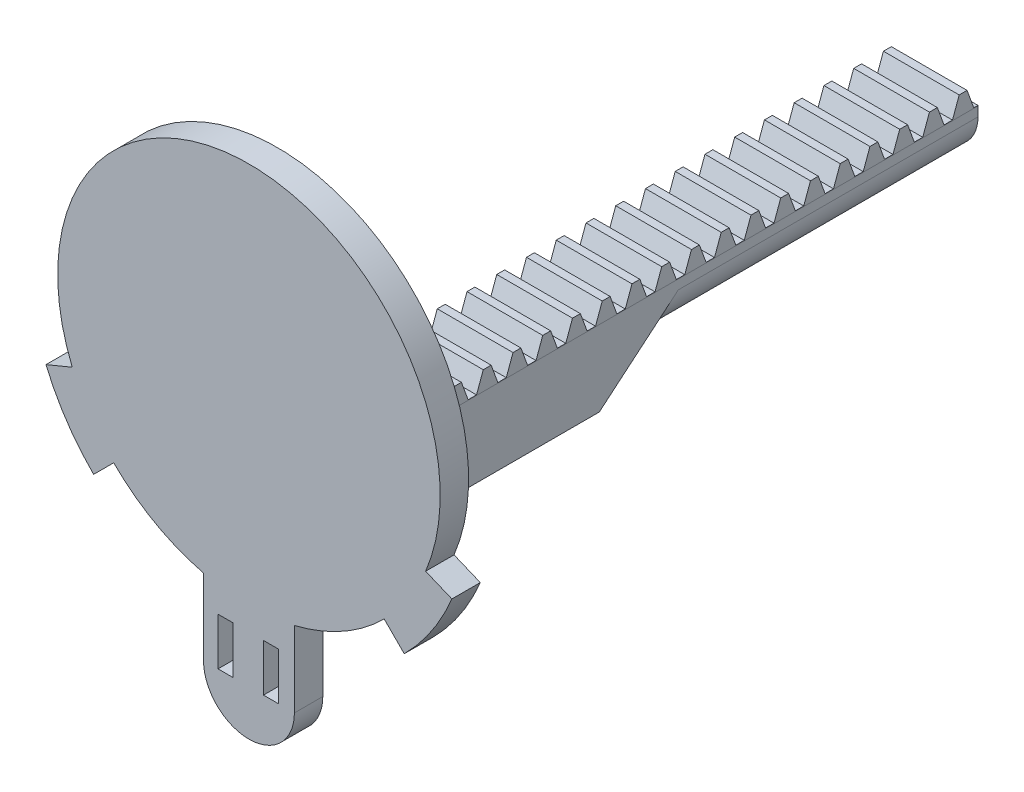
ISO-10303-21;
HEADER;
FILE_DESCRIPTION(('STEP AP214'),'2;1');
FILE_NAME('part.step','',(''),(''),'','','');
FILE_SCHEMA(('AUTOMOTIVE_DESIGN { 1 0 10303 214 1 1 1 1 }'));
ENDSEC;
DATA;
#1=APPLICATION_CONTEXT('core data for automotive mechanical design processes');
#2=APPLICATION_PROTOCOL_DEFINITION('international standard','automotive_design',2000,#1);
#3=PRODUCT_CONTEXT('',#1,'mechanical');
#4=PRODUCT('Part','Part','',(#3));
#5=PRODUCT_RELATED_PRODUCT_CATEGORY('part','',(#4));
#6=PRODUCT_DEFINITION_FORMATION('','',#4);
#7=PRODUCT_DEFINITION_CONTEXT('part definition',#1,'design');
#8=PRODUCT_DEFINITION('design','',#6,#7);
#9=PRODUCT_DEFINITION_SHAPE('','',#8);
#10=(LENGTH_UNIT() NAMED_UNIT(*) SI_UNIT(.MILLI.,.METRE.));
#11=(NAMED_UNIT(*) PLANE_ANGLE_UNIT() SI_UNIT($,.RADIAN.));
#12=(NAMED_UNIT(*) SI_UNIT($,.STERADIAN.) SOLID_ANGLE_UNIT());
#13=UNCERTAINTY_MEASURE_WITH_UNIT(LENGTH_MEASURE(1.E-05),#10,'distance_accuracy_value','');
#14=(GEOMETRIC_REPRESENTATION_CONTEXT(3) GLOBAL_UNCERTAINTY_ASSIGNED_CONTEXT((#13)) GLOBAL_UNIT_ASSIGNED_CONTEXT((#10,
#11,#12)) REPRESENTATION_CONTEXT('',''));
#15=CARTESIAN_POINT('',(0.,0.,0.));
#16=DIRECTION('',(0.,0.,1.));
#17=DIRECTION('',(1.,0.,0.));
#18=AXIS2_PLACEMENT_3D('',#15,#16,#17);
#19=CARTESIAN_POINT('',(4.,-7.00000052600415,-70.));
#20=DIRECTION('',(0.,1.,0.));
#21=DIRECTION('',(-1.,0.,0.));
#22=AXIS2_PLACEMENT_3D('',#19,#20,#21);
#23=PLANE('',#22);
#24=DIRECTION('',(-1.,0.,0.));
#25=VECTOR('',#24,1.);
#26=CARTESIAN_POINT('',(4.,-7.00000052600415,-5.17971255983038));
#27=LINE('',#26,#25);
#28=CARTESIAN_POINT('',(4.,-7.00000052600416,-5.17971255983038));
#29=VERTEX_POINT('',#28);
#30=CARTESIAN_POINT('',(-4.,-7.00000052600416,-5.17971255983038));
#31=VERTEX_POINT('',#30);
#32=EDGE_CURVE('E684',#29,#31,#27,.T.);
#33=ORIENTED_EDGE('',*,*,#32,.F.);
#34=DIRECTION('',(0.,0.,-1.));
#35=VECTOR('',#34,1.);
#36=CARTESIAN_POINT('',(4.,-7.00000052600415,-70.));
#37=LINE('',#36,#35);
#38=CARTESIAN_POINT('',(4.,-7.00000052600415,-6.0149887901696));
#39=VERTEX_POINT('',#38);
#40=EDGE_CURVE('E1196',#29,#39,#37,.T.);
#41=ORIENTED_EDGE('',*,*,#40,.T.);
#42=DIRECTION('',(1.,0.,0.));
#43=VECTOR('',#42,1.);
#44=CARTESIAN_POINT('',(4.,-7.00000052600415,-6.01498879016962));
#45=LINE('',#44,#43);
#46=CARTESIAN_POINT('',(-4.,-7.00000052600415,-6.0149887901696));
#47=VERTEX_POINT('',#46);
#48=EDGE_CURVE('E704',#47,#39,#45,.T.);
#49=ORIENTED_EDGE('',*,*,#48,.F.);
#50=DIRECTION('',(0.,0.,-1.));
#51=VECTOR('',#50,1.);
#52=CARTESIAN_POINT('',(-4.,-7.00000052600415,-70.));
#53=LINE('',#52,#51);
#54=EDGE_CURVE('E1206',#31,#47,#53,.T.);
#55=ORIENTED_EDGE('',*,*,#54,.F.);
#56=EDGE_LOOP('',(#33,#41,#49,#55));
#57=FACE_BOUND('',#56,.T.);
#58=ADVANCED_FACE('F59',(#57),#23,.T.);
#59=DIRECTION('',(-1.,0.,0.));
#60=VECTOR('',#59,1.);
#61=CARTESIAN_POINT('',(4.,-7.00000052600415,-8.32130520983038));
#62=LINE('',#61,#60);
#63=CARTESIAN_POINT('',(4.,-7.00000052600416,-8.32130520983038));
#64=VERTEX_POINT('',#63);
#65=CARTESIAN_POINT('',(-4.,-7.00000052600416,-8.32130520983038));
#66=VERTEX_POINT('',#65);
#67=EDGE_CURVE('E708',#64,#66,#62,.T.);
#68=ORIENTED_EDGE('',*,*,#67,.F.);
#69=CARTESIAN_POINT('',(4.,-7.00000052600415,-9.15658144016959));
#70=VERTEX_POINT('',#69);
#71=EDGE_CURVE('E1440',#64,#70,#37,.T.);
#72=ORIENTED_EDGE('',*,*,#71,.T.);
#73=DIRECTION('',(1.,0.,0.));
#74=VECTOR('',#73,1.);
#75=CARTESIAN_POINT('',(4.,-7.00000052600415,-9.15658144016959));
#76=LINE('',#75,#74);
#77=CARTESIAN_POINT('',(-4.,-7.00000052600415,-9.15658144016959));
#78=VERTEX_POINT('',#77);
#79=EDGE_CURVE('E728',#78,#70,#76,.T.);
#80=ORIENTED_EDGE('',*,*,#79,.F.);
#81=EDGE_CURVE('E1285',#66,#78,#53,.T.);
#82=ORIENTED_EDGE('',*,*,#81,.F.);
#83=EDGE_LOOP('',(#68,#72,#80,#82));
#84=FACE_BOUND('',#83,.T.);
#85=ADVANCED_FACE('F1458',(#84),#23,.T.);
#86=DIRECTION('',(-1.,0.,0.));
#87=VECTOR('',#86,1.);
#88=CARTESIAN_POINT('',(4.,-7.00000052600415,-11.4628978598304));
#89=LINE('',#88,#87);
#90=CARTESIAN_POINT('',(4.,-7.00000052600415,-11.4628978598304));
#91=VERTEX_POINT('',#90);
#92=CARTESIAN_POINT('',(-4.,-7.00000052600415,-11.4628978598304));
#93=VERTEX_POINT('',#92);
#94=EDGE_CURVE('E732',#91,#93,#89,.T.);
#95=ORIENTED_EDGE('',*,*,#94,.F.);
#96=CARTESIAN_POINT('',(4.,-7.00000052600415,-12.2981740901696));
#97=VERTEX_POINT('',#96);
#98=EDGE_CURVE('E1435',#91,#97,#37,.T.);
#99=ORIENTED_EDGE('',*,*,#98,.T.);
#100=DIRECTION('',(1.,0.,0.));
#101=VECTOR('',#100,1.);
#102=CARTESIAN_POINT('',(4.,-7.00000052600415,-12.2981740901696));
#103=LINE('',#102,#101);
#104=CARTESIAN_POINT('',(-4.,-7.00000052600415,-12.2981740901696));
#105=VERTEX_POINT('',#104);
#106=EDGE_CURVE('E752',#105,#97,#103,.T.);
#107=ORIENTED_EDGE('',*,*,#106,.F.);
#108=EDGE_CURVE('E1286',#93,#105,#53,.T.);
#109=ORIENTED_EDGE('',*,*,#108,.F.);
#110=EDGE_LOOP('',(#95,#99,#107,#109));
#111=FACE_BOUND('',#110,.T.);
#112=ADVANCED_FACE('F1468',(#111),#23,.T.);
#113=DIRECTION('',(-1.,0.,0.));
#114=VECTOR('',#113,1.);
#115=CARTESIAN_POINT('',(4.,-7.00000052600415,-14.6044905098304));
#116=LINE('',#115,#114);
#117=CARTESIAN_POINT('',(4.,-7.00000052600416,-14.6044905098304));
#118=VERTEX_POINT('',#117);
#119=CARTESIAN_POINT('',(-4.,-7.00000052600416,-14.6044905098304));
#120=VERTEX_POINT('',#119);
#121=EDGE_CURVE('E756',#118,#120,#116,.T.);
#122=ORIENTED_EDGE('',*,*,#121,.F.);
#123=CARTESIAN_POINT('',(4.,-7.00000052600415,-15.4397667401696));
#124=VERTEX_POINT('',#123);
#125=EDGE_CURVE('E1430',#118,#124,#37,.T.);
#126=ORIENTED_EDGE('',*,*,#125,.T.);
#127=DIRECTION('',(1.,0.,0.));
#128=VECTOR('',#127,1.);
#129=CARTESIAN_POINT('',(4.,-7.00000052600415,-15.4397667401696));
#130=LINE('',#129,#128);
#131=CARTESIAN_POINT('',(-4.,-7.00000052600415,-15.4397667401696));
#132=VERTEX_POINT('',#131);
#133=EDGE_CURVE('E776',#132,#124,#130,.T.);
#134=ORIENTED_EDGE('',*,*,#133,.F.);
#135=EDGE_CURVE('E1289',#120,#132,#53,.T.);
#136=ORIENTED_EDGE('',*,*,#135,.F.);
#137=EDGE_LOOP('',(#122,#126,#134,#136));
#138=FACE_BOUND('',#137,.T.);
#139=ADVANCED_FACE('F1478',(#138),#23,.T.);
#140=DIRECTION('',(-1.,0.,0.));
#141=VECTOR('',#140,1.);
#142=CARTESIAN_POINT('',(4.,-7.00000052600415,-17.7460831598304));
#143=LINE('',#142,#141);
#144=CARTESIAN_POINT('',(4.,-7.00000052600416,-17.7460831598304));
#145=VERTEX_POINT('',#144);
#146=CARTESIAN_POINT('',(-4.,-7.00000052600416,-17.7460831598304));
#147=VERTEX_POINT('',#146);
#148=EDGE_CURVE('E780',#145,#147,#143,.T.);
#149=ORIENTED_EDGE('',*,*,#148,.F.);
#150=CARTESIAN_POINT('',(4.,-7.00000052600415,-18.5813593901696));
#151=VERTEX_POINT('',#150);
#152=EDGE_CURVE('E1425',#145,#151,#37,.T.);
#153=ORIENTED_EDGE('',*,*,#152,.T.);
#154=DIRECTION('',(1.,0.,0.));
#155=VECTOR('',#154,1.);
#156=CARTESIAN_POINT('',(4.,-7.00000052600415,-18.5813593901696));
#157=LINE('',#156,#155);
#158=CARTESIAN_POINT('',(-4.,-7.00000052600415,-18.5813593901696));
#159=VERTEX_POINT('',#158);
#160=EDGE_CURVE('E800',#159,#151,#157,.T.);
#161=ORIENTED_EDGE('',*,*,#160,.F.);
#162=EDGE_CURVE('E1292',#147,#159,#53,.T.);
#163=ORIENTED_EDGE('',*,*,#162,.F.);
#164=EDGE_LOOP('',(#149,#153,#161,#163));
#165=FACE_BOUND('',#164,.T.);
#166=ADVANCED_FACE('F1488',(#165),#23,.T.);
#167=DIRECTION('',(-1.,0.,0.));
#168=VECTOR('',#167,1.);
#169=CARTESIAN_POINT('',(4.,-7.00000052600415,-20.8876758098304));
#170=LINE('',#169,#168);
#171=CARTESIAN_POINT('',(4.,-7.00000052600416,-20.8876758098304));
#172=VERTEX_POINT('',#171);
#173=CARTESIAN_POINT('',(-4.,-7.00000052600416,-20.8876758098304));
#174=VERTEX_POINT('',#173);
#175=EDGE_CURVE('E804',#172,#174,#170,.T.);
#176=ORIENTED_EDGE('',*,*,#175,.F.);
#177=CARTESIAN_POINT('',(4.,-7.00000052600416,-21.7229520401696));
#178=VERTEX_POINT('',#177);
#179=EDGE_CURVE('E1420',#172,#178,#37,.T.);
#180=ORIENTED_EDGE('',*,*,#179,.T.);
#181=DIRECTION('',(1.,0.,0.));
#182=VECTOR('',#181,1.);
#183=CARTESIAN_POINT('',(4.,-7.00000052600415,-21.7229520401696));
#184=LINE('',#183,#182);
#185=CARTESIAN_POINT('',(-4.,-7.00000052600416,-21.7229520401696));
#186=VERTEX_POINT('',#185);
#187=EDGE_CURVE('E824',#186,#178,#184,.T.);
#188=ORIENTED_EDGE('',*,*,#187,.F.);
#189=EDGE_CURVE('E1295',#174,#186,#53,.T.);
#190=ORIENTED_EDGE('',*,*,#189,.F.);
#191=EDGE_LOOP('',(#176,#180,#188,#190));
#192=FACE_BOUND('',#191,.T.);
#193=ADVANCED_FACE('F1498',(#192),#23,.T.);
#194=DIRECTION('',(-1.,0.,0.));
#195=VECTOR('',#194,1.);
#196=CARTESIAN_POINT('',(4.,-7.00000052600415,-24.0292684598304));
#197=LINE('',#196,#195);
#198=CARTESIAN_POINT('',(4.,-7.00000052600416,-24.0292684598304));
#199=VERTEX_POINT('',#198);
#200=CARTESIAN_POINT('',(-4.,-7.00000052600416,-24.0292684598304));
#201=VERTEX_POINT('',#200);
#202=EDGE_CURVE('E828',#199,#201,#197,.T.);
#203=ORIENTED_EDGE('',*,*,#202,.F.);
#204=CARTESIAN_POINT('',(4.,-7.00000052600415,-24.8645446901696));
#205=VERTEX_POINT('',#204);
#206=EDGE_CURVE('E1415',#199,#205,#37,.T.);
#207=ORIENTED_EDGE('',*,*,#206,.T.);
#208=DIRECTION('',(1.,0.,0.));
#209=VECTOR('',#208,1.);
#210=CARTESIAN_POINT('',(4.,-7.00000052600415,-24.8645446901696));
#211=LINE('',#210,#209);
#212=CARTESIAN_POINT('',(-4.,-7.00000052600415,-24.8645446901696));
#213=VERTEX_POINT('',#212);
#214=EDGE_CURVE('E848',#213,#205,#211,.T.);
#215=ORIENTED_EDGE('',*,*,#214,.F.);
#216=EDGE_CURVE('E1298',#201,#213,#53,.T.);
#217=ORIENTED_EDGE('',*,*,#216,.F.);
#218=EDGE_LOOP('',(#203,#207,#215,#217));
#219=FACE_BOUND('',#218,.T.);
#220=ADVANCED_FACE('F1508',(#219),#23,.T.);
#221=DIRECTION('',(-1.,0.,0.));
#222=VECTOR('',#221,1.);
#223=CARTESIAN_POINT('',(4.,-7.00000052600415,-27.1708611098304));
#224=LINE('',#223,#222);
#225=CARTESIAN_POINT('',(4.,-7.00000052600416,-27.1708611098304));
#226=VERTEX_POINT('',#225);
#227=CARTESIAN_POINT('',(-4.,-7.00000052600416,-27.1708611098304));
#228=VERTEX_POINT('',#227);
#229=EDGE_CURVE('E852',#226,#228,#224,.T.);
#230=ORIENTED_EDGE('',*,*,#229,.F.);
#231=CARTESIAN_POINT('',(4.,-7.00000052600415,-28.0061373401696));
#232=VERTEX_POINT('',#231);
#233=EDGE_CURVE('E1410',#226,#232,#37,.T.);
#234=ORIENTED_EDGE('',*,*,#233,.T.);
#235=DIRECTION('',(1.,0.,0.));
#236=VECTOR('',#235,1.);
#237=CARTESIAN_POINT('',(4.,-7.00000052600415,-28.0061373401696));
#238=LINE('',#237,#236);
#239=CARTESIAN_POINT('',(-4.,-7.00000052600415,-28.0061373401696));
#240=VERTEX_POINT('',#239);
#241=EDGE_CURVE('E872',#240,#232,#238,.T.);
#242=ORIENTED_EDGE('',*,*,#241,.F.);
#243=EDGE_CURVE('E1301',#228,#240,#53,.T.);
#244=ORIENTED_EDGE('',*,*,#243,.F.);
#245=EDGE_LOOP('',(#230,#234,#242,#244));
#246=FACE_BOUND('',#245,.T.);
#247=ADVANCED_FACE('F1518',(#246),#23,.T.);
#248=DIRECTION('',(-1.,0.,0.));
#249=VECTOR('',#248,1.);
#250=CARTESIAN_POINT('',(4.,-7.00000052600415,-30.3124537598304));
#251=LINE('',#250,#249);
#252=CARTESIAN_POINT('',(4.,-7.00000052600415,-30.3124537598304));
#253=VERTEX_POINT('',#252);
#254=CARTESIAN_POINT('',(-4.,-7.00000052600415,-30.3124537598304));
#255=VERTEX_POINT('',#254);
#256=EDGE_CURVE('E876',#253,#255,#251,.T.);
#257=ORIENTED_EDGE('',*,*,#256,.F.);
#258=CARTESIAN_POINT('',(4.,-7.00000052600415,-31.1477299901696));
#259=VERTEX_POINT('',#258);
#260=EDGE_CURVE('E1405',#253,#259,#37,.T.);
#261=ORIENTED_EDGE('',*,*,#260,.T.);
#262=DIRECTION('',(1.,0.,0.));
#263=VECTOR('',#262,1.);
#264=CARTESIAN_POINT('',(4.,-7.00000052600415,-31.1477299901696));
#265=LINE('',#264,#263);
#266=CARTESIAN_POINT('',(-4.,-7.00000052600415,-31.1477299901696));
#267=VERTEX_POINT('',#266);
#268=EDGE_CURVE('E896',#267,#259,#265,.T.);
#269=ORIENTED_EDGE('',*,*,#268,.F.);
#270=EDGE_CURVE('E1304',#255,#267,#53,.T.);
#271=ORIENTED_EDGE('',*,*,#270,.F.);
#272=EDGE_LOOP('',(#257,#261,#269,#271));
#273=FACE_BOUND('',#272,.T.);
#274=ADVANCED_FACE('F1528',(#273),#23,.T.);
#275=DIRECTION('',(-1.,0.,0.));
#276=VECTOR('',#275,1.);
#277=CARTESIAN_POINT('',(4.,-7.00000052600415,-33.4540464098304));
#278=LINE('',#277,#276);
#279=CARTESIAN_POINT('',(4.,-7.00000052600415,-33.4540464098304));
#280=VERTEX_POINT('',#279);
#281=CARTESIAN_POINT('',(-4.,-7.00000052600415,-33.4540464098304));
#282=VERTEX_POINT('',#281);
#283=EDGE_CURVE('E900',#280,#282,#278,.T.);
#284=ORIENTED_EDGE('',*,*,#283,.F.);
#285=CARTESIAN_POINT('',(4.,-7.00000052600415,-34.2893226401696));
#286=VERTEX_POINT('',#285);
#287=EDGE_CURVE('E1400',#280,#286,#37,.T.);
#288=ORIENTED_EDGE('',*,*,#287,.T.);
#289=DIRECTION('',(1.,0.,0.));
#290=VECTOR('',#289,1.);
#291=CARTESIAN_POINT('',(4.,-7.00000052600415,-34.2893226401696));
#292=LINE('',#291,#290);
#293=CARTESIAN_POINT('',(-4.,-7.00000052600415,-34.2893226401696));
#294=VERTEX_POINT('',#293);
#295=EDGE_CURVE('E920',#294,#286,#292,.T.);
#296=ORIENTED_EDGE('',*,*,#295,.F.);
#297=EDGE_CURVE('E1307',#282,#294,#53,.T.);
#298=ORIENTED_EDGE('',*,*,#297,.F.);
#299=EDGE_LOOP('',(#284,#288,#296,#298));
#300=FACE_BOUND('',#299,.T.);
#301=ADVANCED_FACE('F1538',(#300),#23,.T.);
#302=DIRECTION('',(-1.,0.,0.));
#303=VECTOR('',#302,1.);
#304=CARTESIAN_POINT('',(4.,-7.00000052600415,-36.5956390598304));
#305=LINE('',#304,#303);
#306=CARTESIAN_POINT('',(4.,-7.00000052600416,-36.5956390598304));
#307=VERTEX_POINT('',#306);
#308=CARTESIAN_POINT('',(-4.,-7.00000052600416,-36.5956390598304));
#309=VERTEX_POINT('',#308);
#310=EDGE_CURVE('E924',#307,#309,#305,.T.);
#311=ORIENTED_EDGE('',*,*,#310,.F.);
#312=CARTESIAN_POINT('',(4.,-7.00000052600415,-37.4309152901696));
#313=VERTEX_POINT('',#312);
#314=EDGE_CURVE('E1395',#307,#313,#37,.T.);
#315=ORIENTED_EDGE('',*,*,#314,.T.);
#316=DIRECTION('',(1.,0.,0.));
#317=VECTOR('',#316,1.);
#318=CARTESIAN_POINT('',(4.,-7.00000052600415,-37.4309152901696));
#319=LINE('',#318,#317);
#320=CARTESIAN_POINT('',(-4.,-7.00000052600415,-37.4309152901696));
#321=VERTEX_POINT('',#320);
#322=EDGE_CURVE('E944',#321,#313,#319,.T.);
#323=ORIENTED_EDGE('',*,*,#322,.F.);
#324=EDGE_CURVE('E1310',#309,#321,#53,.T.);
#325=ORIENTED_EDGE('',*,*,#324,.F.);
#326=EDGE_LOOP('',(#311,#315,#323,#325));
#327=FACE_BOUND('',#326,.T.);
#328=ADVANCED_FACE('F1548',(#327),#23,.T.);
#329=DIRECTION('',(-1.,0.,0.));
#330=VECTOR('',#329,1.);
#331=CARTESIAN_POINT('',(4.,-7.00000052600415,-39.7372317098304));
#332=LINE('',#331,#330);
#333=CARTESIAN_POINT('',(4.,-7.00000052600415,-39.7372317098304));
#334=VERTEX_POINT('',#333);
#335=CARTESIAN_POINT('',(-4.,-7.00000052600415,-39.7372317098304));
#336=VERTEX_POINT('',#335);
#337=EDGE_CURVE('E948',#334,#336,#332,.T.);
#338=ORIENTED_EDGE('',*,*,#337,.F.);
#339=CARTESIAN_POINT('',(4.,-7.00000052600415,-40.5725079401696));
#340=VERTEX_POINT('',#339);
#341=EDGE_CURVE('E1390',#334,#340,#37,.T.);
#342=ORIENTED_EDGE('',*,*,#341,.T.);
#343=DIRECTION('',(1.,0.,0.));
#344=VECTOR('',#343,1.);
#345=CARTESIAN_POINT('',(4.,-7.00000052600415,-40.5725079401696));
#346=LINE('',#345,#344);
#347=CARTESIAN_POINT('',(-4.,-7.00000052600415,-40.5725079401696));
#348=VERTEX_POINT('',#347);
#349=EDGE_CURVE('E968',#348,#340,#346,.T.);
#350=ORIENTED_EDGE('',*,*,#349,.F.);
#351=EDGE_CURVE('E1313',#336,#348,#53,.T.);
#352=ORIENTED_EDGE('',*,*,#351,.F.);
#353=EDGE_LOOP('',(#338,#342,#350,#352));
#354=FACE_BOUND('',#353,.T.);
#355=ADVANCED_FACE('F1558',(#354),#23,.T.);
#356=DIRECTION('',(-1.,0.,0.));
#357=VECTOR('',#356,1.);
#358=CARTESIAN_POINT('',(4.,-7.00000052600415,-42.8788243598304));
#359=LINE('',#358,#357);
#360=CARTESIAN_POINT('',(4.,-7.00000052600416,-42.8788243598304));
#361=VERTEX_POINT('',#360);
#362=CARTESIAN_POINT('',(-4.,-7.00000052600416,-42.8788243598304));
#363=VERTEX_POINT('',#362);
#364=EDGE_CURVE('E972',#361,#363,#359,.T.);
#365=ORIENTED_EDGE('',*,*,#364,.F.);
#366=CARTESIAN_POINT('',(4.,-7.00000052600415,-43.7141005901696));
#367=VERTEX_POINT('',#366);
#368=EDGE_CURVE('E1385',#361,#367,#37,.T.);
#369=ORIENTED_EDGE('',*,*,#368,.T.);
#370=DIRECTION('',(1.,0.,0.));
#371=VECTOR('',#370,1.);
#372=CARTESIAN_POINT('',(4.,-7.00000052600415,-43.7141005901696));
#373=LINE('',#372,#371);
#374=CARTESIAN_POINT('',(-4.,-7.00000052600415,-43.7141005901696));
#375=VERTEX_POINT('',#374);
#376=EDGE_CURVE('E992',#375,#367,#373,.T.);
#377=ORIENTED_EDGE('',*,*,#376,.F.);
#378=EDGE_CURVE('E1316',#363,#375,#53,.T.);
#379=ORIENTED_EDGE('',*,*,#378,.F.);
#380=EDGE_LOOP('',(#365,#369,#377,#379));
#381=FACE_BOUND('',#380,.T.);
#382=ADVANCED_FACE('F1568',(#381),#23,.T.);
#383=DIRECTION('',(-1.,0.,0.));
#384=VECTOR('',#383,1.);
#385=CARTESIAN_POINT('',(4.,-7.00000052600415,-46.0204170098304));
#386=LINE('',#385,#384);
#387=CARTESIAN_POINT('',(4.,-7.00000052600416,-46.0204170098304));
#388=VERTEX_POINT('',#387);
#389=CARTESIAN_POINT('',(-4.,-7.00000052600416,-46.0204170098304));
#390=VERTEX_POINT('',#389);
#391=EDGE_CURVE('E996',#388,#390,#386,.T.);
#392=ORIENTED_EDGE('',*,*,#391,.F.);
#393=CARTESIAN_POINT('',(4.,-7.00000052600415,-46.8556932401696));
#394=VERTEX_POINT('',#393);
#395=EDGE_CURVE('E1380',#388,#394,#37,.T.);
#396=ORIENTED_EDGE('',*,*,#395,.T.);
#397=DIRECTION('',(1.,0.,0.));
#398=VECTOR('',#397,1.);
#399=CARTESIAN_POINT('',(4.,-7.00000052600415,-46.8556932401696));
#400=LINE('',#399,#398);
#401=CARTESIAN_POINT('',(-4.,-7.00000052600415,-46.8556932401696));
#402=VERTEX_POINT('',#401);
#403=EDGE_CURVE('E1016',#402,#394,#400,.T.);
#404=ORIENTED_EDGE('',*,*,#403,.F.);
#405=EDGE_CURVE('E1319',#390,#402,#53,.T.);
#406=ORIENTED_EDGE('',*,*,#405,.F.);
#407=EDGE_LOOP('',(#392,#396,#404,#406));
#408=FACE_BOUND('',#407,.T.);
#409=ADVANCED_FACE('F1578',(#408),#23,.T.);
#410=DIRECTION('',(-1.,0.,0.));
#411=VECTOR('',#410,1.);
#412=CARTESIAN_POINT('',(4.,-7.00000052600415,-49.1620096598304));
#413=LINE('',#412,#411);
#414=CARTESIAN_POINT('',(4.,-7.00000052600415,-49.1620096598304));
#415=VERTEX_POINT('',#414);
#416=CARTESIAN_POINT('',(-4.,-7.00000052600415,-49.1620096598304));
#417=VERTEX_POINT('',#416);
#418=EDGE_CURVE('E1020',#415,#417,#413,.T.);
#419=ORIENTED_EDGE('',*,*,#418,.F.);
#420=CARTESIAN_POINT('',(4.,-7.00000052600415,-49.9972858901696));
#421=VERTEX_POINT('',#420);
#422=EDGE_CURVE('E1375',#415,#421,#37,.T.);
#423=ORIENTED_EDGE('',*,*,#422,.T.);
#424=DIRECTION('',(1.,0.,0.));
#425=VECTOR('',#424,1.);
#426=CARTESIAN_POINT('',(4.,-7.00000052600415,-49.9972858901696));
#427=LINE('',#426,#425);
#428=CARTESIAN_POINT('',(-4.,-7.00000052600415,-49.9972858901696));
#429=VERTEX_POINT('',#428);
#430=EDGE_CURVE('E1040',#429,#421,#427,.T.);
#431=ORIENTED_EDGE('',*,*,#430,.F.);
#432=EDGE_CURVE('E1322',#417,#429,#53,.T.);
#433=ORIENTED_EDGE('',*,*,#432,.F.);
#434=EDGE_LOOP('',(#419,#423,#431,#433));
#435=FACE_BOUND('',#434,.T.);
#436=ADVANCED_FACE('F1588',(#435),#23,.T.);
#437=DIRECTION('',(-1.,0.,0.));
#438=VECTOR('',#437,1.);
#439=CARTESIAN_POINT('',(4.,-7.00000052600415,-52.3036023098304));
#440=LINE('',#439,#438);
#441=CARTESIAN_POINT('',(4.,-7.00000052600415,-52.3036023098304));
#442=VERTEX_POINT('',#441);
#443=CARTESIAN_POINT('',(-4.,-7.00000052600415,-52.3036023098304));
#444=VERTEX_POINT('',#443);
#445=EDGE_CURVE('E1044',#442,#444,#440,.T.);
#446=ORIENTED_EDGE('',*,*,#445,.F.);
#447=CARTESIAN_POINT('',(4.,-7.00000052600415,-53.1388785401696));
#448=VERTEX_POINT('',#447);
#449=EDGE_CURVE('E1370',#442,#448,#37,.T.);
#450=ORIENTED_EDGE('',*,*,#449,.T.);
#451=DIRECTION('',(1.,0.,0.));
#452=VECTOR('',#451,1.);
#453=CARTESIAN_POINT('',(4.,-7.00000052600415,-53.1388785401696));
#454=LINE('',#453,#452);
#455=CARTESIAN_POINT('',(-4.,-7.00000052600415,-53.1388785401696));
#456=VERTEX_POINT('',#455);
#457=EDGE_CURVE('E1064',#456,#448,#454,.T.);
#458=ORIENTED_EDGE('',*,*,#457,.F.);
#459=EDGE_CURVE('E1325',#444,#456,#53,.T.);
#460=ORIENTED_EDGE('',*,*,#459,.F.);
#461=EDGE_LOOP('',(#446,#450,#458,#460));
#462=FACE_BOUND('',#461,.T.);
#463=ADVANCED_FACE('F1598',(#462),#23,.T.);
#464=DIRECTION('',(-1.,0.,0.));
#465=VECTOR('',#464,1.);
#466=CARTESIAN_POINT('',(4.,-7.00000052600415,-55.4451949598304));
#467=LINE('',#466,#465);
#468=CARTESIAN_POINT('',(4.,-7.00000052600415,-55.4451949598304));
#469=VERTEX_POINT('',#468);
#470=CARTESIAN_POINT('',(-4.,-7.00000052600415,-55.4451949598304));
#471=VERTEX_POINT('',#470);
#472=EDGE_CURVE('E1068',#469,#471,#467,.T.);
#473=ORIENTED_EDGE('',*,*,#472,.F.);
#474=CARTESIAN_POINT('',(4.,-7.00000052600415,-56.2804711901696));
#475=VERTEX_POINT('',#474);
#476=EDGE_CURVE('E1365',#469,#475,#37,.T.);
#477=ORIENTED_EDGE('',*,*,#476,.T.);
#478=DIRECTION('',(1.,0.,0.));
#479=VECTOR('',#478,1.);
#480=CARTESIAN_POINT('',(4.,-7.00000052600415,-56.2804711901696));
#481=LINE('',#480,#479);
#482=CARTESIAN_POINT('',(-4.,-7.00000052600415,-56.2804711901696));
#483=VERTEX_POINT('',#482);
#484=EDGE_CURVE('E1088',#483,#475,#481,.T.);
#485=ORIENTED_EDGE('',*,*,#484,.F.);
#486=EDGE_CURVE('E1328',#471,#483,#53,.T.);
#487=ORIENTED_EDGE('',*,*,#486,.F.);
#488=EDGE_LOOP('',(#473,#477,#485,#487));
#489=FACE_BOUND('',#488,.T.);
#490=ADVANCED_FACE('F1608',(#489),#23,.T.);
#491=DIRECTION('',(-1.,0.,0.));
#492=VECTOR('',#491,1.);
#493=CARTESIAN_POINT('',(4.,-7.00000052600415,-58.5867876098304));
#494=LINE('',#493,#492);
#495=CARTESIAN_POINT('',(4.,-7.00000052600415,-58.5867876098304));
#496=VERTEX_POINT('',#495);
#497=CARTESIAN_POINT('',(-4.,-7.00000052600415,-58.5867876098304));
#498=VERTEX_POINT('',#497);
#499=EDGE_CURVE('E1092',#496,#498,#494,.T.);
#500=ORIENTED_EDGE('',*,*,#499,.F.);
#501=CARTESIAN_POINT('',(4.,-7.00000052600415,-59.4220638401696));
#502=VERTEX_POINT('',#501);
#503=EDGE_CURVE('E1360',#496,#502,#37,.T.);
#504=ORIENTED_EDGE('',*,*,#503,.T.);
#505=DIRECTION('',(1.,0.,0.));
#506=VECTOR('',#505,1.);
#507=CARTESIAN_POINT('',(4.,-7.00000052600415,-59.4220638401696));
#508=LINE('',#507,#506);
#509=CARTESIAN_POINT('',(-4.,-7.00000052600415,-59.4220638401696));
#510=VERTEX_POINT('',#509);
#511=EDGE_CURVE('E1112',#510,#502,#508,.T.);
#512=ORIENTED_EDGE('',*,*,#511,.F.);
#513=EDGE_CURVE('E1331',#498,#510,#53,.T.);
#514=ORIENTED_EDGE('',*,*,#513,.F.);
#515=EDGE_LOOP('',(#500,#504,#512,#514));
#516=FACE_BOUND('',#515,.T.);
#517=ADVANCED_FACE('F1618',(#516),#23,.T.);
#518=DIRECTION('',(-1.,0.,0.));
#519=VECTOR('',#518,1.);
#520=CARTESIAN_POINT('',(4.,-7.00000052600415,-61.7283802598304));
#521=LINE('',#520,#519);
#522=CARTESIAN_POINT('',(4.,-7.00000052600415,-61.7283802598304));
#523=VERTEX_POINT('',#522);
#524=CARTESIAN_POINT('',(-4.,-7.00000052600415,-61.7283802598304));
#525=VERTEX_POINT('',#524);
#526=EDGE_CURVE('E1116',#523,#525,#521,.T.);
#527=ORIENTED_EDGE('',*,*,#526,.F.);
#528=CARTESIAN_POINT('',(4.,-7.00000052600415,-62.5636564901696));
#529=VERTEX_POINT('',#528);
#530=EDGE_CURVE('E1355',#523,#529,#37,.T.);
#531=ORIENTED_EDGE('',*,*,#530,.T.);
#532=DIRECTION('',(1.,0.,0.));
#533=VECTOR('',#532,1.);
#534=CARTESIAN_POINT('',(4.,-7.00000052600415,-62.5636564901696));
#535=LINE('',#534,#533);
#536=CARTESIAN_POINT('',(-4.,-7.00000052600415,-62.5636564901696));
#537=VERTEX_POINT('',#536);
#538=EDGE_CURVE('E1136',#537,#529,#535,.T.);
#539=ORIENTED_EDGE('',*,*,#538,.F.);
#540=EDGE_CURVE('E1334',#525,#537,#53,.T.);
#541=ORIENTED_EDGE('',*,*,#540,.F.);
#542=EDGE_LOOP('',(#527,#531,#539,#541));
#543=FACE_BOUND('',#542,.T.);
#544=ADVANCED_FACE('F1628',(#543),#23,.T.);
#545=DIRECTION('',(-1.,0.,0.));
#546=VECTOR('',#545,1.);
#547=CARTESIAN_POINT('',(4.,-7.00000052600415,-64.8699729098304));
#548=LINE('',#547,#546);
#549=CARTESIAN_POINT('',(4.,-7.00000052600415,-64.8699729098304));
#550=VERTEX_POINT('',#549);
#551=CARTESIAN_POINT('',(-4.,-7.00000052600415,-64.8699729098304));
#552=VERTEX_POINT('',#551);
#553=EDGE_CURVE('E1140',#550,#552,#548,.T.);
#554=ORIENTED_EDGE('',*,*,#553,.F.);
#555=CARTESIAN_POINT('',(4.,-7.00000052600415,-65.7052491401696));
#556=VERTEX_POINT('',#555);
#557=EDGE_CURVE('E1354',#550,#556,#37,.T.);
#558=ORIENTED_EDGE('',*,*,#557,.T.);
#559=DIRECTION('',(1.,0.,0.));
#560=VECTOR('',#559,1.);
#561=CARTESIAN_POINT('',(4.,-7.00000052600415,-65.7052491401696));
#562=LINE('',#561,#560);
#563=CARTESIAN_POINT('',(-4.,-7.00000052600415,-65.7052491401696));
#564=VERTEX_POINT('',#563);
#565=EDGE_CURVE('E1160',#564,#556,#562,.T.);
#566=ORIENTED_EDGE('',*,*,#565,.F.);
#567=EDGE_CURVE('E1337',#552,#564,#53,.T.);
#568=ORIENTED_EDGE('',*,*,#567,.F.);
#569=EDGE_LOOP('',(#554,#558,#566,#568));
#570=FACE_BOUND('',#569,.T.);
#571=ADVANCED_FACE('F1638',(#570),#23,.T.);
#572=DIRECTION('',(-1.,0.,0.));
#573=VECTOR('',#572,1.);
#574=CARTESIAN_POINT('',(4.,-7.00000052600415,-68.0115655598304));
#575=LINE('',#574,#573);
#576=CARTESIAN_POINT('',(4.,-7.00000052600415,-68.0115655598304));
#577=VERTEX_POINT('',#576);
#578=CARTESIAN_POINT('',(-4.,-7.00000052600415,-68.0115655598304));
#579=VERTEX_POINT('',#578);
#580=EDGE_CURVE('E1164',#577,#579,#575,.T.);
#581=ORIENTED_EDGE('',*,*,#580,.F.);
#582=CARTESIAN_POINT('',(4.,-7.00000052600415,-68.8468417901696));
#583=VERTEX_POINT('',#582);
#584=EDGE_CURVE('E1193',#577,#583,#37,.T.);
#585=ORIENTED_EDGE('',*,*,#584,.T.);
#586=DIRECTION('',(1.,0.,0.));
#587=VECTOR('',#586,1.);
#588=CARTESIAN_POINT('',(4.,-7.00000052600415,-68.8468417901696));
#589=LINE('',#588,#587);
#590=CARTESIAN_POINT('',(-4.,-7.00000052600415,-68.8468417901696));
#591=VERTEX_POINT('',#590);
#592=EDGE_CURVE('E1180',#591,#583,#589,.T.);
#593=ORIENTED_EDGE('',*,*,#592,.F.);
#594=EDGE_CURVE('E1204',#579,#591,#53,.T.);
#595=ORIENTED_EDGE('',*,*,#594,.F.);
#596=EDGE_LOOP('',(#581,#585,#593,#595));
#597=FACE_BOUND('',#596,.T.);
#598=ADVANCED_FACE('F1352',(#597),#23,.T.);
#599=CARTESIAN_POINT('',(4.,-9.00000052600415,-70.));
#600=DIRECTION('',(0.,0.,-1.));
#601=DIRECTION('',(-1.,0.,0.));
#602=AXIS2_PLACEMENT_3D('',#599,#600,#601);
#603=PLANE('',#602);
#604=DIRECTION('',(-1.,0.,0.));
#605=VECTOR('',#604,1.);
#606=CARTESIAN_POINT('',(4.,-8.94720052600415,-70.));
#607=LINE('',#606,#605);
#608=CARTESIAN_POINT('',(4.,-8.94720052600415,-70.));
#609=VERTEX_POINT('',#608);
#610=CARTESIAN_POINT('',(-4.,-8.94720052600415,-70.));
#611=VERTEX_POINT('',#610);
#612=EDGE_CURVE('E1178',#609,#611,#607,.T.);
#613=ORIENTED_EDGE('',*,*,#612,.F.);
#614=DIRECTION('',(0.,-1.,0.));
#615=VECTOR('',#614,1.);
#616=CARTESIAN_POINT('',(4.,-9.00000052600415,-70.));
#617=LINE('',#616,#615);
#618=CARTESIAN_POINT('',(4.,-9.00000052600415,-70.));
#619=VERTEX_POINT('',#618);
#620=EDGE_CURVE('E1184',#609,#619,#617,.T.);
#621=ORIENTED_EDGE('',*,*,#620,.T.);
#622=DIRECTION('',(-1.,0.,0.));
#623=VECTOR('',#622,1.);
#624=CARTESIAN_POINT('',(4.,-9.00000052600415,-70.));
#625=LINE('',#624,#623);
#626=CARTESIAN_POINT('',(-4.,-9.00000052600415,-70.));
#627=VERTEX_POINT('',#626);
#628=EDGE_CURVE('E1195',#619,#627,#625,.T.);
#629=ORIENTED_EDGE('',*,*,#628,.T.);
#630=DIRECTION('',(0.,-1.,0.));
#631=VECTOR('',#630,1.);
#632=CARTESIAN_POINT('',(-4.,-9.00000052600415,-70.));
#633=LINE('',#632,#631);
#634=EDGE_CURVE('E1183',#611,#627,#633,.T.);
#635=ORIENTED_EDGE('',*,*,#634,.F.);
#636=EDGE_LOOP('',(#613,#621,#629,#635));
#637=FACE_BOUND('',#636,.T.);
#638=ADVANCED_FACE('F61',(#637),#603,.T.);
#639=DIRECTION('',(-1.,0.,0.));
#640=VECTOR('',#639,1.);
#641=CARTESIAN_POINT('',(4.,-7.00000052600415,-2.03811990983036));
#642=LINE('',#641,#640);
#643=CARTESIAN_POINT('',(4.,-7.00000052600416,-2.03811990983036));
#644=VERTEX_POINT('',#643);
#645=CARTESIAN_POINT('',(-4.,-7.00000052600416,-2.03811990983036));
#646=VERTEX_POINT('',#645);
#647=EDGE_CURVE('E663',#644,#646,#642,.T.);
#648=ORIENTED_EDGE('',*,*,#647,.F.);
#649=CARTESIAN_POINT('',(4.,-7.00000052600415,-2.8733961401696));
#650=VERTEX_POINT('',#649);
#651=EDGE_CURVE('E652',#644,#650,#37,.T.);
#652=ORIENTED_EDGE('',*,*,#651,.T.);
#653=DIRECTION('',(1.,0.,0.));
#654=VECTOR('',#653,1.);
#655=CARTESIAN_POINT('',(4.,-7.00000052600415,-2.8733961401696));
#656=LINE('',#655,#654);
#657=CARTESIAN_POINT('',(-4.,-7.00000052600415,-2.8733961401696));
#658=VERTEX_POINT('',#657);
#659=EDGE_CURVE('E680',#658,#650,#656,.T.);
#660=ORIENTED_EDGE('',*,*,#659,.F.);
#661=EDGE_CURVE('E1187',#646,#658,#53,.T.);
#662=ORIENTED_EDGE('',*,*,#661,.F.);
#663=EDGE_LOOP('',(#648,#652,#660,#662));
#664=FACE_BOUND('',#663,.T.);
#665=ADVANCED_FACE('F1661',(#664),#23,.T.);
#666=CARTESIAN_POINT('',(4.,-9.00000052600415,0.));
#667=DIRECTION('',(0.,0.,1.));
#668=DIRECTION('',(1.,0.,0.));
#669=AXIS2_PLACEMENT_3D('',#666,#667,#668);
#670=PLANE('',#669);
#671=DIRECTION('',(1.,0.,0.));
#672=VECTOR('',#671,1.);
#673=CARTESIAN_POINT('',(4.,-7.73686438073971,0.));
#674=LINE('',#673,#672);
#675=CARTESIAN_POINT('',(-4.,-7.73686438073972,0.));
#676=VERTEX_POINT('',#675);
#677=CARTESIAN_POINT('',(4.,-7.73686438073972,0.));
#678=VERTEX_POINT('',#677);
#679=EDGE_CURVE('E660',#676,#678,#674,.T.);
#680=ORIENTED_EDGE('',*,*,#679,.F.);
#681=DIRECTION('',(0.,1.,0.));
#682=VECTOR('',#681,1.);
#683=CARTESIAN_POINT('',(-4.,-9.00000052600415,0.));
#684=LINE('',#683,#682);
#685=CARTESIAN_POINT('',(-4.,-9.00000052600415,0.));
#686=VERTEX_POINT('',#685);
#687=EDGE_CURVE('E1201',#686,#676,#684,.T.);
#688=ORIENTED_EDGE('',*,*,#687,.F.);
#689=DIRECTION('',(-1.,0.,0.));
#690=VECTOR('',#689,1.);
#691=CARTESIAN_POINT('',(4.,-9.00000052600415,0.));
#692=LINE('',#691,#690);
#693=CARTESIAN_POINT('',(4.,-9.00000052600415,0.));
#694=VERTEX_POINT('',#693);
#695=EDGE_CURVE('E1207',#694,#686,#692,.T.);
#696=ORIENTED_EDGE('',*,*,#695,.F.);
#697=DIRECTION('',(0.,1.,0.));
#698=VECTOR('',#697,1.);
#699=CARTESIAN_POINT('',(4.,-9.00000052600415,0.));
#700=LINE('',#699,#698);
#701=EDGE_CURVE('E1190',#694,#678,#700,.T.);
#702=ORIENTED_EDGE('',*,*,#701,.T.);
#703=EDGE_LOOP('',(#680,#688,#696,#702));
#704=FACE_BOUND('',#703,.T.);
#705=ADVANCED_FACE('F1668',(#704),#670,.T.);
#706=CARTESIAN_POINT('',(4.,-9.00000052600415,-70.));
#707=DIRECTION('',(0.,-1.,0.));
#708=DIRECTION('',(1.,0.,0.));
#709=AXIS2_PLACEMENT_3D('',#706,#707,#708);
#710=PLANE('',#709);
#711=DIRECTION('',(0.,0.,1.));
#712=VECTOR('',#711,1.);
#713=CARTESIAN_POINT('',(-4.,-9.00000052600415,-70.));
#714=LINE('',#713,#712);
#715=EDGE_CURVE('E1198',#627,#686,#714,.T.);
#716=ORIENTED_EDGE('',*,*,#715,.F.);
#717=ORIENTED_EDGE('',*,*,#628,.F.);
#718=DIRECTION('',(0.,0.,1.));
#719=VECTOR('',#718,1.);
#720=CARTESIAN_POINT('',(4.,-9.00000052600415,-70.));
#721=LINE('',#720,#719);
#722=EDGE_CURVE('E1186',#619,#694,#721,.T.);
#723=ORIENTED_EDGE('',*,*,#722,.T.);
#724=ORIENTED_EDGE('',*,*,#695,.T.);
#725=EDGE_LOOP('',(#716,#717,#723,#724));
#726=FACE_BOUND('',#725,.T.);
#727=ADVANCED_FACE('F1674',(#726),#710,.T.);
#728=CARTESIAN_POINT('',(4.,-7.00000052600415,-70.));
#729=DIRECTION('',(1.,0.,0.));
#730=DIRECTION('',(0.,0.,-1.));
#731=AXIS2_PLACEMENT_3D('',#728,#729,#730);
#732=PLANE('',#731);
#733=DIRECTION('',(0.,-0.93969262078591,0.342020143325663));
#734=VECTOR('',#733,1.);
#735=CARTESIAN_POINT('',(4.,-6.67180052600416,-2.15757494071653));
#736=LINE('',#735,#734);
#737=CARTESIAN_POINT('',(4.,-8.94720052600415,-1.32939706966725));
#738=VERTEX_POINT('',#737);
#739=EDGE_CURVE('E636',#644,#738,#736,.T.);
#740=ORIENTED_EDGE('',*,*,#739,.T.);
#741=DIRECTION('',(0.,0.,1.));
#742=VECTOR('',#741,1.);
#743=CARTESIAN_POINT('',(4.,-8.94720052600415,-0.44052633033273));
#744=LINE('',#743,#742);
#745=CARTESIAN_POINT('',(4.,-8.94720052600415,-0.44052633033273));
#746=VERTEX_POINT('',#745);
#747=EDGE_CURVE('E643',#738,#746,#744,.T.);
#748=ORIENTED_EDGE('',*,*,#747,.T.);
#749=DIRECTION('',(0.,0.93969262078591,0.342020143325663));
#750=VECTOR('',#749,1.);
#751=CARTESIAN_POINT('',(4.,-6.67180052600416,0.387651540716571));
#752=LINE('',#751,#750);
#753=EDGE_CURVE('E640',#746,#678,#752,.T.);
#754=ORIENTED_EDGE('',*,*,#753,.T.);
#755=ORIENTED_EDGE('',*,*,#701,.F.);
#756=ORIENTED_EDGE('',*,*,#722,.F.);
#757=ORIENTED_EDGE('',*,*,#620,.F.);
#758=DIRECTION('',(0.,0.,1.));
#759=VECTOR('',#758,1.);
#760=CARTESIAN_POINT('',(4.,-8.94720052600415,-69.5555646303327));
#761=LINE('',#760,#759);
#762=CARTESIAN_POINT('',(4.,-8.94720052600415,-69.5555646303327));
#763=VERTEX_POINT('',#762);
#764=EDGE_CURVE('E1167',#609,#763,#761,.T.);
#765=ORIENTED_EDGE('',*,*,#764,.T.);
#766=DIRECTION('',(0.,0.93969262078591,0.342020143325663));
#767=VECTOR('',#766,1.);
#768=CARTESIAN_POINT('',(4.,-6.67180052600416,-68.7273867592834));
#769=LINE('',#768,#767);
#770=EDGE_CURVE('E1170',#763,#583,#769,.T.);
#771=ORIENTED_EDGE('',*,*,#770,.T.);
#772=ORIENTED_EDGE('',*,*,#584,.F.);
#773=DIRECTION('',(0.,-0.93969262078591,0.342020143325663));
#774=VECTOR('',#773,1.);
#775=CARTESIAN_POINT('',(4.,-6.67180052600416,-68.1310205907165));
#776=LINE('',#775,#774);
#777=CARTESIAN_POINT('',(4.,-8.94720052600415,-67.3028427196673));
#778=VERTEX_POINT('',#777);
#779=EDGE_CURVE('E1143',#577,#778,#776,.T.);
#780=ORIENTED_EDGE('',*,*,#779,.T.);
#781=DIRECTION('',(0.,0.,1.));
#782=VECTOR('',#781,1.);
#783=CARTESIAN_POINT('',(4.,-8.94720052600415,-66.4139719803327));
#784=LINE('',#783,#782);
#785=CARTESIAN_POINT('',(4.,-8.94720052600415,-66.4139719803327));
#786=VERTEX_POINT('',#785);
#787=EDGE_CURVE('E1146',#778,#786,#784,.T.);
#788=ORIENTED_EDGE('',*,*,#787,.T.);
#789=DIRECTION('',(0.,0.93969262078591,0.342020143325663));
#790=VECTOR('',#789,1.);
#791=CARTESIAN_POINT('',(4.,-6.67180052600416,-65.5857941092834));
#792=LINE('',#791,#790);
#793=EDGE_CURVE('E1150',#786,#556,#792,.T.);
#794=ORIENTED_EDGE('',*,*,#793,.T.);
#795=ORIENTED_EDGE('',*,*,#557,.F.);
#796=DIRECTION('',(0.,-0.93969262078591,0.342020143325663));
#797=VECTOR('',#796,1.);
#798=CARTESIAN_POINT('',(4.,-6.67180052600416,-64.9894279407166));
#799=LINE('',#798,#797);
#800=CARTESIAN_POINT('',(4.,-8.94720052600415,-64.1612500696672));
#801=VERTEX_POINT('',#800);
#802=EDGE_CURVE('E1119',#550,#801,#799,.T.);
#803=ORIENTED_EDGE('',*,*,#802,.T.);
#804=DIRECTION('',(0.,0.,1.));
#805=VECTOR('',#804,1.);
#806=CARTESIAN_POINT('',(4.,-8.94720052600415,-63.2723793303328));
#807=LINE('',#806,#805);
#808=CARTESIAN_POINT('',(4.,-8.94720052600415,-63.2723793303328));
#809=VERTEX_POINT('',#808);
#810=EDGE_CURVE('E1122',#801,#809,#807,.T.);
#811=ORIENTED_EDGE('',*,*,#810,.T.);
#812=DIRECTION('',(0.,0.93969262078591,0.342020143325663));
#813=VECTOR('',#812,1.);
#814=CARTESIAN_POINT('',(4.,-6.67180052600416,-62.4442014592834));
#815=LINE('',#814,#813);
#816=EDGE_CURVE('E1126',#809,#529,#815,.T.);
#817=ORIENTED_EDGE('',*,*,#816,.T.);
#818=ORIENTED_EDGE('',*,*,#530,.F.);
#819=DIRECTION('',(0.,-0.93969262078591,0.342020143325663));
#820=VECTOR('',#819,1.);
#821=CARTESIAN_POINT('',(4.,-6.67180052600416,-61.8478352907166));
#822=LINE('',#821,#820);
#823=CARTESIAN_POINT('',(4.,-8.94720052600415,-61.0196574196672));
#824=VERTEX_POINT('',#823);
#825=EDGE_CURVE('E1095',#523,#824,#822,.T.);
#826=ORIENTED_EDGE('',*,*,#825,.T.);
#827=DIRECTION('',(0.,0.,1.));
#828=VECTOR('',#827,1.);
#829=CARTESIAN_POINT('',(4.,-8.94720052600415,-60.1307866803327));
#830=LINE('',#829,#828);
#831=CARTESIAN_POINT('',(4.,-8.94720052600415,-60.1307866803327));
#832=VERTEX_POINT('',#831);
#833=EDGE_CURVE('E1098',#824,#832,#830,.T.);
#834=ORIENTED_EDGE('',*,*,#833,.T.);
#835=DIRECTION('',(0.,0.93969262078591,0.342020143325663));
#836=VECTOR('',#835,1.);
#837=CARTESIAN_POINT('',(4.,-6.67180052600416,-59.3026088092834));
#838=LINE('',#837,#836);
#839=EDGE_CURVE('E1102',#832,#502,#838,.T.);
#840=ORIENTED_EDGE('',*,*,#839,.T.);
#841=ORIENTED_EDGE('',*,*,#503,.F.);
#842=DIRECTION('',(0.,-0.93969262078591,0.342020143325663));
#843=VECTOR('',#842,1.);
#844=CARTESIAN_POINT('',(4.,-6.67180052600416,-58.7062426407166));
#845=LINE('',#844,#843);
#846=CARTESIAN_POINT('',(4.,-8.94720052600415,-57.8780647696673));
#847=VERTEX_POINT('',#846);
#848=EDGE_CURVE('E1071',#496,#847,#845,.T.);
#849=ORIENTED_EDGE('',*,*,#848,.T.);
#850=DIRECTION('',(0.,0.,1.));
#851=VECTOR('',#850,1.);
#852=CARTESIAN_POINT('',(4.,-8.94720052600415,-56.9891940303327));
#853=LINE('',#852,#851);
#854=CARTESIAN_POINT('',(4.,-8.94720052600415,-56.9891940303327));
#855=VERTEX_POINT('',#854);
#856=EDGE_CURVE('E1074',#847,#855,#853,.T.);
#857=ORIENTED_EDGE('',*,*,#856,.T.);
#858=DIRECTION('',(0.,0.93969262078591,0.342020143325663));
#859=VECTOR('',#858,1.);
#860=CARTESIAN_POINT('',(4.,-6.67180052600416,-56.1610161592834));
#861=LINE('',#860,#859);
#862=EDGE_CURVE('E1078',#855,#475,#861,.T.);
#863=ORIENTED_EDGE('',*,*,#862,.T.);
#864=ORIENTED_EDGE('',*,*,#476,.F.);
#865=DIRECTION('',(0.,-0.93969262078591,0.342020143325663));
#866=VECTOR('',#865,1.);
#867=CARTESIAN_POINT('',(4.,-6.67180052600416,-55.5646499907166));
#868=LINE('',#867,#866);
#869=CARTESIAN_POINT('',(4.,-8.94720052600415,-54.7364721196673));
#870=VERTEX_POINT('',#869);
#871=EDGE_CURVE('E1047',#469,#870,#868,.T.);
#872=ORIENTED_EDGE('',*,*,#871,.T.);
#873=DIRECTION('',(0.,0.,1.));
#874=VECTOR('',#873,1.);
#875=CARTESIAN_POINT('',(4.,-8.94720052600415,-53.8476013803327));
#876=LINE('',#875,#874);
#877=CARTESIAN_POINT('',(4.,-8.94720052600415,-53.8476013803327));
#878=VERTEX_POINT('',#877);
#879=EDGE_CURVE('E1050',#870,#878,#876,.T.);
#880=ORIENTED_EDGE('',*,*,#879,.T.);
#881=DIRECTION('',(0.,0.93969262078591,0.342020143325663));
#882=VECTOR('',#881,1.);
#883=CARTESIAN_POINT('',(4.,-6.67180052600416,-53.0194235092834));
#884=LINE('',#883,#882);
#885=EDGE_CURVE('E1054',#878,#448,#884,.T.);
#886=ORIENTED_EDGE('',*,*,#885,.T.);
#887=ORIENTED_EDGE('',*,*,#449,.F.);
#888=DIRECTION('',(0.,-0.93969262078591,0.342020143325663));
#889=VECTOR('',#888,1.);
#890=CARTESIAN_POINT('',(4.,-6.67180052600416,-52.4230573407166));
#891=LINE('',#890,#889);
#892=CARTESIAN_POINT('',(4.,-8.94720052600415,-51.5948794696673));
#893=VERTEX_POINT('',#892);
#894=EDGE_CURVE('E1023',#442,#893,#891,.T.);
#895=ORIENTED_EDGE('',*,*,#894,.T.);
#896=DIRECTION('',(0.,0.,1.));
#897=VECTOR('',#896,1.);
#898=CARTESIAN_POINT('',(4.,-8.94720052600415,-50.7060087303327));
#899=LINE('',#898,#897);
#900=CARTESIAN_POINT('',(4.,-8.94720052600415,-50.7060087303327));
#901=VERTEX_POINT('',#900);
#902=EDGE_CURVE('E1026',#893,#901,#899,.T.);
#903=ORIENTED_EDGE('',*,*,#902,.T.);
#904=DIRECTION('',(0.,0.93969262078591,0.342020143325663));
#905=VECTOR('',#904,1.);
#906=CARTESIAN_POINT('',(4.,-6.67180052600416,-49.8778308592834));
#907=LINE('',#906,#905);
#908=EDGE_CURVE('E1030',#901,#421,#907,.T.);
#909=ORIENTED_EDGE('',*,*,#908,.T.);
#910=ORIENTED_EDGE('',*,*,#422,.F.);
#911=DIRECTION('',(0.,-0.93969262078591,0.342020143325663));
#912=VECTOR('',#911,1.);
#913=CARTESIAN_POINT('',(4.,-6.67180052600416,-49.2814646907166));
#914=LINE('',#913,#912);
#915=CARTESIAN_POINT('',(4.,-8.94720052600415,-48.4532868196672));
#916=VERTEX_POINT('',#915);
#917=EDGE_CURVE('E999',#415,#916,#914,.T.);
#918=ORIENTED_EDGE('',*,*,#917,.T.);
#919=DIRECTION('',(0.,0.,1.));
#920=VECTOR('',#919,1.);
#921=CARTESIAN_POINT('',(4.,-8.94720052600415,-47.5644160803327));
#922=LINE('',#921,#920);
#923=CARTESIAN_POINT('',(4.,-8.94720052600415,-47.5644160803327));
#924=VERTEX_POINT('',#923);
#925=EDGE_CURVE('E1002',#916,#924,#922,.T.);
#926=ORIENTED_EDGE('',*,*,#925,.T.);
#927=DIRECTION('',(0.,0.93969262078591,0.342020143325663));
#928=VECTOR('',#927,1.);
#929=CARTESIAN_POINT('',(4.,-6.67180052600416,-46.7362382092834));
#930=LINE('',#929,#928);
#931=EDGE_CURVE('E1006',#924,#394,#930,.T.);
#932=ORIENTED_EDGE('',*,*,#931,.T.);
#933=ORIENTED_EDGE('',*,*,#395,.F.);
#934=DIRECTION('',(0.,-0.93969262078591,0.342020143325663));
#935=VECTOR('',#934,1.);
#936=CARTESIAN_POINT('',(4.,-6.67180052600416,-46.1398720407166));
#937=LINE('',#936,#935);
#938=CARTESIAN_POINT('',(4.,-8.94720052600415,-45.3116941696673));
#939=VERTEX_POINT('',#938);
#940=EDGE_CURVE('E975',#388,#939,#937,.T.);
#941=ORIENTED_EDGE('',*,*,#940,.T.);
#942=DIRECTION('',(0.,0.,1.));
#943=VECTOR('',#942,1.);
#944=CARTESIAN_POINT('',(4.,-8.94720052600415,-44.4228234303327));
#945=LINE('',#944,#943);
#946=CARTESIAN_POINT('',(4.,-8.94720052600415,-44.4228234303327));
#947=VERTEX_POINT('',#946);
#948=EDGE_CURVE('E978',#939,#947,#945,.T.);
#949=ORIENTED_EDGE('',*,*,#948,.T.);
#950=DIRECTION('',(0.,0.93969262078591,0.342020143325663));
#951=VECTOR('',#950,1.);
#952=CARTESIAN_POINT('',(4.,-6.67180052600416,-43.5946455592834));
#953=LINE('',#952,#951);
#954=EDGE_CURVE('E982',#947,#367,#953,.T.);
#955=ORIENTED_EDGE('',*,*,#954,.T.);
#956=ORIENTED_EDGE('',*,*,#368,.F.);
#957=DIRECTION('',(0.,-0.93969262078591,0.342020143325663));
#958=VECTOR('',#957,1.);
#959=CARTESIAN_POINT('',(4.,-6.67180052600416,-42.9982793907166));
#960=LINE('',#959,#958);
#961=CARTESIAN_POINT('',(4.,-8.94720052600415,-42.1701015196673));
#962=VERTEX_POINT('',#961);
#963=EDGE_CURVE('E951',#361,#962,#960,.T.);
#964=ORIENTED_EDGE('',*,*,#963,.T.);
#965=DIRECTION('',(0.,0.,1.));
#966=VECTOR('',#965,1.);
#967=CARTESIAN_POINT('',(4.,-8.94720052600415,-41.2812307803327));
#968=LINE('',#967,#966);
#969=CARTESIAN_POINT('',(4.,-8.94720052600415,-41.2812307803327));
#970=VERTEX_POINT('',#969);
#971=EDGE_CURVE('E954',#962,#970,#968,.T.);
#972=ORIENTED_EDGE('',*,*,#971,.T.);
#973=DIRECTION('',(0.,0.93969262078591,0.342020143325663));
#974=VECTOR('',#973,1.);
#975=CARTESIAN_POINT('',(4.,-6.67180052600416,-40.4530529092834));
#976=LINE('',#975,#974);
#977=EDGE_CURVE('E958',#970,#340,#976,.T.);
#978=ORIENTED_EDGE('',*,*,#977,.T.);
#979=ORIENTED_EDGE('',*,*,#341,.F.);
#980=DIRECTION('',(0.,-0.93969262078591,0.342020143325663));
#981=VECTOR('',#980,1.);
#982=CARTESIAN_POINT('',(4.,-6.67180052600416,-39.8566867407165));
#983=LINE('',#982,#981);
#984=CARTESIAN_POINT('',(4.,-8.94720052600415,-39.0285088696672));
#985=VERTEX_POINT('',#984);
#986=EDGE_CURVE('E927',#334,#985,#983,.T.);
#987=ORIENTED_EDGE('',*,*,#986,.T.);
#988=DIRECTION('',(0.,0.,1.));
#989=VECTOR('',#988,1.);
#990=CARTESIAN_POINT('',(4.,-8.94720052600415,-38.1396381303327));
#991=LINE('',#990,#989);
#992=CARTESIAN_POINT('',(4.,-8.94720052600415,-38.1396381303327));
#993=VERTEX_POINT('',#992);
#994=EDGE_CURVE('E930',#985,#993,#991,.T.);
#995=ORIENTED_EDGE('',*,*,#994,.T.);
#996=DIRECTION('',(0.,0.93969262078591,0.342020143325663));
#997=VECTOR('',#996,1.);
#998=CARTESIAN_POINT('',(4.,-6.67180052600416,-37.3114602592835));
#999=LINE('',#998,#997);
#1000=EDGE_CURVE('E934',#993,#313,#999,.T.);
#1001=ORIENTED_EDGE('',*,*,#1000,.T.);
#1002=ORIENTED_EDGE('',*,*,#314,.F.);
#1003=DIRECTION('',(0.,-0.93969262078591,0.342020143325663));
#1004=VECTOR('',#1003,1.);
#1005=CARTESIAN_POINT('',(4.,-6.67180052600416,-36.7150940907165));
#1006=LINE('',#1005,#1004);
#1007=CARTESIAN_POINT('',(4.,-8.94720052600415,-35.8869162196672));
#1008=VERTEX_POINT('',#1007);
#1009=EDGE_CURVE('E903',#307,#1008,#1006,.T.);
#1010=ORIENTED_EDGE('',*,*,#1009,.T.);
#1011=DIRECTION('',(0.,0.,1.));
#1012=VECTOR('',#1011,1.);
#1013=CARTESIAN_POINT('',(4.,-8.94720052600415,-34.9980454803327));
#1014=LINE('',#1013,#1012);
#1015=CARTESIAN_POINT('',(4.,-8.94720052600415,-34.9980454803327));
#1016=VERTEX_POINT('',#1015);
#1017=EDGE_CURVE('E906',#1008,#1016,#1014,.T.);
#1018=ORIENTED_EDGE('',*,*,#1017,.T.);
#1019=DIRECTION('',(0.,0.93969262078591,0.342020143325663));
#1020=VECTOR('',#1019,1.);
#1021=CARTESIAN_POINT('',(4.,-6.67180052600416,-34.1698676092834));
#1022=LINE('',#1021,#1020);
#1023=EDGE_CURVE('E910',#1016,#286,#1022,.T.);
#1024=ORIENTED_EDGE('',*,*,#1023,.T.);
#1025=ORIENTED_EDGE('',*,*,#287,.F.);
#1026=DIRECTION('',(0.,-0.93969262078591,0.342020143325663));
#1027=VECTOR('',#1026,1.);
#1028=CARTESIAN_POINT('',(4.,-6.67180052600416,-33.5735014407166));
#1029=LINE('',#1028,#1027);
#1030=CARTESIAN_POINT('',(4.,-8.94720052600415,-32.7453235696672));
#1031=VERTEX_POINT('',#1030);
#1032=EDGE_CURVE('E879',#280,#1031,#1029,.T.);
#1033=ORIENTED_EDGE('',*,*,#1032,.T.);
#1034=DIRECTION('',(0.,0.,1.));
#1035=VECTOR('',#1034,1.);
#1036=CARTESIAN_POINT('',(4.,-8.94720052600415,-31.8564528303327));
#1037=LINE('',#1036,#1035);
#1038=CARTESIAN_POINT('',(4.,-8.94720052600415,-31.8564528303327));
#1039=VERTEX_POINT('',#1038);
#1040=EDGE_CURVE('E882',#1031,#1039,#1037,.T.);
#1041=ORIENTED_EDGE('',*,*,#1040,.T.);
#1042=DIRECTION('',(0.,0.93969262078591,0.342020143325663));
#1043=VECTOR('',#1042,1.);
#1044=CARTESIAN_POINT('',(4.,-6.67180052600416,-31.0282749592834));
#1045=LINE('',#1044,#1043);
#1046=EDGE_CURVE('E886',#1039,#259,#1045,.T.);
#1047=ORIENTED_EDGE('',*,*,#1046,.T.);
#1048=ORIENTED_EDGE('',*,*,#260,.F.);
#1049=DIRECTION('',(0.,-0.93969262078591,0.342020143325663));
#1050=VECTOR('',#1049,1.);
#1051=CARTESIAN_POINT('',(4.,-6.67180052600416,-30.4319087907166));
#1052=LINE('',#1051,#1050);
#1053=CARTESIAN_POINT('',(4.,-8.94720052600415,-29.6037309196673));
#1054=VERTEX_POINT('',#1053);
#1055=EDGE_CURVE('E855',#253,#1054,#1052,.T.);
#1056=ORIENTED_EDGE('',*,*,#1055,.T.);
#1057=DIRECTION('',(0.,0.,1.));
#1058=VECTOR('',#1057,1.);
#1059=CARTESIAN_POINT('',(4.,-8.94720052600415,-28.7148601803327));
#1060=LINE('',#1059,#1058);
#1061=CARTESIAN_POINT('',(4.,-8.94720052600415,-28.7148601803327));
#1062=VERTEX_POINT('',#1061);
#1063=EDGE_CURVE('E858',#1054,#1062,#1060,.T.);
#1064=ORIENTED_EDGE('',*,*,#1063,.T.);
#1065=DIRECTION('',(0.,0.93969262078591,0.342020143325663));
#1066=VECTOR('',#1065,1.);
#1067=CARTESIAN_POINT('',(4.,-6.67180052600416,-27.8866823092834));
#1068=LINE('',#1067,#1066);
#1069=EDGE_CURVE('E862',#1062,#232,#1068,.T.);
#1070=ORIENTED_EDGE('',*,*,#1069,.T.);
#1071=ORIENTED_EDGE('',*,*,#233,.F.);
#1072=DIRECTION('',(0.,-0.93969262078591,0.342020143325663));
#1073=VECTOR('',#1072,1.);
#1074=CARTESIAN_POINT('',(4.,-6.67180052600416,-27.2903161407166));
#1075=LINE('',#1074,#1073);
#1076=CARTESIAN_POINT('',(4.,-8.94720052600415,-26.4621382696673));
#1077=VERTEX_POINT('',#1076);
#1078=EDGE_CURVE('E831',#226,#1077,#1075,.T.);
#1079=ORIENTED_EDGE('',*,*,#1078,.T.);
#1080=DIRECTION('',(0.,0.,1.));
#1081=VECTOR('',#1080,1.);
#1082=CARTESIAN_POINT('',(4.,-8.94720052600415,-25.5732675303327));
#1083=LINE('',#1082,#1081);
#1084=CARTESIAN_POINT('',(4.,-8.94720052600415,-25.5732675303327));
#1085=VERTEX_POINT('',#1084);
#1086=EDGE_CURVE('E834',#1077,#1085,#1083,.T.);
#1087=ORIENTED_EDGE('',*,*,#1086,.T.);
#1088=DIRECTION('',(0.,0.93969262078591,0.342020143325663));
#1089=VECTOR('',#1088,1.);
#1090=CARTESIAN_POINT('',(4.,-6.67180052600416,-24.7450896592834));
#1091=LINE('',#1090,#1089);
#1092=EDGE_CURVE('E838',#1085,#205,#1091,.T.);
#1093=ORIENTED_EDGE('',*,*,#1092,.T.);
#1094=ORIENTED_EDGE('',*,*,#206,.F.);
#1095=DIRECTION('',(0.,-0.93969262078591,0.342020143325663));
#1096=VECTOR('',#1095,1.);
#1097=CARTESIAN_POINT('',(4.,-6.67180052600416,-24.1487234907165));
#1098=LINE('',#1097,#1096);
#1099=CARTESIAN_POINT('',(4.,-8.94720052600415,-23.3205456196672));
#1100=VERTEX_POINT('',#1099);
#1101=EDGE_CURVE('E807',#199,#1100,#1098,.T.);
#1102=ORIENTED_EDGE('',*,*,#1101,.T.);
#1103=DIRECTION('',(0.,0.,1.));
#1104=VECTOR('',#1103,1.);
#1105=CARTESIAN_POINT('',(4.,-8.94720052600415,-22.4316748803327));
#1106=LINE('',#1105,#1104);
#1107=CARTESIAN_POINT('',(4.,-8.94720052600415,-22.4316748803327));
#1108=VERTEX_POINT('',#1107);
#1109=EDGE_CURVE('E810',#1100,#1108,#1106,.T.);
#1110=ORIENTED_EDGE('',*,*,#1109,.T.);
#1111=DIRECTION('',(0.,0.93969262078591,0.342020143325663));
#1112=VECTOR('',#1111,1.);
#1113=CARTESIAN_POINT('',(4.,-6.67180052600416,-21.6034970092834));
#1114=LINE('',#1113,#1112);
#1115=EDGE_CURVE('E814',#1108,#178,#1114,.T.);
#1116=ORIENTED_EDGE('',*,*,#1115,.T.);
#1117=ORIENTED_EDGE('',*,*,#179,.F.);
#1118=DIRECTION('',(0.,-0.93969262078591,0.342020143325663));
#1119=VECTOR('',#1118,1.);
#1120=CARTESIAN_POINT('',(4.,-6.67180052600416,-21.0071308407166));
#1121=LINE('',#1120,#1119);
#1122=CARTESIAN_POINT('',(4.,-8.94720052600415,-20.1789529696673));
#1123=VERTEX_POINT('',#1122);
#1124=EDGE_CURVE('E783',#172,#1123,#1121,.T.);
#1125=ORIENTED_EDGE('',*,*,#1124,.T.);
#1126=DIRECTION('',(0.,0.,1.));
#1127=VECTOR('',#1126,1.);
#1128=CARTESIAN_POINT('',(4.,-8.94720052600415,-19.2900822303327));
#1129=LINE('',#1128,#1127);
#1130=CARTESIAN_POINT('',(4.,-8.94720052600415,-19.2900822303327));
#1131=VERTEX_POINT('',#1130);
#1132=EDGE_CURVE('E786',#1123,#1131,#1129,.T.);
#1133=ORIENTED_EDGE('',*,*,#1132,.T.);
#1134=DIRECTION('',(0.,0.93969262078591,0.342020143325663));
#1135=VECTOR('',#1134,1.);
#1136=CARTESIAN_POINT('',(4.,-6.67180052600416,-18.4619043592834));
#1137=LINE('',#1136,#1135);
#1138=EDGE_CURVE('E790',#1131,#151,#1137,.T.);
#1139=ORIENTED_EDGE('',*,*,#1138,.T.);
#1140=ORIENTED_EDGE('',*,*,#152,.F.);
#1141=DIRECTION('',(0.,-0.93969262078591,0.342020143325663));
#1142=VECTOR('',#1141,1.);
#1143=CARTESIAN_POINT('',(4.,-6.67180052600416,-17.8655381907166));
#1144=LINE('',#1143,#1142);
#1145=CARTESIAN_POINT('',(4.,-8.94720052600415,-17.0373603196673));
#1146=VERTEX_POINT('',#1145);
#1147=EDGE_CURVE('E759',#145,#1146,#1144,.T.);
#1148=ORIENTED_EDGE('',*,*,#1147,.T.);
#1149=DIRECTION('',(0.,0.,1.));
#1150=VECTOR('',#1149,1.);
#1151=CARTESIAN_POINT('',(4.,-8.94720052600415,-16.1484895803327));
#1152=LINE('',#1151,#1150);
#1153=CARTESIAN_POINT('',(4.,-8.94720052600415,-16.1484895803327));
#1154=VERTEX_POINT('',#1153);
#1155=EDGE_CURVE('E762',#1146,#1154,#1152,.T.);
#1156=ORIENTED_EDGE('',*,*,#1155,.T.);
#1157=DIRECTION('',(0.,0.93969262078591,0.342020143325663));
#1158=VECTOR('',#1157,1.);
#1159=CARTESIAN_POINT('',(4.,-6.67180052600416,-15.3203117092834));
#1160=LINE('',#1159,#1158);
#1161=EDGE_CURVE('E766',#1154,#124,#1160,.T.);
#1162=ORIENTED_EDGE('',*,*,#1161,.T.);
#1163=ORIENTED_EDGE('',*,*,#125,.F.);
#1164=DIRECTION('',(0.,-0.93969262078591,0.342020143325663));
#1165=VECTOR('',#1164,1.);
#1166=CARTESIAN_POINT('',(4.,-6.67180052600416,-14.7239455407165));
#1167=LINE('',#1166,#1165);
#1168=CARTESIAN_POINT('',(4.,-8.94720052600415,-13.8957676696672));
#1169=VERTEX_POINT('',#1168);
#1170=EDGE_CURVE('E735',#118,#1169,#1167,.T.);
#1171=ORIENTED_EDGE('',*,*,#1170,.T.);
#1172=DIRECTION('',(0.,0.,1.));
#1173=VECTOR('',#1172,1.);
#1174=CARTESIAN_POINT('',(4.,-8.94720052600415,-13.0068969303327));
#1175=LINE('',#1174,#1173);
#1176=CARTESIAN_POINT('',(4.,-8.94720052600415,-13.0068969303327));
#1177=VERTEX_POINT('',#1176);
#1178=EDGE_CURVE('E738',#1169,#1177,#1175,.T.);
#1179=ORIENTED_EDGE('',*,*,#1178,.T.);
#1180=DIRECTION('',(0.,0.93969262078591,0.342020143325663));
#1181=VECTOR('',#1180,1.);
#1182=CARTESIAN_POINT('',(4.,-6.67180052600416,-12.1787190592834));
#1183=LINE('',#1182,#1181);
#1184=EDGE_CURVE('E742',#1177,#97,#1183,.T.);
#1185=ORIENTED_EDGE('',*,*,#1184,.T.);
#1186=ORIENTED_EDGE('',*,*,#98,.F.);
#1187=DIRECTION('',(0.,-0.93969262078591,0.342020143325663));
#1188=VECTOR('',#1187,1.);
#1189=CARTESIAN_POINT('',(4.,-6.67180052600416,-11.5823528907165));
#1190=LINE('',#1189,#1188);
#1191=CARTESIAN_POINT('',(4.,-8.94720052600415,-10.7541750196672));
#1192=VERTEX_POINT('',#1191);
#1193=EDGE_CURVE('E711',#91,#1192,#1190,.T.);
#1194=ORIENTED_EDGE('',*,*,#1193,.T.);
#1195=DIRECTION('',(0.,0.,1.));
#1196=VECTOR('',#1195,1.);
#1197=CARTESIAN_POINT('',(4.,-8.94720052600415,-9.86530428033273));
#1198=LINE('',#1197,#1196);
#1199=CARTESIAN_POINT('',(4.,-8.94720052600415,-9.86530428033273));
#1200=VERTEX_POINT('',#1199);
#1201=EDGE_CURVE('E714',#1192,#1200,#1198,.T.);
#1202=ORIENTED_EDGE('',*,*,#1201,.T.);
#1203=DIRECTION('',(0.,0.93969262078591,0.342020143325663));
#1204=VECTOR('',#1203,1.);
#1205=CARTESIAN_POINT('',(4.,-6.67180052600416,-9.03712640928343));
#1206=LINE('',#1205,#1204);
#1207=EDGE_CURVE('E718',#1200,#70,#1206,.T.);
#1208=ORIENTED_EDGE('',*,*,#1207,.T.);
#1209=ORIENTED_EDGE('',*,*,#71,.F.);
#1210=DIRECTION('',(0.,-0.93969262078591,0.342020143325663));
#1211=VECTOR('',#1210,1.);
#1212=CARTESIAN_POINT('',(4.,-6.67180052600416,-8.44076024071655));
#1213=LINE('',#1212,#1211);
#1214=CARTESIAN_POINT('',(4.,-8.94720052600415,-7.61258236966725));
#1215=VERTEX_POINT('',#1214);
#1216=EDGE_CURVE('E687',#64,#1215,#1213,.T.);
#1217=ORIENTED_EDGE('',*,*,#1216,.T.);
#1218=DIRECTION('',(0.,0.,1.));
#1219=VECTOR('',#1218,1.);
#1220=CARTESIAN_POINT('',(4.,-8.94720052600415,-6.72371163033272));
#1221=LINE('',#1220,#1219);
#1222=CARTESIAN_POINT('',(4.,-8.94720052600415,-6.72371163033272));
#1223=VERTEX_POINT('',#1222);
#1224=EDGE_CURVE('E690',#1215,#1223,#1221,.T.);
#1225=ORIENTED_EDGE('',*,*,#1224,.T.);
#1226=DIRECTION('',(0.,0.93969262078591,0.342020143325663));
#1227=VECTOR('',#1226,1.);
#1228=CARTESIAN_POINT('',(4.,-6.67180052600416,-5.89553375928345));
#1229=LINE('',#1228,#1227);
#1230=EDGE_CURVE('E694',#1223,#39,#1229,.T.);
#1231=ORIENTED_EDGE('',*,*,#1230,.T.);
#1232=ORIENTED_EDGE('',*,*,#40,.F.);
#1233=DIRECTION('',(0.,-0.93969262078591,0.342020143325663));
#1234=VECTOR('',#1233,1.);
#1235=CARTESIAN_POINT('',(4.,-6.67180052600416,-5.29916759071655));
#1236=LINE('',#1235,#1234);
#1237=CARTESIAN_POINT('',(4.,-8.94720052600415,-4.47098971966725));
#1238=VERTEX_POINT('',#1237);
#1239=EDGE_CURVE('E666',#29,#1238,#1236,.T.);
#1240=ORIENTED_EDGE('',*,*,#1239,.T.);
#1241=DIRECTION('',(0.,0.,1.));
#1242=VECTOR('',#1241,1.);
#1243=CARTESIAN_POINT('',(4.,-8.94720052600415,-3.58211898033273));
#1244=LINE('',#1243,#1242);
#1245=CARTESIAN_POINT('',(4.,-8.94720052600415,-3.58211898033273));
#1246=VERTEX_POINT('',#1245);
#1247=EDGE_CURVE('E669',#1238,#1246,#1244,.T.);
#1248=ORIENTED_EDGE('',*,*,#1247,.T.);
#1249=DIRECTION('',(0.,0.93969262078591,0.342020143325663));
#1250=VECTOR('',#1249,1.);
#1251=CARTESIAN_POINT('',(4.,-6.67180052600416,-2.75394110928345));
#1252=LINE('',#1251,#1250);
#1253=EDGE_CURVE('E673',#1246,#650,#1252,.T.);
#1254=ORIENTED_EDGE('',*,*,#1253,.T.);
#1255=ORIENTED_EDGE('',*,*,#651,.F.);
#1256=EDGE_LOOP('',(#740,#748,#754,#755,#756,#757,#765,#771,#772,#780,#788,#794,#795,#803,#811,
#817,#818,#826,#834,#840,#841,#849,#857,#863,#864,#872,#880,#886,#887,#895,#903,#909,#910,#918,
#926,#932,#933,#941,#949,#955,#956,#964,#972,#978,#979,#987,#995,#1001,#1002,#1010,#1018,#1024,
#1025,#1033,#1041,#1047,#1048,#1056,#1064,#1070,#1071,#1079,#1087,#1093,#1094,#1102,#1110,#1116,
#1117,#1125,#1133,#1139,#1140,#1148,#1156,#1162,#1163,#1171,#1179,#1185,#1186,#1194,#1202,#1208,
#1209,#1217,#1225,#1231,#1232,#1240,#1248,#1254,#1255));
#1257=FACE_BOUND('',#1256,.T.);
#1258=ADVANCED_FACE('F650',(#1257),#732,.T.);
#1259=CARTESIAN_POINT('',(-4.,-7.00000052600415,-70.));
#1260=DIRECTION('',(1.,0.,0.));
#1261=DIRECTION('',(0.,0.,-1.));
#1262=AXIS2_PLACEMENT_3D('',#1259,#1260,#1261);
#1263=PLANE('',#1262);
#1264=DIRECTION('',(0.,0.,1.));
#1265=VECTOR('',#1264,1.);
#1266=CARTESIAN_POINT('',(-4.,-8.94720052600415,-0.44052633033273));
#1267=LINE('',#1266,#1265);
#1268=CARTESIAN_POINT('',(-4.,-8.94720052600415,-1.32939706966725));
#1269=VERTEX_POINT('',#1268);
#1270=CARTESIAN_POINT('',(-4.,-8.94720052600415,-0.44052633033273));
#1271=VERTEX_POINT('',#1270);
#1272=EDGE_CURVE('E655',#1269,#1271,#1267,.T.);
#1273=ORIENTED_EDGE('',*,*,#1272,.F.);
#1274=DIRECTION('',(0.,0.939692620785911,-0.342020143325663));
#1275=VECTOR('',#1274,1.);
#1276=CARTESIAN_POINT('',(-4.,14.8425267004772,-9.98814966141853));
#1277=LINE('',#1276,#1275);
#1278=EDGE_CURVE('E12',#1269,#646,#1277,.T.);
#1279=ORIENTED_EDGE('',*,*,#1278,.T.);
#1280=ORIENTED_EDGE('',*,*,#661,.T.);
#1281=DIRECTION('',(0.,0.93969262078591,0.342020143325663));
#1282=VECTOR('',#1281,1.);
#1283=CARTESIAN_POINT('',(-4.,-6.67180052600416,-2.75394110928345));
#1284=LINE('',#1283,#1282);
#1285=CARTESIAN_POINT('',(-4.,-8.94720052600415,-3.58211898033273));
#1286=VERTEX_POINT('',#1285);
#1287=EDGE_CURVE('E670',#1286,#658,#1284,.T.);
#1288=ORIENTED_EDGE('',*,*,#1287,.F.);
#1289=DIRECTION('',(0.,0.,1.));
#1290=VECTOR('',#1289,1.);
#1291=CARTESIAN_POINT('',(-4.,-8.94720052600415,-3.58211898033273));
#1292=LINE('',#1291,#1290);
#1293=CARTESIAN_POINT('',(-4.,-8.94720052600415,-4.47098971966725));
#1294=VERTEX_POINT('',#1293);
#1295=EDGE_CURVE('E665',#1294,#1286,#1292,.T.);
#1296=ORIENTED_EDGE('',*,*,#1295,.F.);
#1297=DIRECTION('',(0.,0.939692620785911,-0.342020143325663));
#1298=VECTOR('',#1297,1.);
#1299=CARTESIAN_POINT('',(-4.,13.8328382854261,-12.7622457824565));
#1300=LINE('',#1299,#1298);
#1301=EDGE_CURVE('E67',#1294,#31,#1300,.T.);
#1302=ORIENTED_EDGE('',*,*,#1301,.T.);
#1303=ORIENTED_EDGE('',*,*,#54,.T.);
#1304=DIRECTION('',(0.,0.93969262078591,0.342020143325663));
#1305=VECTOR('',#1304,1.);
#1306=CARTESIAN_POINT('',(-4.,-6.67180052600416,-5.89553375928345));
#1307=LINE('',#1306,#1305);
#1308=CARTESIAN_POINT('',(-4.,-8.94720052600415,-6.72371163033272));
#1309=VERTEX_POINT('',#1308);
#1310=EDGE_CURVE('E691',#1309,#47,#1307,.T.);
#1311=ORIENTED_EDGE('',*,*,#1310,.F.);
#1312=DIRECTION('',(0.,0.,1.));
#1313=VECTOR('',#1312,1.);
#1314=CARTESIAN_POINT('',(-4.,-8.94720052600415,-6.72371163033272));
#1315=LINE('',#1314,#1313);
#1316=CARTESIAN_POINT('',(-4.,-8.94720052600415,-7.61258236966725));
#1317=VERTEX_POINT('',#1316);
#1318=EDGE_CURVE('E686',#1317,#1309,#1315,.T.);
#1319=ORIENTED_EDGE('',*,*,#1318,.F.);
#1320=DIRECTION('',(0.,0.939692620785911,-0.342020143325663));
#1321=VECTOR('',#1320,1.);
#1322=CARTESIAN_POINT('',(-4.,12.8231498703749,-15.5363419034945));
#1323=LINE('',#1322,#1321);
#1324=EDGE_CURVE('E1271',#1317,#66,#1323,.T.);
#1325=ORIENTED_EDGE('',*,*,#1324,.T.);
#1326=ORIENTED_EDGE('',*,*,#81,.T.);
#1327=DIRECTION('',(0.,0.93969262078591,0.342020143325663));
#1328=VECTOR('',#1327,1.);
#1329=CARTESIAN_POINT('',(-4.,-6.67180052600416,-9.03712640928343));
#1330=LINE('',#1329,#1328);
#1331=CARTESIAN_POINT('',(-4.,-8.94720052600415,-9.86530428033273));
#1332=VERTEX_POINT('',#1331);
#1333=EDGE_CURVE('E715',#1332,#78,#1330,.T.);
#1334=ORIENTED_EDGE('',*,*,#1333,.F.);
#1335=DIRECTION('',(0.,0.,1.));
#1336=VECTOR('',#1335,1.);
#1337=CARTESIAN_POINT('',(-4.,-8.94720052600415,-9.86530428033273));
#1338=LINE('',#1337,#1336);
#1339=CARTESIAN_POINT('',(-4.,-8.94720052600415,-10.7541750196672));
#1340=VERTEX_POINT('',#1339);
#1341=EDGE_CURVE('E710',#1340,#1332,#1338,.T.);
#1342=ORIENTED_EDGE('',*,*,#1341,.F.);
#1343=DIRECTION('',(0.,0.939692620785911,-0.342020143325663));
#1344=VECTOR('',#1343,1.);
#1345=CARTESIAN_POINT('',(-4.,11.8134614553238,-18.3104380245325));
#1346=LINE('',#1345,#1344);
#1347=EDGE_CURVE('E1268',#1340,#93,#1346,.T.);
#1348=ORIENTED_EDGE('',*,*,#1347,.T.);
#1349=ORIENTED_EDGE('',*,*,#108,.T.);
#1350=DIRECTION('',(0.,0.93969262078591,0.342020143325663));
#1351=VECTOR('',#1350,1.);
#1352=CARTESIAN_POINT('',(-4.,-6.67180052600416,-12.1787190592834));
#1353=LINE('',#1352,#1351);
#1354=CARTESIAN_POINT('',(-4.,-8.94720052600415,-13.0068969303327));
#1355=VERTEX_POINT('',#1354);
#1356=EDGE_CURVE('E739',#1355,#105,#1353,.T.);
#1357=ORIENTED_EDGE('',*,*,#1356,.F.);
#1358=DIRECTION('',(0.,0.,1.));
#1359=VECTOR('',#1358,1.);
#1360=CARTESIAN_POINT('',(-4.,-8.94720052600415,-13.0068969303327));
#1361=LINE('',#1360,#1359);
#1362=CARTESIAN_POINT('',(-4.,-8.94720052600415,-13.8957676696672));
#1363=VERTEX_POINT('',#1362);
#1364=EDGE_CURVE('E734',#1363,#1355,#1361,.T.);
#1365=ORIENTED_EDGE('',*,*,#1364,.F.);
#1366=DIRECTION('',(0.,0.939692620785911,-0.342020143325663));
#1367=VECTOR('',#1366,1.);
#1368=CARTESIAN_POINT('',(-4.,10.8037730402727,-21.0845341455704));
#1369=LINE('',#1368,#1367);
#1370=EDGE_CURVE('E1265',#1363,#120,#1369,.T.);
#1371=ORIENTED_EDGE('',*,*,#1370,.T.);
#1372=ORIENTED_EDGE('',*,*,#135,.T.);
#1373=DIRECTION('',(0.,0.93969262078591,0.342020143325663));
#1374=VECTOR('',#1373,1.);
#1375=CARTESIAN_POINT('',(-4.,-6.67180052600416,-15.3203117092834));
#1376=LINE('',#1375,#1374);
#1377=CARTESIAN_POINT('',(-4.,-8.94720052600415,-16.1484895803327));
#1378=VERTEX_POINT('',#1377);
#1379=EDGE_CURVE('E763',#1378,#132,#1376,.T.);
#1380=ORIENTED_EDGE('',*,*,#1379,.F.);
#1381=DIRECTION('',(0.,0.,1.));
#1382=VECTOR('',#1381,1.);
#1383=CARTESIAN_POINT('',(-4.,-8.94720052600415,-16.1484895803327));
#1384=LINE('',#1383,#1382);
#1385=CARTESIAN_POINT('',(-4.,-8.94720052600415,-17.0373603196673));
#1386=VERTEX_POINT('',#1385);
#1387=EDGE_CURVE('E758',#1386,#1378,#1384,.T.);
#1388=ORIENTED_EDGE('',*,*,#1387,.F.);
#1389=DIRECTION('',(0.,0.939692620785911,-0.342020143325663));
#1390=VECTOR('',#1389,1.);
#1391=CARTESIAN_POINT('',(-4.,9.79408462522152,-23.8586302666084));
#1392=LINE('',#1391,#1390);
#1393=EDGE_CURVE('E1262',#1386,#147,#1392,.T.);
#1394=ORIENTED_EDGE('',*,*,#1393,.T.);
#1395=ORIENTED_EDGE('',*,*,#162,.T.);
#1396=DIRECTION('',(0.,0.93969262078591,0.342020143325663));
#1397=VECTOR('',#1396,1.);
#1398=CARTESIAN_POINT('',(-4.,-6.67180052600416,-18.4619043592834));
#1399=LINE('',#1398,#1397);
#1400=CARTESIAN_POINT('',(-4.,-8.94720052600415,-19.2900822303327));
#1401=VERTEX_POINT('',#1400);
#1402=EDGE_CURVE('E787',#1401,#159,#1399,.T.);
#1403=ORIENTED_EDGE('',*,*,#1402,.F.);
#1404=DIRECTION('',(0.,0.,1.));
#1405=VECTOR('',#1404,1.);
#1406=CARTESIAN_POINT('',(-4.,-8.94720052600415,-19.2900822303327));
#1407=LINE('',#1406,#1405);
#1408=CARTESIAN_POINT('',(-4.,-8.94720052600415,-20.1789529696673));
#1409=VERTEX_POINT('',#1408);
#1410=EDGE_CURVE('E782',#1409,#1401,#1407,.T.);
#1411=ORIENTED_EDGE('',*,*,#1410,.F.);
#1412=DIRECTION('',(0.,0.939692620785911,-0.342020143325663));
#1413=VECTOR('',#1412,1.);
#1414=CARTESIAN_POINT('',(-4.,8.78439621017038,-26.6327263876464));
#1415=LINE('',#1414,#1413);
#1416=EDGE_CURVE('E1259',#1409,#174,#1415,.T.);
#1417=ORIENTED_EDGE('',*,*,#1416,.T.);
#1418=ORIENTED_EDGE('',*,*,#189,.T.);
#1419=DIRECTION('',(0.,0.93969262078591,0.342020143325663));
#1420=VECTOR('',#1419,1.);
#1421=CARTESIAN_POINT('',(-4.,-6.67180052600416,-21.6034970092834));
#1422=LINE('',#1421,#1420);
#1423=CARTESIAN_POINT('',(-4.,-8.94720052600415,-22.4316748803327));
#1424=VERTEX_POINT('',#1423);
#1425=EDGE_CURVE('E811',#1424,#186,#1422,.T.);
#1426=ORIENTED_EDGE('',*,*,#1425,.F.);
#1427=DIRECTION('',(0.,0.,1.));
#1428=VECTOR('',#1427,1.);
#1429=CARTESIAN_POINT('',(-4.,-8.94720052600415,-22.4316748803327));
#1430=LINE('',#1429,#1428);
#1431=CARTESIAN_POINT('',(-4.,-8.94720052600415,-23.3205456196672));
#1432=VERTEX_POINT('',#1431);
#1433=EDGE_CURVE('E806',#1432,#1424,#1430,.T.);
#1434=ORIENTED_EDGE('',*,*,#1433,.F.);
#1435=DIRECTION('',(0.,0.939692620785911,-0.342020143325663));
#1436=VECTOR('',#1435,1.);
#1437=CARTESIAN_POINT('',(-4.,7.77470779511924,-29.4068225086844));
#1438=LINE('',#1437,#1436);
#1439=EDGE_CURVE('E1256',#1432,#201,#1438,.T.);
#1440=ORIENTED_EDGE('',*,*,#1439,.T.);
#1441=ORIENTED_EDGE('',*,*,#216,.T.);
#1442=DIRECTION('',(0.,0.93969262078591,0.342020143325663));
#1443=VECTOR('',#1442,1.);
#1444=CARTESIAN_POINT('',(-4.,-6.67180052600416,-24.7450896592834));
#1445=LINE('',#1444,#1443);
#1446=CARTESIAN_POINT('',(-4.,-8.94720052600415,-25.5732675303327));
#1447=VERTEX_POINT('',#1446);
#1448=EDGE_CURVE('E835',#1447,#213,#1445,.T.);
#1449=ORIENTED_EDGE('',*,*,#1448,.F.);
#1450=DIRECTION('',(0.,0.,1.));
#1451=VECTOR('',#1450,1.);
#1452=CARTESIAN_POINT('',(-4.,-8.94720052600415,-25.5732675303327));
#1453=LINE('',#1452,#1451);
#1454=CARTESIAN_POINT('',(-4.,-8.94720052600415,-26.4621382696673));
#1455=VERTEX_POINT('',#1454);
#1456=EDGE_CURVE('E830',#1455,#1447,#1453,.T.);
#1457=ORIENTED_EDGE('',*,*,#1456,.F.);
#1458=DIRECTION('',(0.,0.939692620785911,-0.342020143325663));
#1459=VECTOR('',#1458,1.);
#1460=CARTESIAN_POINT('',(-4.,6.76501938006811,-32.1809186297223));
#1461=LINE('',#1460,#1459);
#1462=EDGE_CURVE('E1253',#1455,#228,#1461,.T.);
#1463=ORIENTED_EDGE('',*,*,#1462,.T.);
#1464=ORIENTED_EDGE('',*,*,#243,.T.);
#1465=DIRECTION('',(0.,0.93969262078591,0.342020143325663));
#1466=VECTOR('',#1465,1.);
#1467=CARTESIAN_POINT('',(-4.,-6.67180052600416,-27.8866823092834));
#1468=LINE('',#1467,#1466);
#1469=CARTESIAN_POINT('',(-4.,-8.94720052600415,-28.7148601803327));
#1470=VERTEX_POINT('',#1469);
#1471=EDGE_CURVE('E859',#1470,#240,#1468,.T.);
#1472=ORIENTED_EDGE('',*,*,#1471,.F.);
#1473=DIRECTION('',(0.,0.,1.));
#1474=VECTOR('',#1473,1.);
#1475=CARTESIAN_POINT('',(-4.,-8.94720052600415,-28.7148601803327));
#1476=LINE('',#1475,#1474);
#1477=CARTESIAN_POINT('',(-4.,-8.94720052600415,-29.6037309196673));
#1478=VERTEX_POINT('',#1477);
#1479=EDGE_CURVE('E854',#1478,#1470,#1476,.T.);
#1480=ORIENTED_EDGE('',*,*,#1479,.F.);
#1481=DIRECTION('',(0.,0.939692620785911,-0.342020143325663));
#1482=VECTOR('',#1481,1.);
#1483=CARTESIAN_POINT('',(-4.,5.75533096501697,-34.9550147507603));
#1484=LINE('',#1483,#1482);
#1485=EDGE_CURVE('E1250',#1478,#255,#1484,.T.);
#1486=ORIENTED_EDGE('',*,*,#1485,.T.);
#1487=ORIENTED_EDGE('',*,*,#270,.T.);
#1488=DIRECTION('',(0.,0.93969262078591,0.342020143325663));
#1489=VECTOR('',#1488,1.);
#1490=CARTESIAN_POINT('',(-4.,-6.67180052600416,-31.0282749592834));
#1491=LINE('',#1490,#1489);
#1492=CARTESIAN_POINT('',(-4.,-8.94720052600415,-31.8564528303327));
#1493=VERTEX_POINT('',#1492);
#1494=EDGE_CURVE('E883',#1493,#267,#1491,.T.);
#1495=ORIENTED_EDGE('',*,*,#1494,.F.);
#1496=DIRECTION('',(0.,0.,1.));
#1497=VECTOR('',#1496,1.);
#1498=CARTESIAN_POINT('',(-4.,-8.94720052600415,-31.8564528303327));
#1499=LINE('',#1498,#1497);
#1500=CARTESIAN_POINT('',(-4.,-8.94720052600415,-32.7453235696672));
#1501=VERTEX_POINT('',#1500);
#1502=EDGE_CURVE('E878',#1501,#1493,#1499,.T.);
#1503=ORIENTED_EDGE('',*,*,#1502,.F.);
#1504=DIRECTION('',(0.,0.939692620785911,-0.342020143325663));
#1505=VECTOR('',#1504,1.);
#1506=CARTESIAN_POINT('',(-4.,4.74564254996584,-37.7291108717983));
#1507=LINE('',#1506,#1505);
#1508=EDGE_CURVE('E1247',#1501,#282,#1507,.T.);
#1509=ORIENTED_EDGE('',*,*,#1508,.T.);
#1510=ORIENTED_EDGE('',*,*,#297,.T.);
#1511=DIRECTION('',(0.,0.93969262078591,0.342020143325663));
#1512=VECTOR('',#1511,1.);
#1513=CARTESIAN_POINT('',(-4.,-6.67180052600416,-34.1698676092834));
#1514=LINE('',#1513,#1512);
#1515=CARTESIAN_POINT('',(-4.,-8.94720052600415,-34.9980454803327));
#1516=VERTEX_POINT('',#1515);
#1517=EDGE_CURVE('E907',#1516,#294,#1514,.T.);
#1518=ORIENTED_EDGE('',*,*,#1517,.F.);
#1519=DIRECTION('',(0.,0.,1.));
#1520=VECTOR('',#1519,1.);
#1521=CARTESIAN_POINT('',(-4.,-8.94720052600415,-34.9980454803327));
#1522=LINE('',#1521,#1520);
#1523=CARTESIAN_POINT('',(-4.,-8.94720052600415,-35.8869162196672));
#1524=VERTEX_POINT('',#1523);
#1525=EDGE_CURVE('E902',#1524,#1516,#1522,.T.);
#1526=ORIENTED_EDGE('',*,*,#1525,.F.);
#1527=DIRECTION('',(0.,0.939692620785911,-0.342020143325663));
#1528=VECTOR('',#1527,1.);
#1529=CARTESIAN_POINT('',(-4.,3.7359541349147,-40.5032069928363));
#1530=LINE('',#1529,#1528);
#1531=EDGE_CURVE('E1244',#1524,#309,#1530,.T.);
#1532=ORIENTED_EDGE('',*,*,#1531,.T.);
#1533=ORIENTED_EDGE('',*,*,#324,.T.);
#1534=DIRECTION('',(0.,0.93969262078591,0.342020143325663));
#1535=VECTOR('',#1534,1.);
#1536=CARTESIAN_POINT('',(-4.,-6.67180052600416,-37.3114602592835));
#1537=LINE('',#1536,#1535);
#1538=CARTESIAN_POINT('',(-4.,-8.94720052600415,-38.1396381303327));
#1539=VERTEX_POINT('',#1538);
#1540=EDGE_CURVE('E931',#1539,#321,#1537,.T.);
#1541=ORIENTED_EDGE('',*,*,#1540,.F.);
#1542=DIRECTION('',(0.,0.,1.));
#1543=VECTOR('',#1542,1.);
#1544=CARTESIAN_POINT('',(-4.,-8.94720052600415,-38.1396381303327));
#1545=LINE('',#1544,#1543);
#1546=CARTESIAN_POINT('',(-4.,-8.94720052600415,-39.0285088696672));
#1547=VERTEX_POINT('',#1546);
#1548=EDGE_CURVE('E926',#1547,#1539,#1545,.T.);
#1549=ORIENTED_EDGE('',*,*,#1548,.F.);
#1550=DIRECTION('',(0.,0.939692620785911,-0.342020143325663));
#1551=VECTOR('',#1550,1.);
#1552=CARTESIAN_POINT('',(-4.,2.72626571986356,-43.2773031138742));
#1553=LINE('',#1552,#1551);
#1554=EDGE_CURVE('E1241',#1547,#336,#1553,.T.);
#1555=ORIENTED_EDGE('',*,*,#1554,.T.);
#1556=ORIENTED_EDGE('',*,*,#351,.T.);
#1557=DIRECTION('',(0.,0.93969262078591,0.342020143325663));
#1558=VECTOR('',#1557,1.);
#1559=CARTESIAN_POINT('',(-4.,-6.67180052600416,-40.4530529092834));
#1560=LINE('',#1559,#1558);
#1561=CARTESIAN_POINT('',(-4.,-8.94720052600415,-41.2812307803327));
#1562=VERTEX_POINT('',#1561);
#1563=EDGE_CURVE('E955',#1562,#348,#1560,.T.);
#1564=ORIENTED_EDGE('',*,*,#1563,.F.);
#1565=DIRECTION('',(0.,0.,1.));
#1566=VECTOR('',#1565,1.);
#1567=CARTESIAN_POINT('',(-4.,-8.94720052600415,-41.2812307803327));
#1568=LINE('',#1567,#1566);
#1569=CARTESIAN_POINT('',(-4.,-8.94720052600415,-42.1701015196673));
#1570=VERTEX_POINT('',#1569);
#1571=EDGE_CURVE('E950',#1570,#1562,#1568,.T.);
#1572=ORIENTED_EDGE('',*,*,#1571,.F.);
#1573=DIRECTION('',(0.,0.939692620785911,-0.342020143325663));
#1574=VECTOR('',#1573,1.);
#1575=CARTESIAN_POINT('',(-4.,1.71657730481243,-46.0513992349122));
#1576=LINE('',#1575,#1574);
#1577=EDGE_CURVE('E1238',#1570,#363,#1576,.T.);
#1578=ORIENTED_EDGE('',*,*,#1577,.T.);
#1579=ORIENTED_EDGE('',*,*,#378,.T.);
#1580=DIRECTION('',(0.,0.93969262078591,0.342020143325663));
#1581=VECTOR('',#1580,1.);
#1582=CARTESIAN_POINT('',(-4.,-6.67180052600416,-43.5946455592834));
#1583=LINE('',#1582,#1581);
#1584=CARTESIAN_POINT('',(-4.,-8.94720052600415,-44.4228234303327));
#1585=VERTEX_POINT('',#1584);
#1586=EDGE_CURVE('E979',#1585,#375,#1583,.T.);
#1587=ORIENTED_EDGE('',*,*,#1586,.F.);
#1588=DIRECTION('',(0.,0.,1.));
#1589=VECTOR('',#1588,1.);
#1590=CARTESIAN_POINT('',(-4.,-8.94720052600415,-44.4228234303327));
#1591=LINE('',#1590,#1589);
#1592=CARTESIAN_POINT('',(-4.,-8.94720052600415,-45.3116941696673));
#1593=VERTEX_POINT('',#1592);
#1594=EDGE_CURVE('E974',#1593,#1585,#1591,.T.);
#1595=ORIENTED_EDGE('',*,*,#1594,.F.);
#1596=DIRECTION('',(0.,0.939692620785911,-0.342020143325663));
#1597=VECTOR('',#1596,1.);
#1598=CARTESIAN_POINT('',(-4.,0.706888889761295,-48.8254953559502));
#1599=LINE('',#1598,#1597);
#1600=EDGE_CURVE('E1235',#1593,#390,#1599,.T.);
#1601=ORIENTED_EDGE('',*,*,#1600,.T.);
#1602=ORIENTED_EDGE('',*,*,#405,.T.);
#1603=DIRECTION('',(0.,0.93969262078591,0.342020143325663));
#1604=VECTOR('',#1603,1.);
#1605=CARTESIAN_POINT('',(-4.,-6.67180052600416,-46.7362382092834));
#1606=LINE('',#1605,#1604);
#1607=CARTESIAN_POINT('',(-4.,-8.94720052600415,-47.5644160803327));
#1608=VERTEX_POINT('',#1607);
#1609=EDGE_CURVE('E1003',#1608,#402,#1606,.T.);
#1610=ORIENTED_EDGE('',*,*,#1609,.F.);
#1611=DIRECTION('',(0.,0.,1.));
#1612=VECTOR('',#1611,1.);
#1613=CARTESIAN_POINT('',(-4.,-8.94720052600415,-47.5644160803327));
#1614=LINE('',#1613,#1612);
#1615=CARTESIAN_POINT('',(-4.,-8.94720052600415,-48.4532868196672));
#1616=VERTEX_POINT('',#1615);
#1617=EDGE_CURVE('E998',#1616,#1608,#1614,.T.);
#1618=ORIENTED_EDGE('',*,*,#1617,.F.);
#1619=DIRECTION('',(0.,0.939692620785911,-0.342020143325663));
#1620=VECTOR('',#1619,1.);
#1621=CARTESIAN_POINT('',(-4.,-0.302799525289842,-51.5995914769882));
#1622=LINE('',#1621,#1620);
#1623=EDGE_CURVE('E1232',#1616,#417,#1622,.T.);
#1624=ORIENTED_EDGE('',*,*,#1623,.T.);
#1625=ORIENTED_EDGE('',*,*,#432,.T.);
#1626=DIRECTION('',(0.,0.93969262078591,0.342020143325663));
#1627=VECTOR('',#1626,1.);
#1628=CARTESIAN_POINT('',(-4.,-6.67180052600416,-49.8778308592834));
#1629=LINE('',#1628,#1627);
#1630=CARTESIAN_POINT('',(-4.,-8.94720052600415,-50.7060087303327));
#1631=VERTEX_POINT('',#1630);
#1632=EDGE_CURVE('E1027',#1631,#429,#1629,.T.);
#1633=ORIENTED_EDGE('',*,*,#1632,.F.);
#1634=DIRECTION('',(0.,0.,1.));
#1635=VECTOR('',#1634,1.);
#1636=CARTESIAN_POINT('',(-4.,-8.94720052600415,-50.7060087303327));
#1637=LINE('',#1636,#1635);
#1638=CARTESIAN_POINT('',(-4.,-8.94720052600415,-51.5948794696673));
#1639=VERTEX_POINT('',#1638);
#1640=EDGE_CURVE('E1022',#1639,#1631,#1637,.T.);
#1641=ORIENTED_EDGE('',*,*,#1640,.F.);
#1642=DIRECTION('',(0.,0.939692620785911,-0.342020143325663));
#1643=VECTOR('',#1642,1.);
#1644=CARTESIAN_POINT('',(-4.,-1.31248794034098,-54.3736875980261));
#1645=LINE('',#1644,#1643);
#1646=EDGE_CURVE('E1229',#1639,#444,#1645,.T.);
#1647=ORIENTED_EDGE('',*,*,#1646,.T.);
#1648=ORIENTED_EDGE('',*,*,#459,.T.);
#1649=DIRECTION('',(0.,0.93969262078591,0.342020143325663));
#1650=VECTOR('',#1649,1.);
#1651=CARTESIAN_POINT('',(-4.,-6.67180052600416,-53.0194235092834));
#1652=LINE('',#1651,#1650);
#1653=CARTESIAN_POINT('',(-4.,-8.94720052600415,-53.8476013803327));
#1654=VERTEX_POINT('',#1653);
#1655=EDGE_CURVE('E1051',#1654,#456,#1652,.T.);
#1656=ORIENTED_EDGE('',*,*,#1655,.F.);
#1657=DIRECTION('',(0.,0.,1.));
#1658=VECTOR('',#1657,1.);
#1659=CARTESIAN_POINT('',(-4.,-8.94720052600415,-53.8476013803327));
#1660=LINE('',#1659,#1658);
#1661=CARTESIAN_POINT('',(-4.,-8.94720052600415,-54.7364721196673));
#1662=VERTEX_POINT('',#1661);
#1663=EDGE_CURVE('E1046',#1662,#1654,#1660,.T.);
#1664=ORIENTED_EDGE('',*,*,#1663,.F.);
#1665=DIRECTION('',(0.,0.939692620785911,-0.342020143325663));
#1666=VECTOR('',#1665,1.);
#1667=CARTESIAN_POINT('',(-4.,-2.32217635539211,-57.1477837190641));
#1668=LINE('',#1667,#1666);
#1669=EDGE_CURVE('E1226',#1662,#471,#1668,.T.);
#1670=ORIENTED_EDGE('',*,*,#1669,.T.);
#1671=ORIENTED_EDGE('',*,*,#486,.T.);
#1672=DIRECTION('',(0.,0.93969262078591,0.342020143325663));
#1673=VECTOR('',#1672,1.);
#1674=CARTESIAN_POINT('',(-4.,-6.67180052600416,-56.1610161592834));
#1675=LINE('',#1674,#1673);
#1676=CARTESIAN_POINT('',(-4.,-8.94720052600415,-56.9891940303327));
#1677=VERTEX_POINT('',#1676);
#1678=EDGE_CURVE('E1075',#1677,#483,#1675,.T.);
#1679=ORIENTED_EDGE('',*,*,#1678,.F.);
#1680=DIRECTION('',(0.,0.,1.));
#1681=VECTOR('',#1680,1.);
#1682=CARTESIAN_POINT('',(-4.,-8.94720052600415,-56.9891940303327));
#1683=LINE('',#1682,#1681);
#1684=CARTESIAN_POINT('',(-4.,-8.94720052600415,-57.8780647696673));
#1685=VERTEX_POINT('',#1684);
#1686=EDGE_CURVE('E1070',#1685,#1677,#1683,.T.);
#1687=ORIENTED_EDGE('',*,*,#1686,.F.);
#1688=DIRECTION('',(0.,0.939692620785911,-0.342020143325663));
#1689=VECTOR('',#1688,1.);
#1690=CARTESIAN_POINT('',(-4.,-3.33186477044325,-59.9218798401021));
#1691=LINE('',#1690,#1689);
#1692=EDGE_CURVE('E1223',#1685,#498,#1691,.T.);
#1693=ORIENTED_EDGE('',*,*,#1692,.T.);
#1694=ORIENTED_EDGE('',*,*,#513,.T.);
#1695=DIRECTION('',(0.,0.93969262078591,0.342020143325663));
#1696=VECTOR('',#1695,1.);
#1697=CARTESIAN_POINT('',(-4.,-6.67180052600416,-59.3026088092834));
#1698=LINE('',#1697,#1696);
#1699=CARTESIAN_POINT('',(-4.,-8.94720052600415,-60.1307866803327));
#1700=VERTEX_POINT('',#1699);
#1701=EDGE_CURVE('E1099',#1700,#510,#1698,.T.);
#1702=ORIENTED_EDGE('',*,*,#1701,.F.);
#1703=DIRECTION('',(0.,0.,1.));
#1704=VECTOR('',#1703,1.);
#1705=CARTESIAN_POINT('',(-4.,-8.94720052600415,-60.1307866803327));
#1706=LINE('',#1705,#1704);
#1707=CARTESIAN_POINT('',(-4.,-8.94720052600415,-61.0196574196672));
#1708=VERTEX_POINT('',#1707);
#1709=EDGE_CURVE('E1094',#1708,#1700,#1706,.T.);
#1710=ORIENTED_EDGE('',*,*,#1709,.F.);
#1711=DIRECTION('',(0.,0.939692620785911,-0.342020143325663));
#1712=VECTOR('',#1711,1.);
#1713=CARTESIAN_POINT('',(-4.,-4.34155318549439,-62.6959759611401));
#1714=LINE('',#1713,#1712);
#1715=EDGE_CURVE('E1220',#1708,#525,#1714,.T.);
#1716=ORIENTED_EDGE('',*,*,#1715,.T.);
#1717=ORIENTED_EDGE('',*,*,#540,.T.);
#1718=DIRECTION('',(0.,0.93969262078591,0.342020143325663));
#1719=VECTOR('',#1718,1.);
#1720=CARTESIAN_POINT('',(-4.,-6.67180052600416,-62.4442014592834));
#1721=LINE('',#1720,#1719);
#1722=CARTESIAN_POINT('',(-4.,-8.94720052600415,-63.2723793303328));
#1723=VERTEX_POINT('',#1722);
#1724=EDGE_CURVE('E1123',#1723,#537,#1721,.T.);
#1725=ORIENTED_EDGE('',*,*,#1724,.F.);
#1726=DIRECTION('',(0.,0.,1.));
#1727=VECTOR('',#1726,1.);
#1728=CARTESIAN_POINT('',(-4.,-8.94720052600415,-63.2723793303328));
#1729=LINE('',#1728,#1727);
#1730=CARTESIAN_POINT('',(-4.,-8.94720052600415,-64.1612500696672));
#1731=VERTEX_POINT('',#1730);
#1732=EDGE_CURVE('E1118',#1731,#1723,#1729,.T.);
#1733=ORIENTED_EDGE('',*,*,#1732,.F.);
#1734=DIRECTION('',(0.,0.939692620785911,-0.342020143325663));
#1735=VECTOR('',#1734,1.);
#1736=CARTESIAN_POINT('',(-4.,-5.35124160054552,-65.470072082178));
#1737=LINE('',#1736,#1735);
#1738=EDGE_CURVE('E1217',#1731,#552,#1737,.T.);
#1739=ORIENTED_EDGE('',*,*,#1738,.T.);
#1740=ORIENTED_EDGE('',*,*,#567,.T.);
#1741=DIRECTION('',(0.,0.93969262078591,0.342020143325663));
#1742=VECTOR('',#1741,1.);
#1743=CARTESIAN_POINT('',(-4.,-6.67180052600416,-65.5857941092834));
#1744=LINE('',#1743,#1742);
#1745=CARTESIAN_POINT('',(-4.,-8.94720052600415,-66.4139719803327));
#1746=VERTEX_POINT('',#1745);
#1747=EDGE_CURVE('E1147',#1746,#564,#1744,.T.);
#1748=ORIENTED_EDGE('',*,*,#1747,.F.);
#1749=DIRECTION('',(0.,0.,1.));
#1750=VECTOR('',#1749,1.);
#1751=CARTESIAN_POINT('',(-4.,-8.94720052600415,-66.4139719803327));
#1752=LINE('',#1751,#1750);
#1753=CARTESIAN_POINT('',(-4.,-8.94720052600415,-67.3028427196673));
#1754=VERTEX_POINT('',#1753);
#1755=EDGE_CURVE('E1142',#1754,#1746,#1752,.T.);
#1756=ORIENTED_EDGE('',*,*,#1755,.F.);
#1757=DIRECTION('',(0.,0.939692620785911,-0.342020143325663));
#1758=VECTOR('',#1757,1.);
#1759=CARTESIAN_POINT('',(-4.,-6.36093001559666,-68.244168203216));
#1760=LINE('',#1759,#1758);
#1761=EDGE_CURVE('E1214',#1754,#579,#1760,.T.);
#1762=ORIENTED_EDGE('',*,*,#1761,.T.);
#1763=ORIENTED_EDGE('',*,*,#594,.T.);
#1764=DIRECTION('',(0.,0.93969262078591,0.342020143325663));
#1765=VECTOR('',#1764,1.);
#1766=CARTESIAN_POINT('',(-4.,-6.67180052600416,-68.7273867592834));
#1767=LINE('',#1766,#1765);
#1768=CARTESIAN_POINT('',(-4.,-8.94720052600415,-69.5555646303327));
#1769=VERTEX_POINT('',#1768);
#1770=EDGE_CURVE('E1166',#1769,#591,#1767,.T.);
#1771=ORIENTED_EDGE('',*,*,#1770,.F.);
#1772=DIRECTION('',(0.,0.,-1.));
#1773=VECTOR('',#1772,1.);
#1774=CARTESIAN_POINT('',(-4.,-8.94720052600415,-70.));
#1775=LINE('',#1774,#1773);
#1776=EDGE_CURVE('E1209',#1769,#611,#1775,.T.);
#1777=ORIENTED_EDGE('',*,*,#1776,.T.);
#1778=ORIENTED_EDGE('',*,*,#634,.T.);
#1779=ORIENTED_EDGE('',*,*,#715,.T.);
#1780=ORIENTED_EDGE('',*,*,#687,.T.);
#1781=DIRECTION('',(0.,0.93969262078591,0.342020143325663));
#1782=VECTOR('',#1781,1.);
#1783=CARTESIAN_POINT('',(-4.,-6.67180052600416,0.387651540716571));
#1784=LINE('',#1783,#1782);
#1785=EDGE_CURVE('E653',#1271,#676,#1784,.T.);
#1786=ORIENTED_EDGE('',*,*,#1785,.F.);
#1787=EDGE_LOOP('',(#1273,#1279,#1280,#1288,#1296,#1302,#1303,#1311,#1319,#1325,#1326,#1334,
#1342,#1348,#1349,#1357,#1365,#1371,#1372,#1380,#1388,#1394,#1395,#1403,#1411,#1417,#1418,#1426,
#1434,#1440,#1441,#1449,#1457,#1463,#1464,#1472,#1480,#1486,#1487,#1495,#1503,#1509,#1510,#1518,
#1526,#1532,#1533,#1541,#1549,#1555,#1556,#1564,#1572,#1578,#1579,#1587,#1595,#1601,#1602,#1610,
#1618,#1624,#1625,#1633,#1641,#1647,#1648,#1656,#1664,#1670,#1671,#1679,#1687,#1693,#1694,#1702,
#1710,#1716,#1717,#1725,#1733,#1739,#1740,#1748,#1756,#1762,#1763,#1771,#1777,#1778,#1779,#1780,#1786));
#1788=FACE_BOUND('',#1787,.T.);
#1789=ADVANCED_FACE('F1277',(#1788),#1263,.F.);
#1790=CARTESIAN_POINT('',(4.,-6.67180052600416,-68.7273867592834));
#1791=DIRECTION('',(0.,-0.342020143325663,0.93969262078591));
#1792=DIRECTION('',(0.,0.939692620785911,0.342020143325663));
#1793=AXIS2_PLACEMENT_3D('',#1790,#1791,#1792);
#1794=PLANE('',#1793);
#1795=ORIENTED_EDGE('',*,*,#592,.T.);
#1796=ORIENTED_EDGE('',*,*,#770,.F.);
#1797=DIRECTION('',(-1.,0.,0.));
#1798=VECTOR('',#1797,1.);
#1799=CARTESIAN_POINT('',(4.,-8.94720052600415,-69.5555646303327));
#1800=LINE('',#1799,#1798);
#1801=EDGE_CURVE('E1173',#763,#1769,#1800,.T.);
#1802=ORIENTED_EDGE('',*,*,#1801,.T.);
#1803=ORIENTED_EDGE('',*,*,#1770,.T.);
#1804=EDGE_LOOP('',(#1795,#1796,#1802,#1803));
#1805=FACE_BOUND('',#1804,.T.);
#1806=ADVANCED_FACE('F1350',(#1805),#1794,.F.);
#1807=CARTESIAN_POINT('',(4.,-8.94720052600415,-69.5555646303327));
#1808=DIRECTION('',(0.,-1.,0.));
#1809=DIRECTION('',(1.,0.,0.));
#1810=AXIS2_PLACEMENT_3D('',#1807,#1808,#1809);
#1811=PLANE('',#1810);
#1812=ORIENTED_EDGE('',*,*,#612,.T.);
#1813=ORIENTED_EDGE('',*,*,#1776,.F.);
#1814=ORIENTED_EDGE('',*,*,#1801,.F.);
#1815=ORIENTED_EDGE('',*,*,#764,.F.);
#1816=EDGE_LOOP('',(#1812,#1813,#1814,#1815));
#1817=FACE_BOUND('',#1816,.T.);
#1818=ADVANCED_FACE('F1648',(#1817),#1811,.F.);
#1819=CARTESIAN_POINT('',(4.,-6.67180052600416,-68.1310205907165));
#1820=DIRECTION('',(0.,-0.342020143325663,-0.93969262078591));
#1821=DIRECTION('',(0.,-0.939692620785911,0.342020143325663));
#1822=AXIS2_PLACEMENT_3D('',#1819,#1820,#1821);
#1823=PLANE('',#1822);
#1824=ORIENTED_EDGE('',*,*,#580,.T.);
#1825=ORIENTED_EDGE('',*,*,#1761,.F.);
#1826=DIRECTION('',(-1.,0.,0.));
#1827=VECTOR('',#1826,1.);
#1828=CARTESIAN_POINT('',(4.,-8.94720052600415,-67.3028427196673));
#1829=LINE('',#1828,#1827);
#1830=EDGE_CURVE('E1153',#778,#1754,#1829,.T.);
#1831=ORIENTED_EDGE('',*,*,#1830,.F.);
#1832=ORIENTED_EDGE('',*,*,#779,.F.);
#1833=EDGE_LOOP('',(#1824,#1825,#1831,#1832));
#1834=FACE_BOUND('',#1833,.T.);
#1835=ADVANCED_FACE('F1646',(#1834),#1823,.F.);
#1836=CARTESIAN_POINT('',(4.,-6.67180052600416,-65.5857941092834));
#1837=DIRECTION('',(0.,-0.342020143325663,0.93969262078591));
#1838=DIRECTION('',(0.,0.939692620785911,0.342020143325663));
#1839=AXIS2_PLACEMENT_3D('',#1836,#1837,#1838);
#1840=PLANE('',#1839);
#1841=ORIENTED_EDGE('',*,*,#565,.T.);
#1842=ORIENTED_EDGE('',*,*,#793,.F.);
#1843=DIRECTION('',(-1.,0.,0.));
#1844=VECTOR('',#1843,1.);
#1845=CARTESIAN_POINT('',(4.,-8.94720052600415,-66.4139719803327));
#1846=LINE('',#1845,#1844);
#1847=EDGE_CURVE('E1158',#786,#1746,#1846,.T.);
#1848=ORIENTED_EDGE('',*,*,#1847,.T.);
#1849=ORIENTED_EDGE('',*,*,#1747,.T.);
#1850=EDGE_LOOP('',(#1841,#1842,#1848,#1849));
#1851=FACE_BOUND('',#1850,.T.);
#1852=ADVANCED_FACE('F1641',(#1851),#1840,.F.);
#1853=CARTESIAN_POINT('',(4.,-8.94720052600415,-66.4139719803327));
#1854=DIRECTION('',(0.,-1.,0.));
#1855=DIRECTION('',(1.,0.,0.));
#1856=AXIS2_PLACEMENT_3D('',#1853,#1854,#1855);
#1857=PLANE('',#1856);
#1858=ORIENTED_EDGE('',*,*,#1755,.T.);
#1859=ORIENTED_EDGE('',*,*,#1847,.F.);
#1860=ORIENTED_EDGE('',*,*,#787,.F.);
#1861=ORIENTED_EDGE('',*,*,#1830,.T.);
#1862=EDGE_LOOP('',(#1858,#1859,#1860,#1861));
#1863=FACE_BOUND('',#1862,.T.);
#1864=ADVANCED_FACE('F1644',(#1863),#1857,.F.);
#1865=CARTESIAN_POINT('',(4.,-6.67180052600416,-64.9894279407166));
#1866=DIRECTION('',(0.,-0.342020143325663,-0.93969262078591));
#1867=DIRECTION('',(0.,-0.939692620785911,0.342020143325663));
#1868=AXIS2_PLACEMENT_3D('',#1865,#1866,#1867);
#1869=PLANE('',#1868);
#1870=ORIENTED_EDGE('',*,*,#553,.T.);
#1871=ORIENTED_EDGE('',*,*,#1738,.F.);
#1872=DIRECTION('',(-1.,0.,0.));
#1873=VECTOR('',#1872,1.);
#1874=CARTESIAN_POINT('',(4.,-8.94720052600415,-64.1612500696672));
#1875=LINE('',#1874,#1873);
#1876=EDGE_CURVE('E1129',#801,#1731,#1875,.T.);
#1877=ORIENTED_EDGE('',*,*,#1876,.F.);
#1878=ORIENTED_EDGE('',*,*,#802,.F.);
#1879=EDGE_LOOP('',(#1870,#1871,#1877,#1878));
#1880=FACE_BOUND('',#1879,.T.);
#1881=ADVANCED_FACE('F1867',(#1880),#1869,.F.);
#1882=CARTESIAN_POINT('',(4.,-6.67180052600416,-62.4442014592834));
#1883=DIRECTION('',(0.,-0.342020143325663,0.93969262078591));
#1884=DIRECTION('',(0.,0.939692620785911,0.342020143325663));
#1885=AXIS2_PLACEMENT_3D('',#1882,#1883,#1884);
#1886=PLANE('',#1885);
#1887=ORIENTED_EDGE('',*,*,#538,.T.);
#1888=ORIENTED_EDGE('',*,*,#816,.F.);
#1889=DIRECTION('',(-1.,0.,0.));
#1890=VECTOR('',#1889,1.);
#1891=CARTESIAN_POINT('',(4.,-8.94720052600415,-63.2723793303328));
#1892=LINE('',#1891,#1890);
#1893=EDGE_CURVE('E1134',#809,#1723,#1892,.T.);
#1894=ORIENTED_EDGE('',*,*,#1893,.T.);
#1895=ORIENTED_EDGE('',*,*,#1724,.T.);
#1896=EDGE_LOOP('',(#1887,#1888,#1894,#1895));
#1897=FACE_BOUND('',#1896,.T.);
#1898=ADVANCED_FACE('F1631',(#1897),#1886,.F.);
#1899=CARTESIAN_POINT('',(4.,-8.94720052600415,-63.2723793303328));
#1900=DIRECTION('',(0.,-1.,0.));
#1901=DIRECTION('',(1.,0.,0.));
#1902=AXIS2_PLACEMENT_3D('',#1899,#1900,#1901);
#1903=PLANE('',#1902);
#1904=ORIENTED_EDGE('',*,*,#1732,.T.);
#1905=ORIENTED_EDGE('',*,*,#1893,.F.);
#1906=ORIENTED_EDGE('',*,*,#810,.F.);
#1907=ORIENTED_EDGE('',*,*,#1876,.T.);
#1908=EDGE_LOOP('',(#1904,#1905,#1906,#1907));
#1909=FACE_BOUND('',#1908,.T.);
#1910=ADVANCED_FACE('F1634',(#1909),#1903,.F.);
#1911=CARTESIAN_POINT('',(4.,-6.67180052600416,-61.8478352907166));
#1912=DIRECTION('',(0.,-0.342020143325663,-0.93969262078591));
#1913=DIRECTION('',(0.,-0.939692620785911,0.342020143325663));
#1914=AXIS2_PLACEMENT_3D('',#1911,#1912,#1913);
#1915=PLANE('',#1914);
#1916=ORIENTED_EDGE('',*,*,#526,.T.);
#1917=ORIENTED_EDGE('',*,*,#1715,.F.);
#1918=DIRECTION('',(-1.,0.,0.));
#1919=VECTOR('',#1918,1.);
#1920=CARTESIAN_POINT('',(4.,-8.94720052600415,-61.0196574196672));
#1921=LINE('',#1920,#1919);
#1922=EDGE_CURVE('E1105',#824,#1708,#1921,.T.);
#1923=ORIENTED_EDGE('',*,*,#1922,.F.);
#1924=ORIENTED_EDGE('',*,*,#825,.F.);
#1925=EDGE_LOOP('',(#1916,#1917,#1923,#1924));
#1926=FACE_BOUND('',#1925,.T.);
#1927=ADVANCED_FACE('F1888',(#1926),#1915,.F.);
#1928=CARTESIAN_POINT('',(4.,-6.67180052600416,-59.3026088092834));
#1929=DIRECTION('',(0.,-0.342020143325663,0.93969262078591));
#1930=DIRECTION('',(0.,0.939692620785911,0.342020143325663));
#1931=AXIS2_PLACEMENT_3D('',#1928,#1929,#1930);
#1932=PLANE('',#1931);
#1933=ORIENTED_EDGE('',*,*,#511,.T.);
#1934=ORIENTED_EDGE('',*,*,#839,.F.);
#1935=DIRECTION('',(-1.,0.,0.));
#1936=VECTOR('',#1935,1.);
#1937=CARTESIAN_POINT('',(4.,-8.94720052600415,-60.1307866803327));
#1938=LINE('',#1937,#1936);
#1939=EDGE_CURVE('E1110',#832,#1700,#1938,.T.);
#1940=ORIENTED_EDGE('',*,*,#1939,.T.);
#1941=ORIENTED_EDGE('',*,*,#1701,.T.);
#1942=EDGE_LOOP('',(#1933,#1934,#1940,#1941));
#1943=FACE_BOUND('',#1942,.T.);
#1944=ADVANCED_FACE('F1621',(#1943),#1932,.F.);
#1945=CARTESIAN_POINT('',(4.,-8.94720052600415,-60.1307866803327));
#1946=DIRECTION('',(0.,-1.,0.));
#1947=DIRECTION('',(1.,0.,0.));
#1948=AXIS2_PLACEMENT_3D('',#1945,#1946,#1947);
#1949=PLANE('',#1948);
#1950=ORIENTED_EDGE('',*,*,#1709,.T.);
#1951=ORIENTED_EDGE('',*,*,#1939,.F.);
#1952=ORIENTED_EDGE('',*,*,#833,.F.);
#1953=ORIENTED_EDGE('',*,*,#1922,.T.);
#1954=EDGE_LOOP('',(#1950,#1951,#1952,#1953));
#1955=FACE_BOUND('',#1954,.T.);
#1956=ADVANCED_FACE('F1624',(#1955),#1949,.F.);
#1957=CARTESIAN_POINT('',(4.,-6.67180052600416,-58.7062426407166));
#1958=DIRECTION('',(0.,-0.342020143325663,-0.93969262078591));
#1959=DIRECTION('',(0.,-0.939692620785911,0.342020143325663));
#1960=AXIS2_PLACEMENT_3D('',#1957,#1958,#1959);
#1961=PLANE('',#1960);
#1962=ORIENTED_EDGE('',*,*,#499,.T.);
#1963=ORIENTED_EDGE('',*,*,#1692,.F.);
#1964=DIRECTION('',(-1.,0.,0.));
#1965=VECTOR('',#1964,1.);
#1966=CARTESIAN_POINT('',(4.,-8.94720052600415,-57.8780647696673));
#1967=LINE('',#1966,#1965);
#1968=EDGE_CURVE('E1081',#847,#1685,#1967,.T.);
#1969=ORIENTED_EDGE('',*,*,#1968,.F.);
#1970=ORIENTED_EDGE('',*,*,#848,.F.);
#1971=EDGE_LOOP('',(#1962,#1963,#1969,#1970));
#1972=FACE_BOUND('',#1971,.T.);
#1973=ADVANCED_FACE('F1910',(#1972),#1961,.F.);
#1974=CARTESIAN_POINT('',(4.,-6.67180052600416,-56.1610161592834));
#1975=DIRECTION('',(0.,-0.342020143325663,0.93969262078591));
#1976=DIRECTION('',(0.,0.939692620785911,0.342020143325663));
#1977=AXIS2_PLACEMENT_3D('',#1974,#1975,#1976);
#1978=PLANE('',#1977);
#1979=ORIENTED_EDGE('',*,*,#484,.T.);
#1980=ORIENTED_EDGE('',*,*,#862,.F.);
#1981=DIRECTION('',(-1.,0.,0.));
#1982=VECTOR('',#1981,1.);
#1983=CARTESIAN_POINT('',(4.,-8.94720052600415,-56.9891940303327));
#1984=LINE('',#1983,#1982);
#1985=EDGE_CURVE('E1086',#855,#1677,#1984,.T.);
#1986=ORIENTED_EDGE('',*,*,#1985,.T.);
#1987=ORIENTED_EDGE('',*,*,#1678,.T.);
#1988=EDGE_LOOP('',(#1979,#1980,#1986,#1987));
#1989=FACE_BOUND('',#1988,.T.);
#1990=ADVANCED_FACE('F1611',(#1989),#1978,.F.);
#1991=CARTESIAN_POINT('',(4.,-8.94720052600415,-56.9891940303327));
#1992=DIRECTION('',(0.,-1.,0.));
#1993=DIRECTION('',(1.,0.,0.));
#1994=AXIS2_PLACEMENT_3D('',#1991,#1992,#1993);
#1995=PLANE('',#1994);
#1996=ORIENTED_EDGE('',*,*,#1686,.T.);
#1997=ORIENTED_EDGE('',*,*,#1985,.F.);
#1998=ORIENTED_EDGE('',*,*,#856,.F.);
#1999=ORIENTED_EDGE('',*,*,#1968,.T.);
#2000=EDGE_LOOP('',(#1996,#1997,#1998,#1999));
#2001=FACE_BOUND('',#2000,.T.);
#2002=ADVANCED_FACE('F1614',(#2001),#1995,.F.);
#2003=CARTESIAN_POINT('',(4.,-6.67180052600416,-55.5646499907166));
#2004=DIRECTION('',(0.,-0.342020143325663,-0.93969262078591));
#2005=DIRECTION('',(0.,-0.939692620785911,0.342020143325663));
#2006=AXIS2_PLACEMENT_3D('',#2003,#2004,#2005);
#2007=PLANE('',#2006);
#2008=ORIENTED_EDGE('',*,*,#472,.T.);
#2009=ORIENTED_EDGE('',*,*,#1669,.F.);
#2010=DIRECTION('',(-1.,0.,0.));
#2011=VECTOR('',#2010,1.);
#2012=CARTESIAN_POINT('',(4.,-8.94720052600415,-54.7364721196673));
#2013=LINE('',#2012,#2011);
#2014=EDGE_CURVE('E1057',#870,#1662,#2013,.T.);
#2015=ORIENTED_EDGE('',*,*,#2014,.F.);
#2016=ORIENTED_EDGE('',*,*,#871,.F.);
#2017=EDGE_LOOP('',(#2008,#2009,#2015,#2016));
#2018=FACE_BOUND('',#2017,.T.);
#2019=ADVANCED_FACE('F1932',(#2018),#2007,.F.);
#2020=CARTESIAN_POINT('',(4.,-6.67180052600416,-53.0194235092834));
#2021=DIRECTION('',(0.,-0.342020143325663,0.93969262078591));
#2022=DIRECTION('',(0.,0.939692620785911,0.342020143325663));
#2023=AXIS2_PLACEMENT_3D('',#2020,#2021,#2022);
#2024=PLANE('',#2023);
#2025=ORIENTED_EDGE('',*,*,#457,.T.);
#2026=ORIENTED_EDGE('',*,*,#885,.F.);
#2027=DIRECTION('',(-1.,0.,0.));
#2028=VECTOR('',#2027,1.);
#2029=CARTESIAN_POINT('',(4.,-8.94720052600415,-53.8476013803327));
#2030=LINE('',#2029,#2028);
#2031=EDGE_CURVE('E1062',#878,#1654,#2030,.T.);
#2032=ORIENTED_EDGE('',*,*,#2031,.T.);
#2033=ORIENTED_EDGE('',*,*,#1655,.T.);
#2034=EDGE_LOOP('',(#2025,#2026,#2032,#2033));
#2035=FACE_BOUND('',#2034,.T.);
#2036=ADVANCED_FACE('F1601',(#2035),#2024,.F.);
#2037=CARTESIAN_POINT('',(4.,-8.94720052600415,-53.8476013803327));
#2038=DIRECTION('',(0.,-1.,0.));
#2039=DIRECTION('',(1.,0.,0.));
#2040=AXIS2_PLACEMENT_3D('',#2037,#2038,#2039);
#2041=PLANE('',#2040);
#2042=ORIENTED_EDGE('',*,*,#1663,.T.);
#2043=ORIENTED_EDGE('',*,*,#2031,.F.);
#2044=ORIENTED_EDGE('',*,*,#879,.F.);
#2045=ORIENTED_EDGE('',*,*,#2014,.T.);
#2046=EDGE_LOOP('',(#2042,#2043,#2044,#2045));
#2047=FACE_BOUND('',#2046,.T.);
#2048=ADVANCED_FACE('F1604',(#2047),#2041,.F.);
#2049=CARTESIAN_POINT('',(4.,-6.67180052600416,-52.4230573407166));
#2050=DIRECTION('',(0.,-0.342020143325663,-0.93969262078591));
#2051=DIRECTION('',(0.,-0.939692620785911,0.342020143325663));
#2052=AXIS2_PLACEMENT_3D('',#2049,#2050,#2051);
#2053=PLANE('',#2052);
#2054=ORIENTED_EDGE('',*,*,#445,.T.);
#2055=ORIENTED_EDGE('',*,*,#1646,.F.);
#2056=DIRECTION('',(-1.,0.,0.));
#2057=VECTOR('',#2056,1.);
#2058=CARTESIAN_POINT('',(4.,-8.94720052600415,-51.5948794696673));
#2059=LINE('',#2058,#2057);
#2060=EDGE_CURVE('E1033',#893,#1639,#2059,.T.);
#2061=ORIENTED_EDGE('',*,*,#2060,.F.);
#2062=ORIENTED_EDGE('',*,*,#894,.F.);
#2063=EDGE_LOOP('',(#2054,#2055,#2061,#2062));
#2064=FACE_BOUND('',#2063,.T.);
#2065=ADVANCED_FACE('F1954',(#2064),#2053,.F.);
#2066=CARTESIAN_POINT('',(4.,-6.67180052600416,-49.8778308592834));
#2067=DIRECTION('',(0.,-0.342020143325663,0.93969262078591));
#2068=DIRECTION('',(0.,0.939692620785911,0.342020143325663));
#2069=AXIS2_PLACEMENT_3D('',#2066,#2067,#2068);
#2070=PLANE('',#2069);
#2071=ORIENTED_EDGE('',*,*,#430,.T.);
#2072=ORIENTED_EDGE('',*,*,#908,.F.);
#2073=DIRECTION('',(-1.,0.,0.));
#2074=VECTOR('',#2073,1.);
#2075=CARTESIAN_POINT('',(4.,-8.94720052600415,-50.7060087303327));
#2076=LINE('',#2075,#2074);
#2077=EDGE_CURVE('E1038',#901,#1631,#2076,.T.);
#2078=ORIENTED_EDGE('',*,*,#2077,.T.);
#2079=ORIENTED_EDGE('',*,*,#1632,.T.);
#2080=EDGE_LOOP('',(#2071,#2072,#2078,#2079));
#2081=FACE_BOUND('',#2080,.T.);
#2082=ADVANCED_FACE('F1591',(#2081),#2070,.F.);
#2083=CARTESIAN_POINT('',(4.,-8.94720052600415,-50.7060087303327));
#2084=DIRECTION('',(0.,-1.,0.));
#2085=DIRECTION('',(1.,0.,0.));
#2086=AXIS2_PLACEMENT_3D('',#2083,#2084,#2085);
#2087=PLANE('',#2086);
#2088=ORIENTED_EDGE('',*,*,#1640,.T.);
#2089=ORIENTED_EDGE('',*,*,#2077,.F.);
#2090=ORIENTED_EDGE('',*,*,#902,.F.);
#2091=ORIENTED_EDGE('',*,*,#2060,.T.);
#2092=EDGE_LOOP('',(#2088,#2089,#2090,#2091));
#2093=FACE_BOUND('',#2092,.T.);
#2094=ADVANCED_FACE('F1594',(#2093),#2087,.F.);
#2095=CARTESIAN_POINT('',(4.,-6.67180052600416,-49.2814646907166));
#2096=DIRECTION('',(0.,-0.342020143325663,-0.93969262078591));
#2097=DIRECTION('',(0.,-0.939692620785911,0.342020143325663));
#2098=AXIS2_PLACEMENT_3D('',#2095,#2096,#2097);
#2099=PLANE('',#2098);
#2100=ORIENTED_EDGE('',*,*,#418,.T.);
#2101=ORIENTED_EDGE('',*,*,#1623,.F.);
#2102=DIRECTION('',(-1.,0.,0.));
#2103=VECTOR('',#2102,1.);
#2104=CARTESIAN_POINT('',(4.,-8.94720052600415,-48.4532868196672));
#2105=LINE('',#2104,#2103);
#2106=EDGE_CURVE('E1009',#916,#1616,#2105,.T.);
#2107=ORIENTED_EDGE('',*,*,#2106,.F.);
#2108=ORIENTED_EDGE('',*,*,#917,.F.);
#2109=EDGE_LOOP('',(#2100,#2101,#2107,#2108));
#2110=FACE_BOUND('',#2109,.T.);
#2111=ADVANCED_FACE('F1976',(#2110),#2099,.F.);
#2112=CARTESIAN_POINT('',(4.,-6.67180052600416,-46.7362382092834));
#2113=DIRECTION('',(0.,-0.342020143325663,0.93969262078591));
#2114=DIRECTION('',(0.,0.939692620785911,0.342020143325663));
#2115=AXIS2_PLACEMENT_3D('',#2112,#2113,#2114);
#2116=PLANE('',#2115);
#2117=ORIENTED_EDGE('',*,*,#403,.T.);
#2118=ORIENTED_EDGE('',*,*,#931,.F.);
#2119=DIRECTION('',(-1.,0.,0.));
#2120=VECTOR('',#2119,1.);
#2121=CARTESIAN_POINT('',(4.,-8.94720052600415,-47.5644160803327));
#2122=LINE('',#2121,#2120);
#2123=EDGE_CURVE('E1014',#924,#1608,#2122,.T.);
#2124=ORIENTED_EDGE('',*,*,#2123,.T.);
#2125=ORIENTED_EDGE('',*,*,#1609,.T.);
#2126=EDGE_LOOP('',(#2117,#2118,#2124,#2125));
#2127=FACE_BOUND('',#2126,.T.);
#2128=ADVANCED_FACE('F1581',(#2127),#2116,.F.);
#2129=CARTESIAN_POINT('',(4.,-8.94720052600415,-47.5644160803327));
#2130=DIRECTION('',(0.,-1.,0.));
#2131=DIRECTION('',(1.,0.,0.));
#2132=AXIS2_PLACEMENT_3D('',#2129,#2130,#2131);
#2133=PLANE('',#2132);
#2134=ORIENTED_EDGE('',*,*,#1617,.T.);
#2135=ORIENTED_EDGE('',*,*,#2123,.F.);
#2136=ORIENTED_EDGE('',*,*,#925,.F.);
#2137=ORIENTED_EDGE('',*,*,#2106,.T.);
#2138=EDGE_LOOP('',(#2134,#2135,#2136,#2137));
#2139=FACE_BOUND('',#2138,.T.);
#2140=ADVANCED_FACE('F1584',(#2139),#2133,.F.);
#2141=CARTESIAN_POINT('',(4.,-6.67180052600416,-46.1398720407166));
#2142=DIRECTION('',(0.,-0.342020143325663,-0.93969262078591));
#2143=DIRECTION('',(0.,-0.939692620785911,0.342020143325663));
#2144=AXIS2_PLACEMENT_3D('',#2141,#2142,#2143);
#2145=PLANE('',#2144);
#2146=ORIENTED_EDGE('',*,*,#391,.T.);
#2147=ORIENTED_EDGE('',*,*,#1600,.F.);
#2148=DIRECTION('',(-1.,0.,0.));
#2149=VECTOR('',#2148,1.);
#2150=CARTESIAN_POINT('',(4.,-8.94720052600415,-45.3116941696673));
#2151=LINE('',#2150,#2149);
#2152=EDGE_CURVE('E985',#939,#1593,#2151,.T.);
#2153=ORIENTED_EDGE('',*,*,#2152,.F.);
#2154=ORIENTED_EDGE('',*,*,#940,.F.);
#2155=EDGE_LOOP('',(#2146,#2147,#2153,#2154));
#2156=FACE_BOUND('',#2155,.T.);
#2157=ADVANCED_FACE('F1998',(#2156),#2145,.F.);
#2158=CARTESIAN_POINT('',(4.,-6.67180052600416,-43.5946455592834));
#2159=DIRECTION('',(0.,-0.342020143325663,0.93969262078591));
#2160=DIRECTION('',(0.,0.939692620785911,0.342020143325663));
#2161=AXIS2_PLACEMENT_3D('',#2158,#2159,#2160);
#2162=PLANE('',#2161);
#2163=ORIENTED_EDGE('',*,*,#376,.T.);
#2164=ORIENTED_EDGE('',*,*,#954,.F.);
#2165=DIRECTION('',(-1.,0.,0.));
#2166=VECTOR('',#2165,1.);
#2167=CARTESIAN_POINT('',(4.,-8.94720052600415,-44.4228234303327));
#2168=LINE('',#2167,#2166);
#2169=EDGE_CURVE('E990',#947,#1585,#2168,.T.);
#2170=ORIENTED_EDGE('',*,*,#2169,.T.);
#2171=ORIENTED_EDGE('',*,*,#1586,.T.);
#2172=EDGE_LOOP('',(#2163,#2164,#2170,#2171));
#2173=FACE_BOUND('',#2172,.T.);
#2174=ADVANCED_FACE('F1571',(#2173),#2162,.F.);
#2175=CARTESIAN_POINT('',(4.,-8.94720052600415,-44.4228234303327));
#2176=DIRECTION('',(0.,-1.,0.));
#2177=DIRECTION('',(1.,0.,0.));
#2178=AXIS2_PLACEMENT_3D('',#2175,#2176,#2177);
#2179=PLANE('',#2178);
#2180=ORIENTED_EDGE('',*,*,#1594,.T.);
#2181=ORIENTED_EDGE('',*,*,#2169,.F.);
#2182=ORIENTED_EDGE('',*,*,#948,.F.);
#2183=ORIENTED_EDGE('',*,*,#2152,.T.);
#2184=EDGE_LOOP('',(#2180,#2181,#2182,#2183));
#2185=FACE_BOUND('',#2184,.T.);
#2186=ADVANCED_FACE('F1574',(#2185),#2179,.F.);
#2187=CARTESIAN_POINT('',(4.,-6.67180052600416,-42.9982793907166));
#2188=DIRECTION('',(0.,-0.342020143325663,-0.93969262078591));
#2189=DIRECTION('',(0.,-0.939692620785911,0.342020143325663));
#2190=AXIS2_PLACEMENT_3D('',#2187,#2188,#2189);
#2191=PLANE('',#2190);
#2192=ORIENTED_EDGE('',*,*,#364,.T.);
#2193=ORIENTED_EDGE('',*,*,#1577,.F.);
#2194=DIRECTION('',(-1.,0.,0.));
#2195=VECTOR('',#2194,1.);
#2196=CARTESIAN_POINT('',(4.,-8.94720052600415,-42.1701015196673));
#2197=LINE('',#2196,#2195);
#2198=EDGE_CURVE('E961',#962,#1570,#2197,.T.);
#2199=ORIENTED_EDGE('',*,*,#2198,.F.);
#2200=ORIENTED_EDGE('',*,*,#963,.F.);
#2201=EDGE_LOOP('',(#2192,#2193,#2199,#2200));
#2202=FACE_BOUND('',#2201,.T.);
#2203=ADVANCED_FACE('F2020',(#2202),#2191,.F.);
#2204=CARTESIAN_POINT('',(4.,-6.67180052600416,-40.4530529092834));
#2205=DIRECTION('',(0.,-0.342020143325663,0.93969262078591));
#2206=DIRECTION('',(0.,0.939692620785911,0.342020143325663));
#2207=AXIS2_PLACEMENT_3D('',#2204,#2205,#2206);
#2208=PLANE('',#2207);
#2209=ORIENTED_EDGE('',*,*,#349,.T.);
#2210=ORIENTED_EDGE('',*,*,#977,.F.);
#2211=DIRECTION('',(-1.,0.,0.));
#2212=VECTOR('',#2211,1.);
#2213=CARTESIAN_POINT('',(4.,-8.94720052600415,-41.2812307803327));
#2214=LINE('',#2213,#2212);
#2215=EDGE_CURVE('E966',#970,#1562,#2214,.T.);
#2216=ORIENTED_EDGE('',*,*,#2215,.T.);
#2217=ORIENTED_EDGE('',*,*,#1563,.T.);
#2218=EDGE_LOOP('',(#2209,#2210,#2216,#2217));
#2219=FACE_BOUND('',#2218,.T.);
#2220=ADVANCED_FACE('F1561',(#2219),#2208,.F.);
#2221=CARTESIAN_POINT('',(4.,-8.94720052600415,-41.2812307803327));
#2222=DIRECTION('',(0.,-1.,0.));
#2223=DIRECTION('',(1.,0.,0.));
#2224=AXIS2_PLACEMENT_3D('',#2221,#2222,#2223);
#2225=PLANE('',#2224);
#2226=ORIENTED_EDGE('',*,*,#1571,.T.);
#2227=ORIENTED_EDGE('',*,*,#2215,.F.);
#2228=ORIENTED_EDGE('',*,*,#971,.F.);
#2229=ORIENTED_EDGE('',*,*,#2198,.T.);
#2230=EDGE_LOOP('',(#2226,#2227,#2228,#2229));
#2231=FACE_BOUND('',#2230,.T.);
#2232=ADVANCED_FACE('F1564',(#2231),#2225,.F.);
#2233=CARTESIAN_POINT('',(4.,-6.67180052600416,-39.8566867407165));
#2234=DIRECTION('',(0.,-0.342020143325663,-0.93969262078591));
#2235=DIRECTION('',(0.,-0.939692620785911,0.342020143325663));
#2236=AXIS2_PLACEMENT_3D('',#2233,#2234,#2235);
#2237=PLANE('',#2236);
#2238=ORIENTED_EDGE('',*,*,#337,.T.);
#2239=ORIENTED_EDGE('',*,*,#1554,.F.);
#2240=DIRECTION('',(-1.,0.,0.));
#2241=VECTOR('',#2240,1.);
#2242=CARTESIAN_POINT('',(4.,-8.94720052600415,-39.0285088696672));
#2243=LINE('',#2242,#2241);
#2244=EDGE_CURVE('E937',#985,#1547,#2243,.T.);
#2245=ORIENTED_EDGE('',*,*,#2244,.F.);
#2246=ORIENTED_EDGE('',*,*,#986,.F.);
#2247=EDGE_LOOP('',(#2238,#2239,#2245,#2246));
#2248=FACE_BOUND('',#2247,.T.);
#2249=ADVANCED_FACE('F2042',(#2248),#2237,.F.);
#2250=CARTESIAN_POINT('',(4.,-6.67180052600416,-37.3114602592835));
#2251=DIRECTION('',(0.,-0.342020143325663,0.93969262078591));
#2252=DIRECTION('',(0.,0.939692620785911,0.342020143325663));
#2253=AXIS2_PLACEMENT_3D('',#2250,#2251,#2252);
#2254=PLANE('',#2253);
#2255=ORIENTED_EDGE('',*,*,#322,.T.);
#2256=ORIENTED_EDGE('',*,*,#1000,.F.);
#2257=DIRECTION('',(-1.,0.,0.));
#2258=VECTOR('',#2257,1.);
#2259=CARTESIAN_POINT('',(4.,-8.94720052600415,-38.1396381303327));
#2260=LINE('',#2259,#2258);
#2261=EDGE_CURVE('E942',#993,#1539,#2260,.T.);
#2262=ORIENTED_EDGE('',*,*,#2261,.T.);
#2263=ORIENTED_EDGE('',*,*,#1540,.T.);
#2264=EDGE_LOOP('',(#2255,#2256,#2262,#2263));
#2265=FACE_BOUND('',#2264,.T.);
#2266=ADVANCED_FACE('F1551',(#2265),#2254,.F.);
#2267=CARTESIAN_POINT('',(4.,-8.94720052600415,-38.1396381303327));
#2268=DIRECTION('',(0.,-1.,0.));
#2269=DIRECTION('',(1.,0.,0.));
#2270=AXIS2_PLACEMENT_3D('',#2267,#2268,#2269);
#2271=PLANE('',#2270);
#2272=ORIENTED_EDGE('',*,*,#1548,.T.);
#2273=ORIENTED_EDGE('',*,*,#2261,.F.);
#2274=ORIENTED_EDGE('',*,*,#994,.F.);
#2275=ORIENTED_EDGE('',*,*,#2244,.T.);
#2276=EDGE_LOOP('',(#2272,#2273,#2274,#2275));
#2277=FACE_BOUND('',#2276,.T.);
#2278=ADVANCED_FACE('F1554',(#2277),#2271,.F.);
#2279=CARTESIAN_POINT('',(4.,-6.67180052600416,-36.7150940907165));
#2280=DIRECTION('',(0.,-0.342020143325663,-0.93969262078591));
#2281=DIRECTION('',(0.,-0.939692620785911,0.342020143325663));
#2282=AXIS2_PLACEMENT_3D('',#2279,#2280,#2281);
#2283=PLANE('',#2282);
#2284=ORIENTED_EDGE('',*,*,#310,.T.);
#2285=ORIENTED_EDGE('',*,*,#1531,.F.);
#2286=DIRECTION('',(-1.,0.,0.));
#2287=VECTOR('',#2286,1.);
#2288=CARTESIAN_POINT('',(4.,-8.94720052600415,-35.8869162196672));
#2289=LINE('',#2288,#2287);
#2290=EDGE_CURVE('E913',#1008,#1524,#2289,.T.);
#2291=ORIENTED_EDGE('',*,*,#2290,.F.);
#2292=ORIENTED_EDGE('',*,*,#1009,.F.);
#2293=EDGE_LOOP('',(#2284,#2285,#2291,#2292));
#2294=FACE_BOUND('',#2293,.T.);
#2295=ADVANCED_FACE('F2064',(#2294),#2283,.F.);
#2296=CARTESIAN_POINT('',(4.,-6.67180052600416,-34.1698676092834));
#2297=DIRECTION('',(0.,-0.342020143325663,0.93969262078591));
#2298=DIRECTION('',(0.,0.939692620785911,0.342020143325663));
#2299=AXIS2_PLACEMENT_3D('',#2296,#2297,#2298);
#2300=PLANE('',#2299);
#2301=ORIENTED_EDGE('',*,*,#295,.T.);
#2302=ORIENTED_EDGE('',*,*,#1023,.F.);
#2303=DIRECTION('',(-1.,0.,0.));
#2304=VECTOR('',#2303,1.);
#2305=CARTESIAN_POINT('',(4.,-8.94720052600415,-34.9980454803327));
#2306=LINE('',#2305,#2304);
#2307=EDGE_CURVE('E918',#1016,#1516,#2306,.T.);
#2308=ORIENTED_EDGE('',*,*,#2307,.T.);
#2309=ORIENTED_EDGE('',*,*,#1517,.T.);
#2310=EDGE_LOOP('',(#2301,#2302,#2308,#2309));
#2311=FACE_BOUND('',#2310,.T.);
#2312=ADVANCED_FACE('F1541',(#2311),#2300,.F.);
#2313=CARTESIAN_POINT('',(4.,-8.94720052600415,-34.9980454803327));
#2314=DIRECTION('',(0.,-1.,0.));
#2315=DIRECTION('',(1.,0.,0.));
#2316=AXIS2_PLACEMENT_3D('',#2313,#2314,#2315);
#2317=PLANE('',#2316);
#2318=ORIENTED_EDGE('',*,*,#1525,.T.);
#2319=ORIENTED_EDGE('',*,*,#2307,.F.);
#2320=ORIENTED_EDGE('',*,*,#1017,.F.);
#2321=ORIENTED_EDGE('',*,*,#2290,.T.);
#2322=EDGE_LOOP('',(#2318,#2319,#2320,#2321));
#2323=FACE_BOUND('',#2322,.T.);
#2324=ADVANCED_FACE('F1544',(#2323),#2317,.F.);
#2325=CARTESIAN_POINT('',(4.,-6.67180052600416,-33.5735014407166));
#2326=DIRECTION('',(0.,-0.342020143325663,-0.93969262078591));
#2327=DIRECTION('',(0.,-0.939692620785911,0.342020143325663));
#2328=AXIS2_PLACEMENT_3D('',#2325,#2326,#2327);
#2329=PLANE('',#2328);
#2330=ORIENTED_EDGE('',*,*,#283,.T.);
#2331=ORIENTED_EDGE('',*,*,#1508,.F.);
#2332=DIRECTION('',(-1.,0.,0.));
#2333=VECTOR('',#2332,1.);
#2334=CARTESIAN_POINT('',(4.,-8.94720052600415,-32.7453235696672));
#2335=LINE('',#2334,#2333);
#2336=EDGE_CURVE('E889',#1031,#1501,#2335,.T.);
#2337=ORIENTED_EDGE('',*,*,#2336,.F.);
#2338=ORIENTED_EDGE('',*,*,#1032,.F.);
#2339=EDGE_LOOP('',(#2330,#2331,#2337,#2338));
#2340=FACE_BOUND('',#2339,.T.);
#2341=ADVANCED_FACE('F2086',(#2340),#2329,.F.);
#2342=CARTESIAN_POINT('',(4.,-6.67180052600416,-31.0282749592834));
#2343=DIRECTION('',(0.,-0.342020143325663,0.93969262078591));
#2344=DIRECTION('',(0.,0.939692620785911,0.342020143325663));
#2345=AXIS2_PLACEMENT_3D('',#2342,#2343,#2344);
#2346=PLANE('',#2345);
#2347=ORIENTED_EDGE('',*,*,#268,.T.);
#2348=ORIENTED_EDGE('',*,*,#1046,.F.);
#2349=DIRECTION('',(-1.,0.,0.));
#2350=VECTOR('',#2349,1.);
#2351=CARTESIAN_POINT('',(4.,-8.94720052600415,-31.8564528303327));
#2352=LINE('',#2351,#2350);
#2353=EDGE_CURVE('E894',#1039,#1493,#2352,.T.);
#2354=ORIENTED_EDGE('',*,*,#2353,.T.);
#2355=ORIENTED_EDGE('',*,*,#1494,.T.);
#2356=EDGE_LOOP('',(#2347,#2348,#2354,#2355));
#2357=FACE_BOUND('',#2356,.T.);
#2358=ADVANCED_FACE('F1531',(#2357),#2346,.F.);
#2359=CARTESIAN_POINT('',(4.,-8.94720052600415,-31.8564528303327));
#2360=DIRECTION('',(0.,-1.,0.));
#2361=DIRECTION('',(1.,0.,0.));
#2362=AXIS2_PLACEMENT_3D('',#2359,#2360,#2361);
#2363=PLANE('',#2362);
#2364=ORIENTED_EDGE('',*,*,#1502,.T.);
#2365=ORIENTED_EDGE('',*,*,#2353,.F.);
#2366=ORIENTED_EDGE('',*,*,#1040,.F.);
#2367=ORIENTED_EDGE('',*,*,#2336,.T.);
#2368=EDGE_LOOP('',(#2364,#2365,#2366,#2367));
#2369=FACE_BOUND('',#2368,.T.);
#2370=ADVANCED_FACE('F1534',(#2369),#2363,.F.);
#2371=CARTESIAN_POINT('',(4.,-6.67180052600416,-30.4319087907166));
#2372=DIRECTION('',(0.,-0.342020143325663,-0.93969262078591));
#2373=DIRECTION('',(0.,-0.939692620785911,0.342020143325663));
#2374=AXIS2_PLACEMENT_3D('',#2371,#2372,#2373);
#2375=PLANE('',#2374);
#2376=ORIENTED_EDGE('',*,*,#256,.T.);
#2377=ORIENTED_EDGE('',*,*,#1485,.F.);
#2378=DIRECTION('',(-1.,0.,0.));
#2379=VECTOR('',#2378,1.);
#2380=CARTESIAN_POINT('',(4.,-8.94720052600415,-29.6037309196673));
#2381=LINE('',#2380,#2379);
#2382=EDGE_CURVE('E865',#1054,#1478,#2381,.T.);
#2383=ORIENTED_EDGE('',*,*,#2382,.F.);
#2384=ORIENTED_EDGE('',*,*,#1055,.F.);
#2385=EDGE_LOOP('',(#2376,#2377,#2383,#2384));
#2386=FACE_BOUND('',#2385,.T.);
#2387=ADVANCED_FACE('F2108',(#2386),#2375,.F.);
#2388=CARTESIAN_POINT('',(4.,-6.67180052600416,-27.8866823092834));
#2389=DIRECTION('',(0.,-0.342020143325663,0.93969262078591));
#2390=DIRECTION('',(0.,0.939692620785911,0.342020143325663));
#2391=AXIS2_PLACEMENT_3D('',#2388,#2389,#2390);
#2392=PLANE('',#2391);
#2393=ORIENTED_EDGE('',*,*,#241,.T.);
#2394=ORIENTED_EDGE('',*,*,#1069,.F.);
#2395=DIRECTION('',(-1.,0.,0.));
#2396=VECTOR('',#2395,1.);
#2397=CARTESIAN_POINT('',(4.,-8.94720052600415,-28.7148601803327));
#2398=LINE('',#2397,#2396);
#2399=EDGE_CURVE('E870',#1062,#1470,#2398,.T.);
#2400=ORIENTED_EDGE('',*,*,#2399,.T.);
#2401=ORIENTED_EDGE('',*,*,#1471,.T.);
#2402=EDGE_LOOP('',(#2393,#2394,#2400,#2401));
#2403=FACE_BOUND('',#2402,.T.);
#2404=ADVANCED_FACE('F1521',(#2403),#2392,.F.);
#2405=CARTESIAN_POINT('',(4.,-8.94720052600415,-28.7148601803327));
#2406=DIRECTION('',(0.,-1.,0.));
#2407=DIRECTION('',(1.,0.,0.));
#2408=AXIS2_PLACEMENT_3D('',#2405,#2406,#2407);
#2409=PLANE('',#2408);
#2410=ORIENTED_EDGE('',*,*,#1479,.T.);
#2411=ORIENTED_EDGE('',*,*,#2399,.F.);
#2412=ORIENTED_EDGE('',*,*,#1063,.F.);
#2413=ORIENTED_EDGE('',*,*,#2382,.T.);
#2414=EDGE_LOOP('',(#2410,#2411,#2412,#2413));
#2415=FACE_BOUND('',#2414,.T.);
#2416=ADVANCED_FACE('F1524',(#2415),#2409,.F.);
#2417=CARTESIAN_POINT('',(4.,-6.67180052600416,-27.2903161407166));
#2418=DIRECTION('',(0.,-0.342020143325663,-0.93969262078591));
#2419=DIRECTION('',(0.,-0.939692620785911,0.342020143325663));
#2420=AXIS2_PLACEMENT_3D('',#2417,#2418,#2419);
#2421=PLANE('',#2420);
#2422=ORIENTED_EDGE('',*,*,#229,.T.);
#2423=ORIENTED_EDGE('',*,*,#1462,.F.);
#2424=DIRECTION('',(-1.,0.,0.));
#2425=VECTOR('',#2424,1.);
#2426=CARTESIAN_POINT('',(4.,-8.94720052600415,-26.4621382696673));
#2427=LINE('',#2426,#2425);
#2428=EDGE_CURVE('E841',#1077,#1455,#2427,.T.);
#2429=ORIENTED_EDGE('',*,*,#2428,.F.);
#2430=ORIENTED_EDGE('',*,*,#1078,.F.);
#2431=EDGE_LOOP('',(#2422,#2423,#2429,#2430));
#2432=FACE_BOUND('',#2431,.T.);
#2433=ADVANCED_FACE('F2130',(#2432),#2421,.F.);
#2434=CARTESIAN_POINT('',(4.,-6.67180052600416,-24.7450896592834));
#2435=DIRECTION('',(0.,-0.342020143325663,0.93969262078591));
#2436=DIRECTION('',(0.,0.939692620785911,0.342020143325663));
#2437=AXIS2_PLACEMENT_3D('',#2434,#2435,#2436);
#2438=PLANE('',#2437);
#2439=ORIENTED_EDGE('',*,*,#214,.T.);
#2440=ORIENTED_EDGE('',*,*,#1092,.F.);
#2441=DIRECTION('',(-1.,0.,0.));
#2442=VECTOR('',#2441,1.);
#2443=CARTESIAN_POINT('',(4.,-8.94720052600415,-25.5732675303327));
#2444=LINE('',#2443,#2442);
#2445=EDGE_CURVE('E846',#1085,#1447,#2444,.T.);
#2446=ORIENTED_EDGE('',*,*,#2445,.T.);
#2447=ORIENTED_EDGE('',*,*,#1448,.T.);
#2448=EDGE_LOOP('',(#2439,#2440,#2446,#2447));
#2449=FACE_BOUND('',#2448,.T.);
#2450=ADVANCED_FACE('F1511',(#2449),#2438,.F.);
#2451=CARTESIAN_POINT('',(4.,-8.94720052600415,-25.5732675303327));
#2452=DIRECTION('',(0.,-1.,0.));
#2453=DIRECTION('',(1.,0.,0.));
#2454=AXIS2_PLACEMENT_3D('',#2451,#2452,#2453);
#2455=PLANE('',#2454);
#2456=ORIENTED_EDGE('',*,*,#1456,.T.);
#2457=ORIENTED_EDGE('',*,*,#2445,.F.);
#2458=ORIENTED_EDGE('',*,*,#1086,.F.);
#2459=ORIENTED_EDGE('',*,*,#2428,.T.);
#2460=EDGE_LOOP('',(#2456,#2457,#2458,#2459));
#2461=FACE_BOUND('',#2460,.T.);
#2462=ADVANCED_FACE('F1514',(#2461),#2455,.F.);
#2463=CARTESIAN_POINT('',(4.,-6.67180052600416,-24.1487234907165));
#2464=DIRECTION('',(0.,-0.342020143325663,-0.93969262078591));
#2465=DIRECTION('',(0.,-0.939692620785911,0.342020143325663));
#2466=AXIS2_PLACEMENT_3D('',#2463,#2464,#2465);
#2467=PLANE('',#2466);
#2468=ORIENTED_EDGE('',*,*,#202,.T.);
#2469=ORIENTED_EDGE('',*,*,#1439,.F.);
#2470=DIRECTION('',(-1.,0.,0.));
#2471=VECTOR('',#2470,1.);
#2472=CARTESIAN_POINT('',(4.,-8.94720052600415,-23.3205456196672));
#2473=LINE('',#2472,#2471);
#2474=EDGE_CURVE('E817',#1100,#1432,#2473,.T.);
#2475=ORIENTED_EDGE('',*,*,#2474,.F.);
#2476=ORIENTED_EDGE('',*,*,#1101,.F.);
#2477=EDGE_LOOP('',(#2468,#2469,#2475,#2476));
#2478=FACE_BOUND('',#2477,.T.);
#2479=ADVANCED_FACE('F2152',(#2478),#2467,.F.);
#2480=CARTESIAN_POINT('',(4.,-6.67180052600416,-21.6034970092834));
#2481=DIRECTION('',(0.,-0.342020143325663,0.93969262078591));
#2482=DIRECTION('',(0.,0.939692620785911,0.342020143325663));
#2483=AXIS2_PLACEMENT_3D('',#2480,#2481,#2482);
#2484=PLANE('',#2483);
#2485=ORIENTED_EDGE('',*,*,#187,.T.);
#2486=ORIENTED_EDGE('',*,*,#1115,.F.);
#2487=DIRECTION('',(-1.,0.,0.));
#2488=VECTOR('',#2487,1.);
#2489=CARTESIAN_POINT('',(4.,-8.94720052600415,-22.4316748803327));
#2490=LINE('',#2489,#2488);
#2491=EDGE_CURVE('E822',#1108,#1424,#2490,.T.);
#2492=ORIENTED_EDGE('',*,*,#2491,.T.);
#2493=ORIENTED_EDGE('',*,*,#1425,.T.);
#2494=EDGE_LOOP('',(#2485,#2486,#2492,#2493));
#2495=FACE_BOUND('',#2494,.T.);
#2496=ADVANCED_FACE('F1501',(#2495),#2484,.F.);
#2497=CARTESIAN_POINT('',(4.,-8.94720052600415,-22.4316748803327));
#2498=DIRECTION('',(0.,-1.,0.));
#2499=DIRECTION('',(1.,0.,0.));
#2500=AXIS2_PLACEMENT_3D('',#2497,#2498,#2499);
#2501=PLANE('',#2500);
#2502=ORIENTED_EDGE('',*,*,#1433,.T.);
#2503=ORIENTED_EDGE('',*,*,#2491,.F.);
#2504=ORIENTED_EDGE('',*,*,#1109,.F.);
#2505=ORIENTED_EDGE('',*,*,#2474,.T.);
#2506=EDGE_LOOP('',(#2502,#2503,#2504,#2505));
#2507=FACE_BOUND('',#2506,.T.);
#2508=ADVANCED_FACE('F1504',(#2507),#2501,.F.);
#2509=CARTESIAN_POINT('',(4.,-6.67180052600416,-21.0071308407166));
#2510=DIRECTION('',(0.,-0.342020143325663,-0.93969262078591));
#2511=DIRECTION('',(0.,-0.939692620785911,0.342020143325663));
#2512=AXIS2_PLACEMENT_3D('',#2509,#2510,#2511);
#2513=PLANE('',#2512);
#2514=ORIENTED_EDGE('',*,*,#175,.T.);
#2515=ORIENTED_EDGE('',*,*,#1416,.F.);
#2516=DIRECTION('',(-1.,0.,0.));
#2517=VECTOR('',#2516,1.);
#2518=CARTESIAN_POINT('',(4.,-8.94720052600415,-20.1789529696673));
#2519=LINE('',#2518,#2517);
#2520=EDGE_CURVE('E793',#1123,#1409,#2519,.T.);
#2521=ORIENTED_EDGE('',*,*,#2520,.F.);
#2522=ORIENTED_EDGE('',*,*,#1124,.F.);
#2523=EDGE_LOOP('',(#2514,#2515,#2521,#2522));
#2524=FACE_BOUND('',#2523,.T.);
#2525=ADVANCED_FACE('F2174',(#2524),#2513,.F.);
#2526=CARTESIAN_POINT('',(4.,-6.67180052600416,-18.4619043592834));
#2527=DIRECTION('',(0.,-0.342020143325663,0.93969262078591));
#2528=DIRECTION('',(0.,0.939692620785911,0.342020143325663));
#2529=AXIS2_PLACEMENT_3D('',#2526,#2527,#2528);
#2530=PLANE('',#2529);
#2531=ORIENTED_EDGE('',*,*,#160,.T.);
#2532=ORIENTED_EDGE('',*,*,#1138,.F.);
#2533=DIRECTION('',(-1.,0.,0.));
#2534=VECTOR('',#2533,1.);
#2535=CARTESIAN_POINT('',(4.,-8.94720052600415,-19.2900822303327));
#2536=LINE('',#2535,#2534);
#2537=EDGE_CURVE('E798',#1131,#1401,#2536,.T.);
#2538=ORIENTED_EDGE('',*,*,#2537,.T.);
#2539=ORIENTED_EDGE('',*,*,#1402,.T.);
#2540=EDGE_LOOP('',(#2531,#2532,#2538,#2539));
#2541=FACE_BOUND('',#2540,.T.);
#2542=ADVANCED_FACE('F1491',(#2541),#2530,.F.);
#2543=CARTESIAN_POINT('',(4.,-8.94720052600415,-19.2900822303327));
#2544=DIRECTION('',(0.,-1.,0.));
#2545=DIRECTION('',(1.,0.,0.));
#2546=AXIS2_PLACEMENT_3D('',#2543,#2544,#2545);
#2547=PLANE('',#2546);
#2548=ORIENTED_EDGE('',*,*,#1410,.T.);
#2549=ORIENTED_EDGE('',*,*,#2537,.F.);
#2550=ORIENTED_EDGE('',*,*,#1132,.F.);
#2551=ORIENTED_EDGE('',*,*,#2520,.T.);
#2552=EDGE_LOOP('',(#2548,#2549,#2550,#2551));
#2553=FACE_BOUND('',#2552,.T.);
#2554=ADVANCED_FACE('F1494',(#2553),#2547,.F.);
#2555=CARTESIAN_POINT('',(4.,-6.67180052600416,-17.8655381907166));
#2556=DIRECTION('',(0.,-0.342020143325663,-0.93969262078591));
#2557=DIRECTION('',(0.,-0.939692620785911,0.342020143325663));
#2558=AXIS2_PLACEMENT_3D('',#2555,#2556,#2557);
#2559=PLANE('',#2558);
#2560=ORIENTED_EDGE('',*,*,#148,.T.);
#2561=ORIENTED_EDGE('',*,*,#1393,.F.);
#2562=DIRECTION('',(-1.,0.,0.));
#2563=VECTOR('',#2562,1.);
#2564=CARTESIAN_POINT('',(4.,-8.94720052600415,-17.0373603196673));
#2565=LINE('',#2564,#2563);
#2566=EDGE_CURVE('E769',#1146,#1386,#2565,.T.);
#2567=ORIENTED_EDGE('',*,*,#2566,.F.);
#2568=ORIENTED_EDGE('',*,*,#1147,.F.);
#2569=EDGE_LOOP('',(#2560,#2561,#2567,#2568));
#2570=FACE_BOUND('',#2569,.T.);
#2571=ADVANCED_FACE('F2196',(#2570),#2559,.F.);
#2572=CARTESIAN_POINT('',(4.,-6.67180052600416,-15.3203117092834));
#2573=DIRECTION('',(0.,-0.342020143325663,0.93969262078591));
#2574=DIRECTION('',(0.,0.939692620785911,0.342020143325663));
#2575=AXIS2_PLACEMENT_3D('',#2572,#2573,#2574);
#2576=PLANE('',#2575);
#2577=ORIENTED_EDGE('',*,*,#133,.T.);
#2578=ORIENTED_EDGE('',*,*,#1161,.F.);
#2579=DIRECTION('',(-1.,0.,0.));
#2580=VECTOR('',#2579,1.);
#2581=CARTESIAN_POINT('',(4.,-8.94720052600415,-16.1484895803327));
#2582=LINE('',#2581,#2580);
#2583=EDGE_CURVE('E774',#1154,#1378,#2582,.T.);
#2584=ORIENTED_EDGE('',*,*,#2583,.T.);
#2585=ORIENTED_EDGE('',*,*,#1379,.T.);
#2586=EDGE_LOOP('',(#2577,#2578,#2584,#2585));
#2587=FACE_BOUND('',#2586,.T.);
#2588=ADVANCED_FACE('F1481',(#2587),#2576,.F.);
#2589=CARTESIAN_POINT('',(4.,-8.94720052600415,-16.1484895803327));
#2590=DIRECTION('',(0.,-1.,0.));
#2591=DIRECTION('',(1.,0.,0.));
#2592=AXIS2_PLACEMENT_3D('',#2589,#2590,#2591);
#2593=PLANE('',#2592);
#2594=ORIENTED_EDGE('',*,*,#1387,.T.);
#2595=ORIENTED_EDGE('',*,*,#2583,.F.);
#2596=ORIENTED_EDGE('',*,*,#1155,.F.);
#2597=ORIENTED_EDGE('',*,*,#2566,.T.);
#2598=EDGE_LOOP('',(#2594,#2595,#2596,#2597));
#2599=FACE_BOUND('',#2598,.T.);
#2600=ADVANCED_FACE('F1484',(#2599),#2593,.F.);
#2601=CARTESIAN_POINT('',(4.,-6.67180052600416,-14.7239455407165));
#2602=DIRECTION('',(0.,-0.342020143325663,-0.93969262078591));
#2603=DIRECTION('',(0.,-0.939692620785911,0.342020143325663));
#2604=AXIS2_PLACEMENT_3D('',#2601,#2602,#2603);
#2605=PLANE('',#2604);
#2606=ORIENTED_EDGE('',*,*,#121,.T.);
#2607=ORIENTED_EDGE('',*,*,#1370,.F.);
#2608=DIRECTION('',(-1.,0.,0.));
#2609=VECTOR('',#2608,1.);
#2610=CARTESIAN_POINT('',(4.,-8.94720052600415,-13.8957676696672));
#2611=LINE('',#2610,#2609);
#2612=EDGE_CURVE('E745',#1169,#1363,#2611,.T.);
#2613=ORIENTED_EDGE('',*,*,#2612,.F.);
#2614=ORIENTED_EDGE('',*,*,#1170,.F.);
#2615=EDGE_LOOP('',(#2606,#2607,#2613,#2614));
#2616=FACE_BOUND('',#2615,.T.);
#2617=ADVANCED_FACE('F2218',(#2616),#2605,.F.);
#2618=CARTESIAN_POINT('',(4.,-6.67180052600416,-12.1787190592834));
#2619=DIRECTION('',(0.,-0.342020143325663,0.93969262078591));
#2620=DIRECTION('',(0.,0.939692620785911,0.342020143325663));
#2621=AXIS2_PLACEMENT_3D('',#2618,#2619,#2620);
#2622=PLANE('',#2621);
#2623=ORIENTED_EDGE('',*,*,#106,.T.);
#2624=ORIENTED_EDGE('',*,*,#1184,.F.);
#2625=DIRECTION('',(-1.,0.,0.));
#2626=VECTOR('',#2625,1.);
#2627=CARTESIAN_POINT('',(4.,-8.94720052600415,-13.0068969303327));
#2628=LINE('',#2627,#2626);
#2629=EDGE_CURVE('E750',#1177,#1355,#2628,.T.);
#2630=ORIENTED_EDGE('',*,*,#2629,.T.);
#2631=ORIENTED_EDGE('',*,*,#1356,.T.);
#2632=EDGE_LOOP('',(#2623,#2624,#2630,#2631));
#2633=FACE_BOUND('',#2632,.T.);
#2634=ADVANCED_FACE('F1471',(#2633),#2622,.F.);
#2635=CARTESIAN_POINT('',(4.,-8.94720052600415,-13.0068969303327));
#2636=DIRECTION('',(0.,-1.,0.));
#2637=DIRECTION('',(1.,0.,0.));
#2638=AXIS2_PLACEMENT_3D('',#2635,#2636,#2637);
#2639=PLANE('',#2638);
#2640=ORIENTED_EDGE('',*,*,#1364,.T.);
#2641=ORIENTED_EDGE('',*,*,#2629,.F.);
#2642=ORIENTED_EDGE('',*,*,#1178,.F.);
#2643=ORIENTED_EDGE('',*,*,#2612,.T.);
#2644=EDGE_LOOP('',(#2640,#2641,#2642,#2643));
#2645=FACE_BOUND('',#2644,.T.);
#2646=ADVANCED_FACE('F1474',(#2645),#2639,.F.);
#2647=CARTESIAN_POINT('',(4.,-6.67180052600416,-11.5823528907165));
#2648=DIRECTION('',(0.,-0.342020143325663,-0.93969262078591));
#2649=DIRECTION('',(0.,-0.939692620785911,0.342020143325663));
#2650=AXIS2_PLACEMENT_3D('',#2647,#2648,#2649);
#2651=PLANE('',#2650);
#2652=ORIENTED_EDGE('',*,*,#94,.T.);
#2653=ORIENTED_EDGE('',*,*,#1347,.F.);
#2654=DIRECTION('',(-1.,0.,0.));
#2655=VECTOR('',#2654,1.);
#2656=CARTESIAN_POINT('',(4.,-8.94720052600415,-10.7541750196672));
#2657=LINE('',#2656,#2655);
#2658=EDGE_CURVE('E721',#1192,#1340,#2657,.T.);
#2659=ORIENTED_EDGE('',*,*,#2658,.F.);
#2660=ORIENTED_EDGE('',*,*,#1193,.F.);
#2661=EDGE_LOOP('',(#2652,#2653,#2659,#2660));
#2662=FACE_BOUND('',#2661,.T.);
#2663=ADVANCED_FACE('F2240',(#2662),#2651,.F.);
#2664=CARTESIAN_POINT('',(4.,-6.67180052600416,-9.03712640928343));
#2665=DIRECTION('',(0.,-0.342020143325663,0.93969262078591));
#2666=DIRECTION('',(0.,0.939692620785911,0.342020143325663));
#2667=AXIS2_PLACEMENT_3D('',#2664,#2665,#2666);
#2668=PLANE('',#2667);
#2669=ORIENTED_EDGE('',*,*,#79,.T.);
#2670=ORIENTED_EDGE('',*,*,#1207,.F.);
#2671=DIRECTION('',(-1.,0.,0.));
#2672=VECTOR('',#2671,1.);
#2673=CARTESIAN_POINT('',(4.,-8.94720052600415,-9.86530428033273));
#2674=LINE('',#2673,#2672);
#2675=EDGE_CURVE('E726',#1200,#1332,#2674,.T.);
#2676=ORIENTED_EDGE('',*,*,#2675,.T.);
#2677=ORIENTED_EDGE('',*,*,#1333,.T.);
#2678=EDGE_LOOP('',(#2669,#2670,#2676,#2677));
#2679=FACE_BOUND('',#2678,.T.);
#2680=ADVANCED_FACE('F1461',(#2679),#2668,.F.);
#2681=CARTESIAN_POINT('',(4.,-8.94720052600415,-9.86530428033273));
#2682=DIRECTION('',(0.,-1.,0.));
#2683=DIRECTION('',(1.,0.,0.));
#2684=AXIS2_PLACEMENT_3D('',#2681,#2682,#2683);
#2685=PLANE('',#2684);
#2686=ORIENTED_EDGE('',*,*,#1341,.T.);
#2687=ORIENTED_EDGE('',*,*,#2675,.F.);
#2688=ORIENTED_EDGE('',*,*,#1201,.F.);
#2689=ORIENTED_EDGE('',*,*,#2658,.T.);
#2690=EDGE_LOOP('',(#2686,#2687,#2688,#2689));
#2691=FACE_BOUND('',#2690,.T.);
#2692=ADVANCED_FACE('F1464',(#2691),#2685,.F.);
#2693=CARTESIAN_POINT('',(4.,-6.67180052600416,-8.44076024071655));
#2694=DIRECTION('',(0.,-0.342020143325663,-0.93969262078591));
#2695=DIRECTION('',(0.,-0.939692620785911,0.342020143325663));
#2696=AXIS2_PLACEMENT_3D('',#2693,#2694,#2695);
#2697=PLANE('',#2696);
#2698=ORIENTED_EDGE('',*,*,#67,.T.);
#2699=ORIENTED_EDGE('',*,*,#1324,.F.);
#2700=DIRECTION('',(-1.,0.,0.));
#2701=VECTOR('',#2700,1.);
#2702=CARTESIAN_POINT('',(4.,-8.94720052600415,-7.61258236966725));
#2703=LINE('',#2702,#2701);
#2704=EDGE_CURVE('E697',#1215,#1317,#2703,.T.);
#2705=ORIENTED_EDGE('',*,*,#2704,.F.);
#2706=ORIENTED_EDGE('',*,*,#1216,.F.);
#2707=EDGE_LOOP('',(#2698,#2699,#2705,#2706));
#2708=FACE_BOUND('',#2707,.T.);
#2709=ADVANCED_FACE('F2262',(#2708),#2697,.F.);
#2710=CARTESIAN_POINT('',(4.,-6.67180052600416,-5.89553375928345));
#2711=DIRECTION('',(0.,-0.342020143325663,0.93969262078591));
#2712=DIRECTION('',(0.,0.939692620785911,0.342020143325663));
#2713=AXIS2_PLACEMENT_3D('',#2710,#2711,#2712);
#2714=PLANE('',#2713);
#2715=ORIENTED_EDGE('',*,*,#48,.T.);
#2716=ORIENTED_EDGE('',*,*,#1230,.F.);
#2717=DIRECTION('',(-1.,0.,0.));
#2718=VECTOR('',#2717,1.);
#2719=CARTESIAN_POINT('',(4.,-8.94720052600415,-6.72371163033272));
#2720=LINE('',#2719,#2718);
#2721=EDGE_CURVE('E702',#1223,#1309,#2720,.T.);
#2722=ORIENTED_EDGE('',*,*,#2721,.T.);
#2723=ORIENTED_EDGE('',*,*,#1310,.T.);
#2724=EDGE_LOOP('',(#2715,#2716,#2722,#2723));
#2725=FACE_BOUND('',#2724,.T.);
#2726=ADVANCED_FACE('F1451',(#2725),#2714,.F.);
#2727=CARTESIAN_POINT('',(4.,-8.94720052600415,-6.72371163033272));
#2728=DIRECTION('',(0.,-1.,0.));
#2729=DIRECTION('',(1.,0.,0.));
#2730=AXIS2_PLACEMENT_3D('',#2727,#2728,#2729);
#2731=PLANE('',#2730);
#2732=ORIENTED_EDGE('',*,*,#1318,.T.);
#2733=ORIENTED_EDGE('',*,*,#2721,.F.);
#2734=ORIENTED_EDGE('',*,*,#1224,.F.);
#2735=ORIENTED_EDGE('',*,*,#2704,.T.);
#2736=EDGE_LOOP('',(#2732,#2733,#2734,#2735));
#2737=FACE_BOUND('',#2736,.T.);
#2738=ADVANCED_FACE('F1454',(#2737),#2731,.F.);
#2739=CARTESIAN_POINT('',(4.,-6.67180052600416,-5.29916759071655));
#2740=DIRECTION('',(0.,-0.342020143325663,-0.93969262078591));
#2741=DIRECTION('',(0.,-0.939692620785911,0.342020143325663));
#2742=AXIS2_PLACEMENT_3D('',#2739,#2740,#2741);
#2743=PLANE('',#2742);
#2744=ORIENTED_EDGE('',*,*,#32,.T.);
#2745=ORIENTED_EDGE('',*,*,#1301,.F.);
#2746=DIRECTION('',(-1.,0.,0.));
#2747=VECTOR('',#2746,1.);
#2748=CARTESIAN_POINT('',(4.,-8.94720052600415,-4.47098971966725));
#2749=LINE('',#2748,#2747);
#2750=EDGE_CURVE('E82',#1238,#1294,#2749,.T.);
#2751=ORIENTED_EDGE('',*,*,#2750,.F.);
#2752=ORIENTED_EDGE('',*,*,#1239,.F.);
#2753=EDGE_LOOP('',(#2744,#2745,#2751,#2752));
#2754=FACE_BOUND('',#2753,.T.);
#2755=ADVANCED_FACE('F2284',(#2754),#2743,.F.);
#2756=CARTESIAN_POINT('',(4.,-6.67180052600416,-2.75394110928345));
#2757=DIRECTION('',(0.,-0.342020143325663,0.93969262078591));
#2758=DIRECTION('',(0.,0.939692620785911,0.342020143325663));
#2759=AXIS2_PLACEMENT_3D('',#2756,#2757,#2758);
#2760=PLANE('',#2759);
#2761=ORIENTED_EDGE('',*,*,#659,.T.);
#2762=ORIENTED_EDGE('',*,*,#1253,.F.);
#2763=DIRECTION('',(-1.,0.,0.));
#2764=VECTOR('',#2763,1.);
#2765=CARTESIAN_POINT('',(4.,-8.94720052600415,-3.58211898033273));
#2766=LINE('',#2765,#2764);
#2767=EDGE_CURVE('E678',#1246,#1286,#2766,.T.);
#2768=ORIENTED_EDGE('',*,*,#2767,.T.);
#2769=ORIENTED_EDGE('',*,*,#1287,.T.);
#2770=EDGE_LOOP('',(#2761,#2762,#2768,#2769));
#2771=FACE_BOUND('',#2770,.T.);
#2772=ADVANCED_FACE('F2292',(#2771),#2760,.F.);
#2773=CARTESIAN_POINT('',(4.,-8.94720052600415,-3.58211898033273));
#2774=DIRECTION('',(0.,-1.,0.));
#2775=DIRECTION('',(1.,0.,0.));
#2776=AXIS2_PLACEMENT_3D('',#2773,#2774,#2775);
#2777=PLANE('',#2776);
#2778=ORIENTED_EDGE('',*,*,#1295,.T.);
#2779=ORIENTED_EDGE('',*,*,#2767,.F.);
#2780=ORIENTED_EDGE('',*,*,#1247,.F.);
#2781=ORIENTED_EDGE('',*,*,#2750,.T.);
#2782=EDGE_LOOP('',(#2778,#2779,#2780,#2781));
#2783=FACE_BOUND('',#2782,.T.);
#2784=ADVANCED_FACE('F2300',(#2783),#2777,.F.);
#2785=CARTESIAN_POINT('',(4.,-6.67180052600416,-2.15757494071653));
#2786=DIRECTION('',(0.,-0.342020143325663,-0.93969262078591));
#2787=DIRECTION('',(0.,-0.939692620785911,0.342020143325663));
#2788=AXIS2_PLACEMENT_3D('',#2785,#2786,#2787);
#2789=PLANE('',#2788);
#2790=ORIENTED_EDGE('',*,*,#647,.T.);
#2791=ORIENTED_EDGE('',*,*,#1278,.F.);
#2792=DIRECTION('',(-1.,0.,0.));
#2793=VECTOR('',#2792,1.);
#2794=CARTESIAN_POINT('',(4.,-8.94720052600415,-1.32939706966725));
#2795=LINE('',#2794,#2793);
#2796=EDGE_CURVE('E74',#738,#1269,#2795,.T.);
#2797=ORIENTED_EDGE('',*,*,#2796,.F.);
#2798=ORIENTED_EDGE('',*,*,#739,.F.);
#2799=EDGE_LOOP('',(#2790,#2791,#2797,#2798));
#2800=FACE_BOUND('',#2799,.T.);
#2801=ADVANCED_FACE('F634',(#2800),#2789,.F.);
#2802=CARTESIAN_POINT('',(4.,-6.67180052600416,0.387651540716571));
#2803=DIRECTION('',(0.,-0.342020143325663,0.93969262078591));
#2804=DIRECTION('',(0.,0.939692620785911,0.342020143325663));
#2805=AXIS2_PLACEMENT_3D('',#2802,#2803,#2804);
#2806=PLANE('',#2805);
#2807=ORIENTED_EDGE('',*,*,#679,.T.);
#2808=ORIENTED_EDGE('',*,*,#753,.F.);
#2809=DIRECTION('',(-1.,0.,0.));
#2810=VECTOR('',#2809,1.);
#2811=CARTESIAN_POINT('',(4.,-8.94720052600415,-0.44052633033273));
#2812=LINE('',#2811,#2810);
#2813=EDGE_CURVE('E639',#746,#1271,#2812,.T.);
#2814=ORIENTED_EDGE('',*,*,#2813,.T.);
#2815=ORIENTED_EDGE('',*,*,#1785,.T.);
#2816=EDGE_LOOP('',(#2807,#2808,#2814,#2815));
#2817=FACE_BOUND('',#2816,.T.);
#2818=ADVANCED_FACE('F2316',(#2817),#2806,.F.);
#2819=CARTESIAN_POINT('',(4.,-8.94720052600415,-0.44052633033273));
#2820=DIRECTION('',(0.,-1.,0.));
#2821=DIRECTION('',(1.,0.,0.));
#2822=AXIS2_PLACEMENT_3D('',#2819,#2820,#2821);
#2823=PLANE('',#2822);
#2824=ORIENTED_EDGE('',*,*,#1272,.T.);
#2825=ORIENTED_EDGE('',*,*,#2813,.F.);
#2826=ORIENTED_EDGE('',*,*,#747,.F.);
#2827=ORIENTED_EDGE('',*,*,#2796,.T.);
#2828=EDGE_LOOP('',(#2824,#2825,#2826,#2827));
#2829=FACE_BOUND('',#2828,.T.);
#2830=ADVANCED_FACE('F644',(#2829),#2823,.F.);
#2831=CLOSED_SHELL('',(#58,#85,#112,#139,#166,#193,#220,#247,#274,#301,#328,#355,#382,#409,#436,
#463,#490,#517,#544,#571,#598,#638,#665,#705,#727,#1258,#1789,#1806,#1818,#1835,#1852,#1864,
#1881,#1898,#1910,#1927,#1944,#1956,#1973,#1990,#2002,#2019,#2036,#2048,#2065,#2082,#2094,#2111,
#2128,#2140,#2157,#2174,#2186,#2203,#2220,#2232,#2249,#2266,#2278,#2295,#2312,#2324,#2341,#2358,
#2370,#2387,#2404,#2416,#2433,#2450,#2462,#2479,#2496,#2508,#2525,#2542,#2554,#2571,#2588,#2600,
#2617,#2634,#2646,#2663,#2680,#2692,#2709,#2726,#2738,#2755,#2772,#2784,#2801,#2818,#2830));
#2832=MANIFOLD_SOLID_BREP('B2',#2831);
#2833=CARTESIAN_POINT('',(0.,0.,0.));
#2834=DIRECTION('',(0.,0.,1.));
#2835=DIRECTION('',(1.,0.,0.));
#2836=AXIS2_PLACEMENT_3D('',#2833,#2834,#2835);
#2837=PLANE('',#2836);
#2838=DIRECTION('',(1.,0.,0.));
#2839=VECTOR('',#2838,1.);
#2840=CARTESIAN_POINT('',(0.,-17.0000005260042,0.));
#2841=LINE('',#2840,#2839);
#2842=CARTESIAN_POINT('',(-4.,-17.0000005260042,0.));
#2843=VERTEX_POINT('',#2842);
#2844=CARTESIAN_POINT('',(3.99999999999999,-17.0000005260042,0.));
#2845=VERTEX_POINT('',#2844);
#2846=EDGE_CURVE('E2700',#2843,#2845,#2841,.T.);
#2847=ORIENTED_EDGE('',*,*,#2846,.T.);
#2848=DIRECTION('',(0.,-1.,0.));
#2849=VECTOR('',#2848,1.);
#2850=CARTESIAN_POINT('',(4.00000000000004,-10.,0.));
#2851=LINE('',#2850,#2849);
#2852=CARTESIAN_POINT('',(4.,-9.00000052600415,0.));
#2853=VERTEX_POINT('',#2852);
#2854=EDGE_CURVE('E2737',#2853,#2845,#2851,.T.);
#2855=ORIENTED_EDGE('',*,*,#2854,.F.);
#2856=DIRECTION('',(1.,0.,0.));
#2857=VECTOR('',#2856,1.);
#2858=CARTESIAN_POINT('',(-4.,-9.00000052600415,0.));
#2859=LINE('',#2858,#2857);
#2860=CARTESIAN_POINT('',(-4.,-9.00000052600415,0.));
#2861=VERTEX_POINT('',#2860);
#2862=EDGE_CURVE('E2722',#2861,#2853,#2859,.T.);
#2863=ORIENTED_EDGE('',*,*,#2862,.F.);
#2864=DIRECTION('',(0.,1.,0.));
#2865=VECTOR('',#2864,1.);
#2866=CARTESIAN_POINT('',(-4.,-10.0000005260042,0.));
#2867=LINE('',#2866,#2865);
#2868=EDGE_CURVE('E2731',#2843,#2861,#2867,.T.);
#2869=ORIENTED_EDGE('',*,*,#2868,.F.);
#2870=EDGE_LOOP('',(#2847,#2855,#2863,#2869));
#2871=FACE_BOUND('',#2870,.T.);
#2872=DIRECTION('',(0.707106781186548,-0.707106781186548,0.));
#2873=VECTOR('',#2872,1.);
#2874=CARTESIAN_POINT('',(0.,0.,0.));
#2875=LINE('',#2874,#2873);
#2876=CARTESIAN_POINT('',(14.2835569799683,-14.2835569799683,0.));
#2877=VERTEX_POINT('',#2876);
#2878=CARTESIAN_POINT('',(16.4048773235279,-16.4048773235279,0.));
#2879=VERTEX_POINT('',#2878);
#2880=EDGE_CURVE('E2756',#2877,#2879,#2875,.T.);
#2881=ORIENTED_EDGE('',*,*,#2880,.F.);
#2882=CARTESIAN_POINT('',(0.,0.,0.));
#2883=DIRECTION('',(0.,0.,1.));
#2884=DIRECTION('',(1.,0.,0.));
#2885=AXIS2_PLACEMENT_3D('',#2882,#2883,#2884);
#2886=CIRCLE('',#2885,20.2);
#2887=CARTESIAN_POINT('',(4.8,-19.6214168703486,0.));
#2888=VERTEX_POINT('',#2887);
#2889=EDGE_CURVE('E2762',#2888,#2877,#2886,.T.);
#2890=ORIENTED_EDGE('',*,*,#2889,.F.);
#2891=DIRECTION('',(0.,1.,0.));
#2892=VECTOR('',#2891,1.);
#2893=CARTESIAN_POINT('',(4.8,0.,0.));
#2894=LINE('',#2893,#2892);
#2895=CARTESIAN_POINT('',(4.8,-27.6214168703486,0.));
#2896=VERTEX_POINT('',#2895);
#2897=EDGE_CURVE('E2827',#2896,#2888,#2894,.T.);
#2898=ORIENTED_EDGE('',*,*,#2897,.F.);
#2899=CARTESIAN_POINT('',(0.,-27.6214168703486,0.));
#2900=DIRECTION('',(0.,0.,1.));
#2901=DIRECTION('',(1.,0.,0.));
#2902=AXIS2_PLACEMENT_3D('',#2899,#2900,#2901);
#2903=CIRCLE('',#2902,4.8);
#2904=CARTESIAN_POINT('',(-4.8,-27.6214168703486,0.));
#2905=VERTEX_POINT('',#2904);
#2906=EDGE_CURVE('E2824',#2905,#2896,#2903,.T.);
#2907=ORIENTED_EDGE('',*,*,#2906,.F.);
#2908=DIRECTION('',(0.,1.,0.));
#2909=VECTOR('',#2908,1.);
#2910=CARTESIAN_POINT('',(-4.8,0.,0.));
#2911=LINE('',#2910,#2909);
#2912=CARTESIAN_POINT('',(-4.8,-19.6214168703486,0.));
#2913=VERTEX_POINT('',#2912);
#2914=EDGE_CURVE('E2820',#2905,#2913,#2911,.T.);
#2915=ORIENTED_EDGE('',*,*,#2914,.T.);
#2916=CARTESIAN_POINT('',(-14.2835569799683,-14.2835569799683,0.));
#2917=VERTEX_POINT('',#2916);
#2918=EDGE_CURVE('E2809',#2917,#2913,#2886,.T.);
#2919=ORIENTED_EDGE('',*,*,#2918,.F.);
#2920=DIRECTION('',(-0.707106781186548,-0.707106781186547,0.));
#2921=VECTOR('',#2920,1.);
#2922=CARTESIAN_POINT('',(0.,0.,0.));
#2923=LINE('',#2922,#2921);
#2924=CARTESIAN_POINT('',(-16.4048773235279,-16.4048773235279,0.));
#2925=VERTEX_POINT('',#2924);
#2926=EDGE_CURVE('E2816',#2917,#2925,#2923,.T.);
#2927=ORIENTED_EDGE('',*,*,#2926,.T.);
#2928=CARTESIAN_POINT('',(0.,0.,0.));
#2929=DIRECTION('',(0.,0.,1.));
#2930=DIRECTION('',(1.,0.,0.));
#2931=AXIS2_PLACEMENT_3D('',#2928,#2929,#2930);
#2932=CIRCLE('',#2931,23.2);
#2933=CARTESIAN_POINT('',(-21.4340051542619,-8.87825563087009,0.));
#2934=VERTEX_POINT('',#2933);
#2935=EDGE_CURVE('E2812',#2934,#2925,#2932,.T.);
#2936=ORIENTED_EDGE('',*,*,#2935,.F.);
#2937=DIRECTION('',(-0.923879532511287,-0.382683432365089,0.));
#2938=VECTOR('',#2937,1.);
#2939=CARTESIAN_POINT('',(0.,0.,0.));
#2940=LINE('',#2939,#2938);
#2941=CARTESIAN_POINT('',(-18.662366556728,-7.73020533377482,0.));
#2942=VERTEX_POINT('',#2941);
#2943=EDGE_CURVE('E2808',#2942,#2934,#2940,.T.);
#2944=ORIENTED_EDGE('',*,*,#2943,.F.);
#2945=CARTESIAN_POINT('',(18.662366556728,-7.73020533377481,0.));
#2946=VERTEX_POINT('',#2945);
#2947=EDGE_CURVE('E2805',#2946,#2942,#2886,.T.);
#2948=ORIENTED_EDGE('',*,*,#2947,.F.);
#2949=DIRECTION('',(0.923879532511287,-0.382683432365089,0.));
#2950=VECTOR('',#2949,1.);
#2951=CARTESIAN_POINT('',(0.,0.,0.));
#2952=LINE('',#2951,#2950);
#2953=CARTESIAN_POINT('',(21.4340051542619,-8.87825563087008,0.));
#2954=VERTEX_POINT('',#2953);
#2955=EDGE_CURVE('E2801',#2946,#2954,#2952,.T.);
#2956=ORIENTED_EDGE('',*,*,#2955,.T.);
#2957=CARTESIAN_POINT('',(0.,0.,0.));
#2958=DIRECTION('',(0.,0.,1.));
#2959=DIRECTION('',(1.,0.,0.));
#2960=AXIS2_PLACEMENT_3D('',#2957,#2958,#2959);
#2961=CIRCLE('',#2960,23.2);
#2962=EDGE_CURVE('E2797',#2879,#2954,#2961,.T.);
#2963=ORIENTED_EDGE('',*,*,#2962,.F.);
#2964=EDGE_LOOP('',(#2881,#2890,#2898,#2907,#2915,#2919,#2927,#2936,#2944,#2948,#2956,#2963));
#2965=FACE_BOUND('',#2964,.T.);
#2966=DIRECTION('',(0.,-1.,0.));
#2967=VECTOR('',#2966,1.);
#2968=CARTESIAN_POINT('',(1.5364529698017,0.,0.));
#2969=LINE('',#2968,#2967);
#2970=CARTESIAN_POINT('',(1.5364529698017,-22.6214168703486,0.));
#2971=VERTEX_POINT('',#2970);
#2972=CARTESIAN_POINT('',(1.5364529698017,-27.6214168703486,0.));
#2973=VERTEX_POINT('',#2972);
#2974=EDGE_CURVE('E2680',#2971,#2973,#2969,.T.);
#2975=ORIENTED_EDGE('',*,*,#2974,.T.);
#2976=DIRECTION('',(1.,0.,0.));
#2977=VECTOR('',#2976,1.);
#2978=CARTESIAN_POINT('',(0.,-27.6214168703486,0.));
#2979=LINE('',#2978,#2977);
#2980=CARTESIAN_POINT('',(3.1364529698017,-27.6214168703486,0.));
#2981=VERTEX_POINT('',#2980);
#2982=EDGE_CURVE('E2684',#2973,#2981,#2979,.T.);
#2983=ORIENTED_EDGE('',*,*,#2982,.T.);
#2984=DIRECTION('',(0.,1.,0.));
#2985=VECTOR('',#2984,1.);
#2986=CARTESIAN_POINT('',(3.1364529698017,0.,0.));
#2987=LINE('',#2986,#2985);
#2988=CARTESIAN_POINT('',(3.1364529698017,-22.6214168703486,0.));
#2989=VERTEX_POINT('',#2988);
#2990=EDGE_CURVE('E2643',#2981,#2989,#2987,.T.);
#2991=ORIENTED_EDGE('',*,*,#2990,.T.);
#2992=DIRECTION('',(1.,0.,0.));
#2993=VECTOR('',#2992,1.);
#2994=CARTESIAN_POINT('',(0.,-22.6214168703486,0.));
#2995=LINE('',#2994,#2993);
#2996=EDGE_CURVE('E2677',#2971,#2989,#2995,.T.);
#2997=ORIENTED_EDGE('',*,*,#2996,.F.);
#2998=EDGE_LOOP('',(#2975,#2983,#2991,#2997));
#2999=FACE_BOUND('',#2998,.T.);
#3000=DIRECTION('',(0.,1.,0.));
#3001=VECTOR('',#3000,1.);
#3002=CARTESIAN_POINT('',(-3.2635470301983,0.,0.));
#3003=LINE('',#3002,#3001);
#3004=CARTESIAN_POINT('',(-3.2635470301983,-27.6214168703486,0.));
#3005=VERTEX_POINT('',#3004);
#3006=CARTESIAN_POINT('',(-3.2635470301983,-22.6214168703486,0.));
#3007=VERTEX_POINT('',#3006);
#3008=EDGE_CURVE('E2697',#3005,#3007,#3003,.T.);
#3009=ORIENTED_EDGE('',*,*,#3008,.F.);
#3010=DIRECTION('',(-1.,0.,0.));
#3011=VECTOR('',#3010,1.);
#3012=CARTESIAN_POINT('',(0.,-27.6214168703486,0.));
#3013=LINE('',#3012,#3011);
#3014=CARTESIAN_POINT('',(-1.6635470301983,-27.6214168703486,0.));
#3015=VERTEX_POINT('',#3014);
#3016=EDGE_CURVE('E2688',#3015,#3005,#3013,.T.);
#3017=ORIENTED_EDGE('',*,*,#3016,.F.);
#3018=DIRECTION('',(0.,1.,0.));
#3019=VECTOR('',#3018,1.);
#3020=CARTESIAN_POINT('',(-1.6635470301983,0.,0.));
#3021=LINE('',#3020,#3019);
#3022=CARTESIAN_POINT('',(-1.6635470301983,-22.6214168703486,0.));
#3023=VERTEX_POINT('',#3022);
#3024=EDGE_CURVE('E2615',#3015,#3023,#3021,.T.);
#3025=ORIENTED_EDGE('',*,*,#3024,.T.);
#3026=DIRECTION('',(-1.,0.,0.));
#3027=VECTOR('',#3026,1.);
#3028=CARTESIAN_POINT('',(0.,-22.6214168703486,0.));
#3029=LINE('',#3028,#3027);
#3030=EDGE_CURVE('E2693',#3023,#3007,#3029,.T.);
#3031=ORIENTED_EDGE('',*,*,#3030,.T.);
#3032=EDGE_LOOP('',(#3009,#3017,#3025,#3031));
#3033=FACE_BOUND('',#3032,.T.);
#3034=ADVANCED_FACE('F2434',(#2871,#2965,#2999,#3033),#2837,.F.);
#3035=CARTESIAN_POINT('',(0.,0.,3.));
#3036=DIRECTION('',(0.,0.,1.));
#3037=DIRECTION('',(1.,0.,0.));
#3038=AXIS2_PLACEMENT_3D('',#3035,#3036,#3037);
#3039=PLANE('',#3038);
#3040=DIRECTION('',(1.,0.,0.));
#3041=VECTOR('',#3040,1.);
#3042=CARTESIAN_POINT('',(0.,-27.6214168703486,3.));
#3043=LINE('',#3042,#3041);
#3044=CARTESIAN_POINT('',(1.5364529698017,-27.6214168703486,3.));
#3045=VERTEX_POINT('',#3044);
#3046=CARTESIAN_POINT('',(3.1364529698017,-27.6214168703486,3.));
#3047=VERTEX_POINT('',#3046);
#3048=EDGE_CURVE('E2648',#3045,#3047,#3043,.T.);
#3049=ORIENTED_EDGE('',*,*,#3048,.F.);
#3050=DIRECTION('',(0.,-1.,0.));
#3051=VECTOR('',#3050,1.);
#3052=CARTESIAN_POINT('',(1.5364529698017,0.,3.));
#3053=LINE('',#3052,#3051);
#3054=CARTESIAN_POINT('',(1.5364529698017,-22.6214168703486,3.));
#3055=VERTEX_POINT('',#3054);
#3056=EDGE_CURVE('E2658',#3055,#3045,#3053,.T.);
#3057=ORIENTED_EDGE('',*,*,#3056,.F.);
#3058=DIRECTION('',(1.,0.,0.));
#3059=VECTOR('',#3058,1.);
#3060=CARTESIAN_POINT('',(0.,-22.6214168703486,3.));
#3061=LINE('',#3060,#3059);
#3062=CARTESIAN_POINT('',(3.1364529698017,-22.6214168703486,3.));
#3063=VERTEX_POINT('',#3062);
#3064=EDGE_CURVE('E2654',#3055,#3063,#3061,.T.);
#3065=ORIENTED_EDGE('',*,*,#3064,.T.);
#3066=DIRECTION('',(0.,1.,0.));
#3067=VECTOR('',#3066,1.);
#3068=CARTESIAN_POINT('',(3.1364529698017,0.,3.));
#3069=LINE('',#3068,#3067);
#3070=EDGE_CURVE('E2651',#3047,#3063,#3069,.T.);
#3071=ORIENTED_EDGE('',*,*,#3070,.F.);
#3072=EDGE_LOOP('',(#3049,#3057,#3065,#3071));
#3073=FACE_BOUND('',#3072,.T.);
#3074=DIRECTION('',(0.707106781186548,-0.707106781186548,0.));
#3075=VECTOR('',#3074,1.);
#3076=CARTESIAN_POINT('',(0.,0.,3.));
#3077=LINE('',#3076,#3075);
#3078=CARTESIAN_POINT('',(14.2835569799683,-14.2835569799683,3.));
#3079=VERTEX_POINT('',#3078);
#3080=CARTESIAN_POINT('',(16.4048773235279,-16.4048773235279,3.));
#3081=VERTEX_POINT('',#3080);
#3082=EDGE_CURVE('E2757',#3079,#3081,#3077,.T.);
#3083=ORIENTED_EDGE('',*,*,#3082,.T.);
#3084=CARTESIAN_POINT('',(0.,0.,3.));
#3085=DIRECTION('',(0.,0.,1.));
#3086=DIRECTION('',(1.,0.,0.));
#3087=AXIS2_PLACEMENT_3D('',#3084,#3085,#3086);
#3088=CIRCLE('',#3087,23.2);
#3089=CARTESIAN_POINT('',(21.4340051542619,-8.87825563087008,3.));
#3090=VERTEX_POINT('',#3089);
#3091=EDGE_CURVE('E2761',#3081,#3090,#3088,.T.);
#3092=ORIENTED_EDGE('',*,*,#3091,.T.);
#3093=DIRECTION('',(0.923879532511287,-0.382683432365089,0.));
#3094=VECTOR('',#3093,1.);
#3095=CARTESIAN_POINT('',(0.,0.,3.));
#3096=LINE('',#3095,#3094);
#3097=CARTESIAN_POINT('',(18.662366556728,-7.73020533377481,3.));
#3098=VERTEX_POINT('',#3097);
#3099=EDGE_CURVE('E2765',#3098,#3090,#3096,.T.);
#3100=ORIENTED_EDGE('',*,*,#3099,.F.);
#3101=CARTESIAN_POINT('',(0.,0.,3.));
#3102=DIRECTION('',(0.,0.,1.));
#3103=DIRECTION('',(1.,0.,0.));
#3104=AXIS2_PLACEMENT_3D('',#3101,#3102,#3103);
#3105=CIRCLE('',#3104,20.2);
#3106=CARTESIAN_POINT('',(-18.662366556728,-7.73020533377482,3.));
#3107=VERTEX_POINT('',#3106);
#3108=EDGE_CURVE('E2769',#3098,#3107,#3105,.T.);
#3109=ORIENTED_EDGE('',*,*,#3108,.T.);
#3110=DIRECTION('',(-0.923879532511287,-0.382683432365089,0.));
#3111=VECTOR('',#3110,1.);
#3112=CARTESIAN_POINT('',(0.,0.,3.));
#3113=LINE('',#3112,#3111);
#3114=CARTESIAN_POINT('',(-21.4340051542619,-8.87825563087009,3.));
#3115=VERTEX_POINT('',#3114);
#3116=EDGE_CURVE('E2772',#3107,#3115,#3113,.T.);
#3117=ORIENTED_EDGE('',*,*,#3116,.T.);
#3118=CARTESIAN_POINT('',(0.,0.,3.));
#3119=DIRECTION('',(0.,0.,1.));
#3120=DIRECTION('',(1.,0.,0.));
#3121=AXIS2_PLACEMENT_3D('',#3118,#3119,#3120);
#3122=CIRCLE('',#3121,23.2);
#3123=CARTESIAN_POINT('',(-16.4048773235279,-16.4048773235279,3.));
#3124=VERTEX_POINT('',#3123);
#3125=EDGE_CURVE('E2777',#3115,#3124,#3122,.T.);
#3126=ORIENTED_EDGE('',*,*,#3125,.T.);
#3127=DIRECTION('',(-0.707106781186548,-0.707106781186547,0.));
#3128=VECTOR('',#3127,1.);
#3129=CARTESIAN_POINT('',(0.,0.,3.));
#3130=LINE('',#3129,#3128);
#3131=CARTESIAN_POINT('',(-14.2835569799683,-14.2835569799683,3.));
#3132=VERTEX_POINT('',#3131);
#3133=EDGE_CURVE('E2780',#3132,#3124,#3130,.T.);
#3134=ORIENTED_EDGE('',*,*,#3133,.F.);
#3135=CARTESIAN_POINT('',(-4.8,-19.6214168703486,3.));
#3136=VERTEX_POINT('',#3135);
#3137=EDGE_CURVE('E2774',#3132,#3136,#3105,.T.);
#3138=ORIENTED_EDGE('',*,*,#3137,.T.);
#3139=DIRECTION('',(0.,1.,0.));
#3140=VECTOR('',#3139,1.);
#3141=CARTESIAN_POINT('',(-4.8,0.,3.));
#3142=LINE('',#3141,#3140);
#3143=CARTESIAN_POINT('',(-4.8,-27.6214168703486,3.));
#3144=VERTEX_POINT('',#3143);
#3145=EDGE_CURVE('E2784',#3144,#3136,#3142,.T.);
#3146=ORIENTED_EDGE('',*,*,#3145,.F.);
#3147=CARTESIAN_POINT('',(0.,-27.6214168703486,3.));
#3148=DIRECTION('',(0.,0.,1.));
#3149=DIRECTION('',(1.,0.,0.));
#3150=AXIS2_PLACEMENT_3D('',#3147,#3148,#3149);
#3151=CIRCLE('',#3150,4.8);
#3152=CARTESIAN_POINT('',(4.8,-27.6214168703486,3.));
#3153=VERTEX_POINT('',#3152);
#3154=EDGE_CURVE('E2788',#3144,#3153,#3151,.T.);
#3155=ORIENTED_EDGE('',*,*,#3154,.T.);
#3156=DIRECTION('',(0.,1.,0.));
#3157=VECTOR('',#3156,1.);
#3158=CARTESIAN_POINT('',(4.8,0.,3.));
#3159=LINE('',#3158,#3157);
#3160=CARTESIAN_POINT('',(4.8,-19.6214168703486,3.));
#3161=VERTEX_POINT('',#3160);
#3162=EDGE_CURVE('E2791',#3153,#3161,#3159,.T.);
#3163=ORIENTED_EDGE('',*,*,#3162,.T.);
#3164=EDGE_CURVE('E2773',#3161,#3079,#3105,.T.);
#3165=ORIENTED_EDGE('',*,*,#3164,.T.);
#3166=EDGE_LOOP('',(#3083,#3092,#3100,#3109,#3117,#3126,#3134,#3138,#3146,#3155,#3163,#3165));
#3167=FACE_BOUND('',#3166,.T.);
#3168=DIRECTION('',(-1.,0.,0.));
#3169=VECTOR('',#3168,1.);
#3170=CARTESIAN_POINT('',(0.,-27.6214168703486,3.));
#3171=LINE('',#3170,#3169);
#3172=CARTESIAN_POINT('',(-1.6635470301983,-27.6214168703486,3.));
#3173=VERTEX_POINT('',#3172);
#3174=CARTESIAN_POINT('',(-3.2635470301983,-27.6214168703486,3.));
#3175=VERTEX_POINT('',#3174);
#3176=EDGE_CURVE('E2623',#3173,#3175,#3171,.T.);
#3177=ORIENTED_EDGE('',*,*,#3176,.T.);
#3178=DIRECTION('',(0.,1.,0.));
#3179=VECTOR('',#3178,1.);
#3180=CARTESIAN_POINT('',(-3.2635470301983,0.,3.));
#3181=LINE('',#3180,#3179);
#3182=CARTESIAN_POINT('',(-3.2635470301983,-22.6214168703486,3.));
#3183=VERTEX_POINT('',#3182);
#3184=EDGE_CURVE('E2629',#3175,#3183,#3181,.T.);
#3185=ORIENTED_EDGE('',*,*,#3184,.T.);
#3186=DIRECTION('',(-1.,0.,0.));
#3187=VECTOR('',#3186,1.);
#3188=CARTESIAN_POINT('',(0.,-22.6214168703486,3.));
#3189=LINE('',#3188,#3187);
#3190=CARTESIAN_POINT('',(-1.6635470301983,-22.6214168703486,3.));
#3191=VERTEX_POINT('',#3190);
#3192=EDGE_CURVE('E2633',#3191,#3183,#3189,.T.);
#3193=ORIENTED_EDGE('',*,*,#3192,.F.);
#3194=DIRECTION('',(0.,1.,0.));
#3195=VECTOR('',#3194,1.);
#3196=CARTESIAN_POINT('',(-1.6635470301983,0.,3.));
#3197=LINE('',#3196,#3195);
#3198=EDGE_CURVE('E2612',#3173,#3191,#3197,.T.);
#3199=ORIENTED_EDGE('',*,*,#3198,.F.);
#3200=EDGE_LOOP('',(#3177,#3185,#3193,#3199));
#3201=FACE_BOUND('',#3200,.T.);
#3202=ADVANCED_FACE('F2631',(#3073,#3167,#3201),#3039,.T.);
#3203=CARTESIAN_POINT('',(-4.,-10.0000005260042,-70.));
#3204=DIRECTION('',(1.,0.,0.));
#3205=DIRECTION('',(0.,0.,-1.));
#3206=AXIS2_PLACEMENT_3D('',#3203,#3204,#3205);
#3207=PLANE('',#3206);
#3208=DIRECTION('',(0.,0.,1.));
#3209=VECTOR('',#3208,1.);
#3210=CARTESIAN_POINT('',(-4.,-9.00000052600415,-70.));
#3211=LINE('',#3210,#3209);
#3212=CARTESIAN_POINT('',(-4.,-9.00000052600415,-70.));
#3213=VERTEX_POINT('',#3212);
#3214=EDGE_CURVE('E2718',#3213,#2861,#3211,.T.);
#3215=ORIENTED_EDGE('',*,*,#3214,.F.);
#3216=DIRECTION('',(0.,1.,0.));
#3217=VECTOR('',#3216,1.);
#3218=CARTESIAN_POINT('',(-4.,-10.0000005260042,-70.));
#3219=LINE('',#3218,#3217);
#3220=CARTESIAN_POINT('',(-4.,-10.0000005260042,-70.));
#3221=VERTEX_POINT('',#3220);
#3222=EDGE_CURVE('E2732',#3221,#3213,#3219,.T.);
#3223=ORIENTED_EDGE('',*,*,#3222,.F.);
#3224=DIRECTION('',(0.,0.,1.));
#3225=VECTOR('',#3224,1.);
#3226=CARTESIAN_POINT('',(-4.,-10.0000005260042,-70.));
#3227=LINE('',#3226,#3225);
#3228=CARTESIAN_POINT('',(-4.,-10.0000005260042,-38.3422751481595));
#3229=VERTEX_POINT('',#3228);
#3230=EDGE_CURVE('E2743',#3221,#3229,#3227,.T.);
#3231=ORIENTED_EDGE('',*,*,#3230,.T.);
#3232=DIRECTION('',(0.,-0.642787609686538,0.766044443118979));
#3233=VECTOR('',#3232,1.);
#3234=CARTESIAN_POINT('',(-4.,-17.0000005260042,-30.));
#3235=LINE('',#3234,#3233);
#3236=CARTESIAN_POINT('',(-4.,-17.0000005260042,-30.));
#3237=VERTEX_POINT('',#3236);
#3238=EDGE_CURVE('E2705',#3229,#3237,#3235,.T.);
#3239=ORIENTED_EDGE('',*,*,#3238,.T.);
#3240=DIRECTION('',(0.,0.,1.));
#3241=VECTOR('',#3240,1.);
#3242=CARTESIAN_POINT('',(-4.,-17.0000005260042,-30.));
#3243=LINE('',#3242,#3241);
#3244=EDGE_CURVE('E2710',#3237,#2843,#3243,.T.);
#3245=ORIENTED_EDGE('',*,*,#3244,.T.);
#3246=ORIENTED_EDGE('',*,*,#2868,.T.);
#3247=EDGE_LOOP('',(#3215,#3223,#3231,#3239,#3245,#3246));
#3248=FACE_BOUND('',#3247,.T.);
#3249=ADVANCED_FACE('F2873',(#3248),#3207,.F.);
#3250=CARTESIAN_POINT('',(4.00000000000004,-10.,-70.));
#3251=DIRECTION('',(-1.,0.,0.));
#3252=DIRECTION('',(0.,-1.,0.));
#3253=AXIS2_PLACEMENT_3D('',#3250,#3251,#3252);
#3254=PLANE('',#3253);
#3255=DIRECTION('',(0.,0.,-1.));
#3256=VECTOR('',#3255,1.);
#3257=CARTESIAN_POINT('',(4.,-9.00000052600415,-70.));
#3258=LINE('',#3257,#3256);
#3259=CARTESIAN_POINT('',(4.00000000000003,-9.00000052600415,-70.));
#3260=VERTEX_POINT('',#3259);
#3261=EDGE_CURVE('E2725',#2853,#3260,#3258,.T.);
#3262=ORIENTED_EDGE('',*,*,#3261,.F.);
#3263=ORIENTED_EDGE('',*,*,#2854,.T.);
#3264=DIRECTION('',(0.,0.,1.));
#3265=VECTOR('',#3264,1.);
#3266=CARTESIAN_POINT('',(3.99999999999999,-17.0000005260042,-30.));
#3267=LINE('',#3266,#3265);
#3268=CARTESIAN_POINT('',(3.99999999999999,-17.0000005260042,-30.));
#3269=VERTEX_POINT('',#3268);
#3270=EDGE_CURVE('E2714',#3269,#2845,#3267,.T.);
#3271=ORIENTED_EDGE('',*,*,#3270,.F.);
#3272=DIRECTION('',(0.,-0.642787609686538,0.766044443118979));
#3273=VECTOR('',#3272,1.);
#3274=CARTESIAN_POINT('',(3.99999999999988,5.58838612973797,-56.9197909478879));
#3275=LINE('',#3274,#3273);
#3276=CARTESIAN_POINT('',(4.00000000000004,-10.,-38.3422757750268));
#3277=VERTEX_POINT('',#3276);
#3278=EDGE_CURVE('E2438',#3277,#3269,#3275,.T.);
#3279=ORIENTED_EDGE('',*,*,#3278,.F.);
#3280=DIRECTION('',(0.,0.,1.));
#3281=VECTOR('',#3280,1.);
#3282=CARTESIAN_POINT('',(4.00000000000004,-10.,-70.));
#3283=LINE('',#3282,#3281);
#3284=CARTESIAN_POINT('',(4.00000000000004,-10.,-70.));
#3285=VERTEX_POINT('',#3284);
#3286=EDGE_CURVE('E2752',#3285,#3277,#3283,.T.);
#3287=ORIENTED_EDGE('',*,*,#3286,.F.);
#3288=DIRECTION('',(0.,-1.,0.));
#3289=VECTOR('',#3288,1.);
#3290=CARTESIAN_POINT('',(4.00000000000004,-10.,-70.));
#3291=LINE('',#3290,#3289);
#3292=EDGE_CURVE('E2736',#3260,#3285,#3291,.T.);
#3293=ORIENTED_EDGE('',*,*,#3292,.F.);
#3294=EDGE_LOOP('',(#3262,#3263,#3271,#3279,#3287,#3293));
#3295=FACE_BOUND('',#3294,.T.);
#3296=ADVANCED_FACE('F2887',(#3295),#3254,.F.);
#3297=CARTESIAN_POINT('',(0.,-10.,-70.));
#3298=DIRECTION('',(0.,0.,-1.));
#3299=DIRECTION('',(-1.,0.,0.));
#3300=AXIS2_PLACEMENT_3D('',#3297,#3298,#3299);
#3301=PLANE('',#3300);
#3302=ORIENTED_EDGE('',*,*,#3222,.T.);
#3303=DIRECTION('',(-1.,0.,0.));
#3304=VECTOR('',#3303,1.);
#3305=CARTESIAN_POINT('',(-4.,-9.00000052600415,-70.));
#3306=LINE('',#3305,#3304);
#3307=EDGE_CURVE('E2728',#3260,#3213,#3306,.T.);
#3308=ORIENTED_EDGE('',*,*,#3307,.F.);
#3309=ORIENTED_EDGE('',*,*,#3292,.T.);
#3310=CARTESIAN_POINT('',(0.,-10.,-70.));
#3311=DIRECTION('',(0.,0.,-1.));
#3312=DIRECTION('',(-1.,0.,0.));
#3313=AXIS2_PLACEMENT_3D('',#3310,#3311,#3312);
#3314=CIRCLE('',#3313,4.00000000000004);
#3315=EDGE_CURVE('E2740',#3285,#3221,#3314,.T.);
#3316=ORIENTED_EDGE('',*,*,#3315,.T.);
#3317=EDGE_LOOP('',(#3302,#3308,#3309,#3316));
#3318=FACE_BOUND('',#3317,.T.);
#3319=ADVANCED_FACE('F2898',(#3318),#3301,.T.);
#3320=CARTESIAN_POINT('',(0.,0.,3.));
#3321=DIRECTION('',(0.707106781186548,0.707106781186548,0.));
#3322=DIRECTION('',(-0.707106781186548,0.707106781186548,0.));
#3323=AXIS2_PLACEMENT_3D('',#3320,#3321,#3322);
#3324=PLANE('',#3323);
#3325=ORIENTED_EDGE('',*,*,#2880,.T.);
#3326=DIRECTION('',(0.,0.,-1.));
#3327=VECTOR('',#3326,1.);
#3328=CARTESIAN_POINT('',(16.4048773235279,-16.4048773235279,3.));
#3329=LINE('',#3328,#3327);
#3330=EDGE_CURVE('E57',#3081,#2879,#3329,.T.);
#3331=ORIENTED_EDGE('',*,*,#3330,.F.);
#3332=ORIENTED_EDGE('',*,*,#3082,.F.);
#3333=DIRECTION('',(0.,0.,-1.));
#3334=VECTOR('',#3333,1.);
#3335=CARTESIAN_POINT('',(14.2835569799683,-14.2835569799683,3.));
#3336=LINE('',#3335,#3334);
#3337=EDGE_CURVE('E2830',#3079,#2877,#3336,.T.);
#3338=ORIENTED_EDGE('',*,*,#3337,.T.);
#3339=EDGE_LOOP('',(#3325,#3331,#3332,#3338));
#3340=FACE_BOUND('',#3339,.T.);
#3341=ADVANCED_FACE('F2956',(#3340),#3324,.F.);
#3342=CARTESIAN_POINT('',(0.,0.,3.));
#3343=DIRECTION('',(0.,0.,-1.));
#3344=DIRECTION('',(-1.,0.,0.));
#3345=AXIS2_PLACEMENT_3D('',#3342,#3343,#3344);
#3346=CYLINDRICAL_SURFACE('',#3345,23.2);
#3347=ORIENTED_EDGE('',*,*,#2962,.T.);
#3348=DIRECTION('',(0.,0.,-1.));
#3349=VECTOR('',#3348,1.);
#3350=CARTESIAN_POINT('',(21.4340051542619,-8.87825563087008,3.));
#3351=LINE('',#3350,#3349);
#3352=EDGE_CURVE('E2444',#3090,#2954,#3351,.T.);
#3353=ORIENTED_EDGE('',*,*,#3352,.F.);
#3354=ORIENTED_EDGE('',*,*,#3091,.F.);
#3355=ORIENTED_EDGE('',*,*,#3330,.T.);
#3356=EDGE_LOOP('',(#3347,#3353,#3354,#3355));
#3357=FACE_BOUND('',#3356,.T.);
#3358=ADVANCED_FACE('F2953',(#3357),#3346,.T.);
#3359=CARTESIAN_POINT('',(0.,0.,3.));
#3360=DIRECTION('',(0.382683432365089,0.923879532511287,0.));
#3361=DIRECTION('',(-0.923879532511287,0.382683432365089,0.));
#3362=AXIS2_PLACEMENT_3D('',#3359,#3360,#3361);
#3363=PLANE('',#3362);
#3364=ORIENTED_EDGE('',*,*,#2955,.F.);
#3365=DIRECTION('',(0.,0.,-1.));
#3366=VECTOR('',#3365,1.);
#3367=CARTESIAN_POINT('',(18.662366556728,-7.73020533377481,3.));
#3368=LINE('',#3367,#3366);
#3369=EDGE_CURVE('E2862',#3098,#2946,#3368,.T.);
#3370=ORIENTED_EDGE('',*,*,#3369,.F.);
#3371=ORIENTED_EDGE('',*,*,#3099,.T.);
#3372=ORIENTED_EDGE('',*,*,#3352,.T.);
#3373=EDGE_LOOP('',(#3364,#3370,#3371,#3372));
#3374=FACE_BOUND('',#3373,.T.);
#3375=ADVANCED_FACE('F2950',(#3374),#3363,.T.);
#3376=CARTESIAN_POINT('',(0.,0.,3.));
#3377=DIRECTION('',(0.,0.,-1.));
#3378=DIRECTION('',(-1.,0.,0.));
#3379=AXIS2_PLACEMENT_3D('',#3376,#3377,#3378);
#3380=CYLINDRICAL_SURFACE('',#3379,20.2);
#3381=ORIENTED_EDGE('',*,*,#2947,.T.);
#3382=DIRECTION('',(0.,0.,-1.));
#3383=VECTOR('',#3382,1.);
#3384=CARTESIAN_POINT('',(-18.662366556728,-7.73020533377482,3.));
#3385=LINE('',#3384,#3383);
#3386=EDGE_CURVE('E2858',#3107,#2942,#3385,.T.);
#3387=ORIENTED_EDGE('',*,*,#3386,.F.);
#3388=ORIENTED_EDGE('',*,*,#3108,.F.);
#3389=ORIENTED_EDGE('',*,*,#3369,.T.);
#3390=EDGE_LOOP('',(#3381,#3387,#3388,#3389));
#3391=FACE_BOUND('',#3390,.T.);
#3392=ADVANCED_FACE('F2925',(#3391),#3380,.T.);
#3393=CARTESIAN_POINT('',(0.,0.,3.));
#3394=DIRECTION('',(0.382683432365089,-0.923879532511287,0.));
#3395=DIRECTION('',(0.923879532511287,0.382683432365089,0.));
#3396=AXIS2_PLACEMENT_3D('',#3393,#3394,#3395);
#3397=PLANE('',#3396);
#3398=ORIENTED_EDGE('',*,*,#2943,.T.);
#3399=DIRECTION('',(0.,0.,-1.));
#3400=VECTOR('',#3399,1.);
#3401=CARTESIAN_POINT('',(-21.4340051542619,-8.87825563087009,3.));
#3402=LINE('',#3401,#3400);
#3403=EDGE_CURVE('E2854',#3115,#2934,#3402,.T.);
#3404=ORIENTED_EDGE('',*,*,#3403,.F.);
#3405=ORIENTED_EDGE('',*,*,#3116,.F.);
#3406=ORIENTED_EDGE('',*,*,#3386,.T.);
#3407=EDGE_LOOP('',(#3398,#3404,#3405,#3406));
#3408=FACE_BOUND('',#3407,.T.);
#3409=ADVANCED_FACE('F2945',(#3408),#3397,.F.);
#3410=CARTESIAN_POINT('',(0.,0.,3.));
#3411=DIRECTION('',(0.,0.,-1.));
#3412=DIRECTION('',(-1.,0.,0.));
#3413=AXIS2_PLACEMENT_3D('',#3410,#3411,#3412);
#3414=CYLINDRICAL_SURFACE('',#3413,23.2);
#3415=ORIENTED_EDGE('',*,*,#2935,.T.);
#3416=DIRECTION('',(0.,0.,-1.));
#3417=VECTOR('',#3416,1.);
#3418=CARTESIAN_POINT('',(-16.4048773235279,-16.4048773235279,3.));
#3419=LINE('',#3418,#3417);
#3420=EDGE_CURVE('E2851',#3124,#2925,#3419,.T.);
#3421=ORIENTED_EDGE('',*,*,#3420,.F.);
#3422=ORIENTED_EDGE('',*,*,#3125,.F.);
#3423=ORIENTED_EDGE('',*,*,#3403,.T.);
#3424=EDGE_LOOP('',(#3415,#3421,#3422,#3423));
#3425=FACE_BOUND('',#3424,.T.);
#3426=ADVANCED_FACE('F2941',(#3425),#3414,.T.);
#3427=CARTESIAN_POINT('',(0.,0.,3.));
#3428=DIRECTION('',(0.707106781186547,-0.707106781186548,0.));
#3429=DIRECTION('',(0.707106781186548,0.707106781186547,0.));
#3430=AXIS2_PLACEMENT_3D('',#3427,#3428,#3429);
#3431=PLANE('',#3430);
#3432=ORIENTED_EDGE('',*,*,#2926,.F.);
#3433=DIRECTION('',(0.,0.,-1.));
#3434=VECTOR('',#3433,1.);
#3435=CARTESIAN_POINT('',(-14.2835569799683,-14.2835569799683,3.));
#3436=LINE('',#3435,#3434);
#3437=EDGE_CURVE('E2848',#3132,#2917,#3436,.T.);
#3438=ORIENTED_EDGE('',*,*,#3437,.F.);
#3439=ORIENTED_EDGE('',*,*,#3133,.T.);
#3440=ORIENTED_EDGE('',*,*,#3420,.T.);
#3441=EDGE_LOOP('',(#3432,#3438,#3439,#3440));
#3442=FACE_BOUND('',#3441,.T.);
#3443=ADVANCED_FACE('F2938',(#3442),#3431,.T.);
#3444=ORIENTED_EDGE('',*,*,#2918,.T.);
#3445=DIRECTION('',(0.,0.,-1.));
#3446=VECTOR('',#3445,1.);
#3447=CARTESIAN_POINT('',(-4.8,-19.6214168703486,3.));
#3448=LINE('',#3447,#3446);
#3449=EDGE_CURVE('E2845',#3136,#2913,#3448,.T.);
#3450=ORIENTED_EDGE('',*,*,#3449,.F.);
#3451=ORIENTED_EDGE('',*,*,#3137,.F.);
#3452=ORIENTED_EDGE('',*,*,#3437,.T.);
#3453=EDGE_LOOP('',(#3444,#3450,#3451,#3452));
#3454=FACE_BOUND('',#3453,.T.);
#3455=ADVANCED_FACE('F2926',(#3454),#3380,.T.);
#3456=CARTESIAN_POINT('',(-4.8,0.,3.));
#3457=DIRECTION('',(-1.,0.,0.));
#3458=DIRECTION('',(0.,0.,1.));
#3459=AXIS2_PLACEMENT_3D('',#3456,#3457,#3458);
#3460=PLANE('',#3459);
#3461=ORIENTED_EDGE('',*,*,#2914,.F.);
#3462=DIRECTION('',(0.,0.,-1.));
#3463=VECTOR('',#3462,1.);
#3464=CARTESIAN_POINT('',(-4.8,-27.6214168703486,3.));
#3465=LINE('',#3464,#3463);
#3466=EDGE_CURVE('E2842',#3144,#2905,#3465,.T.);
#3467=ORIENTED_EDGE('',*,*,#3466,.F.);
#3468=ORIENTED_EDGE('',*,*,#3145,.T.);
#3469=ORIENTED_EDGE('',*,*,#3449,.T.);
#3470=EDGE_LOOP('',(#3461,#3467,#3468,#3469));
#3471=FACE_BOUND('',#3470,.T.);
#3472=ADVANCED_FACE('F2933',(#3471),#3460,.T.);
#3473=CARTESIAN_POINT('',(0.,-27.6214168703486,3.));
#3474=DIRECTION('',(0.,0.,-1.));
#3475=DIRECTION('',(-1.,0.,0.));
#3476=AXIS2_PLACEMENT_3D('',#3473,#3474,#3475);
#3477=CYLINDRICAL_SURFACE('',#3476,4.8);
#3478=ORIENTED_EDGE('',*,*,#2906,.T.);
#3479=DIRECTION('',(0.,0.,-1.));
#3480=VECTOR('',#3479,1.);
#3481=CARTESIAN_POINT('',(4.8,-27.6214168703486,3.));
#3482=LINE('',#3481,#3480);
#3483=EDGE_CURVE('E2838',#3153,#2896,#3482,.T.);
#3484=ORIENTED_EDGE('',*,*,#3483,.F.);
#3485=ORIENTED_EDGE('',*,*,#3154,.F.);
#3486=ORIENTED_EDGE('',*,*,#3466,.T.);
#3487=EDGE_LOOP('',(#3478,#3484,#3485,#3486));
#3488=FACE_BOUND('',#3487,.T.);
#3489=ADVANCED_FACE('F2929',(#3488),#3477,.T.);
#3490=CARTESIAN_POINT('',(4.8,0.,3.));
#3491=DIRECTION('',(-1.,0.,0.));
#3492=DIRECTION('',(0.,0.,1.));
#3493=AXIS2_PLACEMENT_3D('',#3490,#3491,#3492);
#3494=PLANE('',#3493);
#3495=ORIENTED_EDGE('',*,*,#2897,.T.);
#3496=DIRECTION('',(0.,0.,-1.));
#3497=VECTOR('',#3496,1.);
#3498=CARTESIAN_POINT('',(4.8,-19.6214168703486,3.));
#3499=LINE('',#3498,#3497);
#3500=EDGE_CURVE('E2834',#3161,#2888,#3499,.T.);
#3501=ORIENTED_EDGE('',*,*,#3500,.F.);
#3502=ORIENTED_EDGE('',*,*,#3162,.F.);
#3503=ORIENTED_EDGE('',*,*,#3483,.T.);
#3504=EDGE_LOOP('',(#3495,#3501,#3502,#3503));
#3505=FACE_BOUND('',#3504,.T.);
#3506=ADVANCED_FACE('F2923',(#3505),#3494,.F.);
#3507=ORIENTED_EDGE('',*,*,#2889,.T.);
#3508=ORIENTED_EDGE('',*,*,#3337,.F.);
#3509=ORIENTED_EDGE('',*,*,#3164,.F.);
#3510=ORIENTED_EDGE('',*,*,#3500,.T.);
#3511=EDGE_LOOP('',(#3507,#3508,#3509,#3510));
#3512=FACE_BOUND('',#3511,.T.);
#3513=ADVANCED_FACE('F2908',(#3512),#3380,.T.);
#3514=CARTESIAN_POINT('',(0.,-10.,-70.));
#3515=DIRECTION('',(0.,0.,1.));
#3516=DIRECTION('',(1.,0.,0.));
#3517=AXIS2_PLACEMENT_3D('',#3514,#3515,#3516);
#3518=CYLINDRICAL_SURFACE('',#3517,4.00000000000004);
#3519=ORIENTED_EDGE('',*,*,#3286,.T.);
#3520=CARTESIAN_POINT('',(0.,-10.,-38.3422757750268));
#3521=DIRECTION('',(0.,-0.766044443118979,-0.642787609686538));
#3522=DIRECTION('',(0.,-0.642787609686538,0.766044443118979));
#3523=AXIS2_PLACEMENT_3D('',#3520,#3521,#3522);
#3524=ELLIPSE('',#3523,6.22289530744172,4.00000000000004);
#3525=EDGE_CURVE('E2709',#3229,#3277,#3524,.F.);
#3526=ORIENTED_EDGE('',*,*,#3525,.F.);
#3527=ORIENTED_EDGE('',*,*,#3230,.F.);
#3528=ORIENTED_EDGE('',*,*,#3315,.F.);
#3529=EDGE_LOOP('',(#3519,#3526,#3527,#3528));
#3530=FACE_BOUND('',#3529,.T.);
#3531=ADVANCED_FACE('F2881',(#3530),#3518,.T.);
#3532=CARTESIAN_POINT('',(0.,-9.00000052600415,0.));
#3533=DIRECTION('',(0.,1.,0.));
#3534=DIRECTION('',(0.,0.,1.));
#3535=AXIS2_PLACEMENT_3D('',#3532,#3533,#3534);
#3536=PLANE('',#3535);
#3537=ORIENTED_EDGE('',*,*,#3214,.T.);
#3538=ORIENTED_EDGE('',*,*,#2862,.T.);
#3539=ORIENTED_EDGE('',*,*,#3261,.T.);
#3540=ORIENTED_EDGE('',*,*,#3307,.T.);
#3541=EDGE_LOOP('',(#3537,#3538,#3539,#3540));
#3542=FACE_BOUND('',#3541,.T.);
#3543=ADVANCED_FACE('F2899',(#3542),#3536,.T.);
#3544=CARTESIAN_POINT('',(0.,-17.0000005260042,-30.));
#3545=DIRECTION('',(0.,-1.,0.));
#3546=DIRECTION('',(0.,0.,-1.));
#3547=AXIS2_PLACEMENT_3D('',#3544,#3545,#3546);
#3548=PLANE('',#3547);
#3549=ORIENTED_EDGE('',*,*,#2846,.F.);
#3550=ORIENTED_EDGE('',*,*,#3244,.F.);
#3551=DIRECTION('',(1.,0.,0.));
#3552=VECTOR('',#3551,1.);
#3553=CARTESIAN_POINT('',(0.,-17.0000005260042,-30.));
#3554=LINE('',#3553,#3552);
#3555=EDGE_CURVE('E2701',#3237,#3269,#3554,.T.);
#3556=ORIENTED_EDGE('',*,*,#3555,.T.);
#3557=ORIENTED_EDGE('',*,*,#3270,.T.);
#3558=EDGE_LOOP('',(#3549,#3550,#3556,#3557));
#3559=FACE_BOUND('',#3558,.T.);
#3560=ADVANCED_FACE('F2892',(#3559),#3548,.T.);
#3561=CARTESIAN_POINT('',(0.,-17.0000005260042,-30.));
#3562=DIRECTION('',(0.,-0.766044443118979,-0.642787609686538));
#3563=DIRECTION('',(0.,0.642787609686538,-0.766044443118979));
#3564=AXIS2_PLACEMENT_3D('',#3561,#3562,#3563);
#3565=PLANE('',#3564);
#3566=ORIENTED_EDGE('',*,*,#3525,.T.);
#3567=ORIENTED_EDGE('',*,*,#3278,.T.);
#3568=ORIENTED_EDGE('',*,*,#3555,.F.);
#3569=ORIENTED_EDGE('',*,*,#3238,.F.);
#3570=EDGE_LOOP('',(#3566,#3567,#3568,#3569));
#3571=FACE_BOUND('',#3570,.T.);
#3572=ADVANCED_FACE('F2436',(#3571),#3565,.T.);
#3573=CARTESIAN_POINT('',(0.,-27.6214168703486,-27.));
#3574=DIRECTION('',(0.,-1.,0.));
#3575=DIRECTION('',(0.,0.,-1.));
#3576=AXIS2_PLACEMENT_3D('',#3573,#3574,#3575);
#3577=PLANE('',#3576);
#3578=DIRECTION('',(0.,0.,1.));
#3579=VECTOR('',#3578,1.);
#3580=CARTESIAN_POINT('',(1.5364529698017,-27.6214168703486,-27.));
#3581=LINE('',#3580,#3579);
#3582=EDGE_CURVE('E2663',#2973,#3045,#3581,.T.);
#3583=ORIENTED_EDGE('',*,*,#3582,.T.);
#3584=ORIENTED_EDGE('',*,*,#3048,.T.);
#3585=DIRECTION('',(0.,0.,1.));
#3586=VECTOR('',#3585,1.);
#3587=CARTESIAN_POINT('',(3.1364529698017,-27.6214168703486,-27.));
#3588=LINE('',#3587,#3586);
#3589=EDGE_CURVE('E2662',#2981,#3047,#3588,.T.);
#3590=ORIENTED_EDGE('',*,*,#3589,.F.);
#3591=ORIENTED_EDGE('',*,*,#2982,.F.);
#3592=EDGE_LOOP('',(#3583,#3584,#3590,#3591));
#3593=FACE_BOUND('',#3592,.T.);
#3594=ADVANCED_FACE('F3074',(#3593),#3577,.F.);
#3595=CARTESIAN_POINT('',(1.5364529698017,0.,-27.));
#3596=DIRECTION('',(-1.,0.,0.));
#3597=DIRECTION('',(0.,-1.,0.));
#3598=AXIS2_PLACEMENT_3D('',#3595,#3596,#3597);
#3599=PLANE('',#3598);
#3600=DIRECTION('',(0.,0.,1.));
#3601=VECTOR('',#3600,1.);
#3602=CARTESIAN_POINT('',(1.5364529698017,-22.6214168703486,-27.));
#3603=LINE('',#3602,#3601);
#3604=EDGE_CURVE('E2666',#2971,#3055,#3603,.T.);
#3605=ORIENTED_EDGE('',*,*,#3604,.T.);
#3606=ORIENTED_EDGE('',*,*,#3056,.T.);
#3607=ORIENTED_EDGE('',*,*,#3582,.F.);
#3608=ORIENTED_EDGE('',*,*,#2974,.F.);
#3609=EDGE_LOOP('',(#3605,#3606,#3607,#3608));
#3610=FACE_BOUND('',#3609,.T.);
#3611=ADVANCED_FACE('F3095',(#3610),#3599,.F.);
#3612=CARTESIAN_POINT('',(0.,-22.6214168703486,-27.));
#3613=DIRECTION('',(0.,-1.,0.));
#3614=DIRECTION('',(0.,0.,-1.));
#3615=AXIS2_PLACEMENT_3D('',#3612,#3613,#3614);
#3616=PLANE('',#3615);
#3617=ORIENTED_EDGE('',*,*,#2996,.T.);
#3618=DIRECTION('',(0.,0.,1.));
#3619=VECTOR('',#3618,1.);
#3620=CARTESIAN_POINT('',(3.1364529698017,-22.6214168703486,-27.));
#3621=LINE('',#3620,#3619);
#3622=EDGE_CURVE('E2460',#2989,#3063,#3621,.T.);
#3623=ORIENTED_EDGE('',*,*,#3622,.T.);
#3624=ORIENTED_EDGE('',*,*,#3064,.F.);
#3625=ORIENTED_EDGE('',*,*,#3604,.F.);
#3626=EDGE_LOOP('',(#3617,#3623,#3624,#3625));
#3627=FACE_BOUND('',#3626,.T.);
#3628=ADVANCED_FACE('F3104',(#3627),#3616,.T.);
#3629=CARTESIAN_POINT('',(3.1364529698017,0.,-27.));
#3630=DIRECTION('',(1.,0.,0.));
#3631=DIRECTION('',(0.,1.,0.));
#3632=AXIS2_PLACEMENT_3D('',#3629,#3630,#3631);
#3633=PLANE('',#3632);
#3634=ORIENTED_EDGE('',*,*,#3589,.T.);
#3635=ORIENTED_EDGE('',*,*,#3070,.T.);
#3636=ORIENTED_EDGE('',*,*,#3622,.F.);
#3637=ORIENTED_EDGE('',*,*,#2990,.F.);
#3638=EDGE_LOOP('',(#3634,#3635,#3636,#3637));
#3639=FACE_BOUND('',#3638,.T.);
#3640=ADVANCED_FACE('F3113',(#3639),#3633,.F.);
#3641=CARTESIAN_POINT('',(-3.2635470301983,0.,-27.));
#3642=DIRECTION('',(1.,0.,0.));
#3643=DIRECTION('',(0.,1.,0.));
#3644=AXIS2_PLACEMENT_3D('',#3641,#3642,#3643);
#3645=PLANE('',#3644);
#3646=ORIENTED_EDGE('',*,*,#3008,.T.);
#3647=DIRECTION('',(0.,0.,1.));
#3648=VECTOR('',#3647,1.);
#3649=CARTESIAN_POINT('',(-3.2635470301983,-22.6214168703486,-27.));
#3650=LINE('',#3649,#3648);
#3651=EDGE_CURVE('E2640',#3007,#3183,#3650,.T.);
#3652=ORIENTED_EDGE('',*,*,#3651,.T.);
#3653=ORIENTED_EDGE('',*,*,#3184,.F.);
#3654=DIRECTION('',(0.,0.,1.));
#3655=VECTOR('',#3654,1.);
#3656=CARTESIAN_POINT('',(-3.2635470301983,-27.6214168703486,-27.));
#3657=LINE('',#3656,#3655);
#3658=EDGE_CURVE('E2619',#3005,#3175,#3657,.T.);
#3659=ORIENTED_EDGE('',*,*,#3658,.F.);
#3660=EDGE_LOOP('',(#3646,#3652,#3653,#3659));
#3661=FACE_BOUND('',#3660,.T.);
#3662=ADVANCED_FACE('F3123',(#3661),#3645,.T.);
#3663=CARTESIAN_POINT('',(0.,-22.6214168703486,-27.));
#3664=DIRECTION('',(0.,1.,0.));
#3665=DIRECTION('',(0.,0.,1.));
#3666=AXIS2_PLACEMENT_3D('',#3663,#3664,#3665);
#3667=PLANE('',#3666);
#3668=DIRECTION('',(0.,0.,1.));
#3669=VECTOR('',#3668,1.);
#3670=CARTESIAN_POINT('',(-1.6635470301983,-22.6214168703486,-27.));
#3671=LINE('',#3670,#3669);
#3672=EDGE_CURVE('E2618',#3023,#3191,#3671,.T.);
#3673=ORIENTED_EDGE('',*,*,#3672,.T.);
#3674=ORIENTED_EDGE('',*,*,#3192,.T.);
#3675=ORIENTED_EDGE('',*,*,#3651,.F.);
#3676=ORIENTED_EDGE('',*,*,#3030,.F.);
#3677=EDGE_LOOP('',(#3673,#3674,#3675,#3676));
#3678=FACE_BOUND('',#3677,.T.);
#3679=ADVANCED_FACE('F3131',(#3678),#3667,.F.);
#3680=CARTESIAN_POINT('',(-1.6635470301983,0.,-27.));
#3681=DIRECTION('',(1.,0.,0.));
#3682=DIRECTION('',(0.,1.,0.));
#3683=AXIS2_PLACEMENT_3D('',#3680,#3681,#3682);
#3684=PLANE('',#3683);
#3685=DIRECTION('',(0.,0.,1.));
#3686=VECTOR('',#3685,1.);
#3687=CARTESIAN_POINT('',(-1.6635470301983,-27.6214168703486,-27.));
#3688=LINE('',#3687,#3686);
#3689=EDGE_CURVE('E2452',#3015,#3173,#3688,.T.);
#3690=ORIENTED_EDGE('',*,*,#3689,.T.);
#3691=ORIENTED_EDGE('',*,*,#3198,.T.);
#3692=ORIENTED_EDGE('',*,*,#3672,.F.);
#3693=ORIENTED_EDGE('',*,*,#3024,.F.);
#3694=EDGE_LOOP('',(#3690,#3691,#3692,#3693));
#3695=FACE_BOUND('',#3694,.T.);
#3696=ADVANCED_FACE('F2609',(#3695),#3684,.F.);
#3697=CARTESIAN_POINT('',(0.,-27.6214168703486,-27.));
#3698=DIRECTION('',(0.,1.,0.));
#3699=DIRECTION('',(0.,0.,1.));
#3700=AXIS2_PLACEMENT_3D('',#3697,#3698,#3699);
#3701=PLANE('',#3700);
#3702=ORIENTED_EDGE('',*,*,#3016,.T.);
#3703=ORIENTED_EDGE('',*,*,#3658,.T.);
#3704=ORIENTED_EDGE('',*,*,#3176,.F.);
#3705=ORIENTED_EDGE('',*,*,#3689,.F.);
#3706=EDGE_LOOP('',(#3702,#3703,#3704,#3705));
#3707=FACE_BOUND('',#3706,.T.);
#3708=ADVANCED_FACE('F2624',(#3707),#3701,.T.);
#3709=CLOSED_SHELL('',(#3034,#3202,#3249,#3296,#3319,#3341,#3358,#3375,#3392,#3409,#3426,#3443,
#3455,#3472,#3489,#3506,#3513,#3531,#3543,#3560,#3572,#3594,#3611,#3628,#3640,#3662,#3679,#3696,#3708));
#3710=MANIFOLD_SOLID_BREP('B6',#3709);
#3711=ADVANCED_BREP_SHAPE_REPRESENTATION('',(#18,#2832,#3710),#14);
#3712=SHAPE_DEFINITION_REPRESENTATION(#9,#3711);
ENDSEC;
END-ISO-10303-21;
